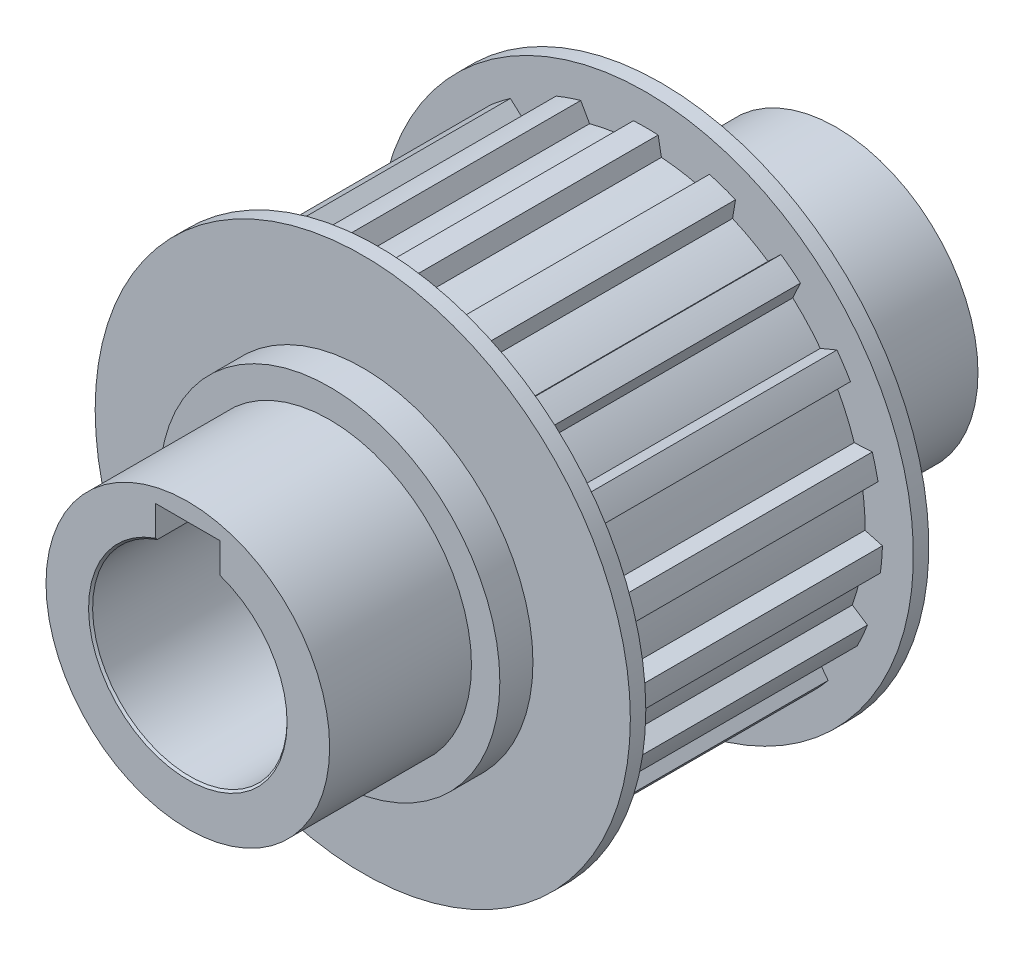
ISO-10303-21;
HEADER;
FILE_DESCRIPTION(('STEP AP214'),'2;1');
FILE_NAME('part.step','',(''),(''),'','','');
FILE_SCHEMA(('AUTOMOTIVE_DESIGN { 1 0 10303 214 1 1 1 1 }'));
ENDSEC;
DATA;
#1=APPLICATION_CONTEXT('core data for automotive mechanical design processes');
#2=APPLICATION_PROTOCOL_DEFINITION('international standard','automotive_design',2000,#1);
#3=PRODUCT_CONTEXT('',#1,'mechanical');
#4=PRODUCT('Part','Part','',(#3));
#5=PRODUCT_RELATED_PRODUCT_CATEGORY('part','',(#4));
#6=PRODUCT_DEFINITION_FORMATION('','',#4);
#7=PRODUCT_DEFINITION_CONTEXT('part definition',#1,'design');
#8=PRODUCT_DEFINITION('design','',#6,#7);
#9=PRODUCT_DEFINITION_SHAPE('','',#8);
#10=(LENGTH_UNIT() NAMED_UNIT(*) SI_UNIT(.MILLI.,.METRE.));
#11=(NAMED_UNIT(*) PLANE_ANGLE_UNIT() SI_UNIT($,.RADIAN.));
#12=(NAMED_UNIT(*) SI_UNIT($,.STERADIAN.) SOLID_ANGLE_UNIT());
#13=UNCERTAINTY_MEASURE_WITH_UNIT(LENGTH_MEASURE(1.E-05),#10,'distance_accuracy_value','');
#14=(GEOMETRIC_REPRESENTATION_CONTEXT(3) GLOBAL_UNCERTAINTY_ASSIGNED_CONTEXT((#13)) GLOBAL_UNIT_ASSIGNED_CONTEXT((#10,
#11,#12)) REPRESENTATION_CONTEXT('',''));
#15=CARTESIAN_POINT('',(0.,0.,0.));
#16=DIRECTION('',(0.,0.,1.));
#17=DIRECTION('',(1.,0.,0.));
#18=AXIS2_PLACEMENT_3D('',#15,#16,#17);
#19=CARTESIAN_POINT('',(0.,0.,0.));
#20=DIRECTION('',(0.,0.,1.));
#21=DIRECTION('',(1.,0.,0.));
#22=AXIS2_PLACEMENT_3D('',#19,#20,#21);
#23=CYLINDRICAL_SURFACE('',#22,29.21);
#24=CARTESIAN_POINT('',(0.,0.,-16.51));
#25=DIRECTION('',(0.,0.,1.));
#26=DIRECTION('',(1.,0.,0.));
#27=AXIS2_PLACEMENT_3D('',#24,#25,#26);
#28=CIRCLE('',#27,29.21);
#29=CARTESIAN_POINT('',(-1.524,29.1702163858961,-16.51));
#30=VERTEX_POINT('',#29);
#31=CARTESIAN_POINT('',(1.524,29.1702163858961,-16.51));
#32=VERTEX_POINT('',#31);
#33=EDGE_CURVE('E532',#30,#32,#28,.F.);
#34=ORIENTED_EDGE('',*,*,#33,.F.);
#35=DIRECTION('',(0.,0.,1.));
#36=VECTOR('',#35,1.);
#37=CARTESIAN_POINT('',(-1.524,29.1702163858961,0.));
#38=LINE('',#37,#36);
#39=CARTESIAN_POINT('',(-1.524,29.1702163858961,16.51));
#40=VERTEX_POINT('',#39);
#41=EDGE_CURVE('E531',#40,#30,#38,.F.);
#42=ORIENTED_EDGE('',*,*,#41,.F.);
#43=CARTESIAN_POINT('',(0.,0.,16.51));
#44=DIRECTION('',(0.,0.,1.));
#45=DIRECTION('',(1.,0.,0.));
#46=AXIS2_PLACEMENT_3D('',#43,#44,#45);
#47=CIRCLE('',#46,29.21);
#48=CARTESIAN_POINT('',(1.524,29.1702163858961,16.51));
#49=VERTEX_POINT('',#48);
#50=EDGE_CURVE('E19',#49,#40,#47,.T.);
#51=ORIENTED_EDGE('',*,*,#50,.F.);
#52=DIRECTION('',(0.,0.,1.));
#53=VECTOR('',#52,1.);
#54=CARTESIAN_POINT('',(1.524,29.1702163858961,0.));
#55=LINE('',#54,#53);
#56=EDGE_CURVE('E513',#32,#49,#55,.T.);
#57=ORIENTED_EDGE('',*,*,#56,.F.);
#58=EDGE_LOOP('',(#34,#42,#51,#57));
#59=FACE_BOUND('',#58,.T.);
#60=ADVANCED_FACE('F15',(#59),#23,.T.);
#61=CARTESIAN_POINT('',(1.524,29.1702163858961,0.));
#62=DIRECTION('',(0.983423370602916,0.181324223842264,0.));
#63=DIRECTION('',(-0.181324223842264,0.983423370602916,0.));
#64=AXIS2_PLACEMENT_3D('',#61,#62,#63);
#65=PLANE('',#64);
#66=DIRECTION('',(0.181324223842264,-0.983423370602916,0.));
#67=VECTOR('',#66,1.);
#68=CARTESIAN_POINT('',(1.524,29.1702163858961,-16.51));
#69=LINE('',#68,#67);
#70=CARTESIAN_POINT('',(1.92741928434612,26.9822464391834,-16.51));
#71=VERTEX_POINT('',#70);
#72=EDGE_CURVE('E929',#32,#71,#69,.T.);
#73=ORIENTED_EDGE('',*,*,#72,.F.);
#74=ORIENTED_EDGE('',*,*,#56,.T.);
#75=DIRECTION('',(-0.181324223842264,0.983423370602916,0.));
#76=VECTOR('',#75,1.);
#77=CARTESIAN_POINT('',(1.92741928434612,26.9822464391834,16.51));
#78=LINE('',#77,#76);
#79=CARTESIAN_POINT('',(1.92741928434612,26.9822464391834,16.51));
#80=VERTEX_POINT('',#79);
#81=EDGE_CURVE('E527',#80,#49,#78,.T.);
#82=ORIENTED_EDGE('',*,*,#81,.F.);
#83=DIRECTION('',(0.,0.,1.));
#84=VECTOR('',#83,1.);
#85=CARTESIAN_POINT('',(1.92741928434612,26.9822464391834,0.));
#86=LINE('',#85,#84);
#87=EDGE_CURVE('E690',#71,#80,#86,.T.);
#88=ORIENTED_EDGE('',*,*,#87,.F.);
#89=EDGE_LOOP('',(#73,#74,#82,#88));
#90=FACE_BOUND('',#89,.T.);
#91=ADVANCED_FACE('F1941',(#90),#65,.T.);
#92=CARTESIAN_POINT('',(0.,0.,0.));
#93=DIRECTION('',(0.,0.,1.));
#94=DIRECTION('',(1.,0.,0.));
#95=AXIS2_PLACEMENT_3D('',#92,#93,#94);
#96=CYLINDRICAL_SURFACE('',#95,27.0509993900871);
#97=CARTESIAN_POINT('',(0.,0.,-16.51));
#98=DIRECTION('',(0.,0.,1.));
#99=DIRECTION('',(1.,0.,0.));
#100=AXIS2_PLACEMENT_3D('',#97,#98,#99);
#101=CIRCLE('',#100,27.0509993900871);
#102=CARTESIAN_POINT('',(6.93813470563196,26.1461059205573,-16.51));
#103=VERTEX_POINT('',#102);
#104=EDGE_CURVE('E927',#71,#103,#101,.F.);
#105=ORIENTED_EDGE('',*,*,#104,.F.);
#106=ORIENTED_EDGE('',*,*,#87,.T.);
#107=CARTESIAN_POINT('',(0.,0.,16.51));
#108=DIRECTION('',(0.,0.,1.));
#109=DIRECTION('',(1.,0.,0.));
#110=AXIS2_PLACEMENT_3D('',#107,#108,#109);
#111=CIRCLE('',#110,27.0509993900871);
#112=CARTESIAN_POINT('',(6.93813470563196,26.1461059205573,16.51));
#113=VERTEX_POINT('',#112);
#114=EDGE_CURVE('E932',#113,#80,#111,.T.);
#115=ORIENTED_EDGE('',*,*,#114,.F.);
#116=DIRECTION('',(0.,0.,1.));
#117=VECTOR('',#116,1.);
#118=CARTESIAN_POINT('',(6.93813470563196,26.1461059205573,0.));
#119=LINE('',#118,#117);
#120=EDGE_CURVE('E688',#103,#113,#119,.T.);
#121=ORIENTED_EDGE('',*,*,#120,.F.);
#122=EDGE_LOOP('',(#105,#106,#115,#121));
#123=FACE_BOUND('',#122,.T.);
#124=ADVANCED_FACE('F1933',(#123),#96,.T.);
#125=CARTESIAN_POINT('',(6.93813470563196,26.1461059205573,0.));
#126=DIRECTION('',(-0.90877071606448,0.417295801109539,0.));
#127=DIRECTION('',(-0.417295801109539,-0.90877071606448,0.));
#128=AXIS2_PLACEMENT_3D('',#125,#126,#127);
#129=PLANE('',#128);
#130=DIRECTION('',(0.417295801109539,0.90877071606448,0.));
#131=VECTOR('',#130,1.);
#132=CARTESIAN_POINT('',(6.93813470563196,26.1461059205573,-16.51));
#133=LINE('',#132,#131);
#134=CARTESIAN_POINT('',(7.85141826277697,28.1350196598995,-16.51));
#135=VERTEX_POINT('',#134);
#136=EDGE_CURVE('E925',#103,#135,#133,.T.);
#137=ORIENTED_EDGE('',*,*,#136,.F.);
#138=ORIENTED_EDGE('',*,*,#120,.T.);
#139=DIRECTION('',(-0.417295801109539,-0.90877071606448,0.));
#140=VECTOR('',#139,1.);
#141=CARTESIAN_POINT('',(7.85141826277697,28.1350196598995,16.51));
#142=LINE('',#141,#140);
#143=CARTESIAN_POINT('',(7.85141826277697,28.1350196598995,16.51));
#144=VERTEX_POINT('',#143);
#145=EDGE_CURVE('E934',#144,#113,#142,.T.);
#146=ORIENTED_EDGE('',*,*,#145,.F.);
#147=DIRECTION('',(0.,0.,1.));
#148=VECTOR('',#147,1.);
#149=CARTESIAN_POINT('',(7.85141826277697,28.1350196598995,0.));
#150=LINE('',#149,#148);
#151=EDGE_CURVE('E686',#135,#144,#150,.T.);
#152=ORIENTED_EDGE('',*,*,#151,.F.);
#153=EDGE_LOOP('',(#137,#138,#146,#152));
#154=FACE_BOUND('',#153,.T.);
#155=ADVANCED_FACE('F1925',(#154),#129,.T.);
#156=CARTESIAN_POINT('',(0.,0.,0.));
#157=DIRECTION('',(0.,0.,1.));
#158=DIRECTION('',(1.,0.,0.));
#159=AXIS2_PLACEMENT_3D('',#156,#157,#158);
#160=CYLINDRICAL_SURFACE('',#159,29.21);
#161=CARTESIAN_POINT('',(0.,0.,-16.51));
#162=DIRECTION('',(0.,0.,1.));
#163=DIRECTION('',(1.,0.,0.));
#164=AXIS2_PLACEMENT_3D('',#161,#162,#163);
#165=CIRCLE('',#164,29.21);
#166=CARTESIAN_POINT('',(11.0725078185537,27.0300512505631,-16.51));
#167=VERTEX_POINT('',#166);
#168=EDGE_CURVE('E923',#135,#167,#165,.F.);
#169=ORIENTED_EDGE('',*,*,#168,.F.);
#170=ORIENTED_EDGE('',*,*,#151,.T.);
#171=CARTESIAN_POINT('',(0.,0.,16.51));
#172=DIRECTION('',(0.,0.,1.));
#173=DIRECTION('',(1.,0.,0.));
#174=AXIS2_PLACEMENT_3D('',#171,#172,#173);
#175=CIRCLE('',#174,29.21);
#176=CARTESIAN_POINT('',(11.0725078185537,27.0300512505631,16.51));
#177=VERTEX_POINT('',#176);
#178=EDGE_CURVE('E935',#177,#144,#175,.T.);
#179=ORIENTED_EDGE('',*,*,#178,.F.);
#180=DIRECTION('',(0.,0.,1.));
#181=VECTOR('',#180,1.);
#182=CARTESIAN_POINT('',(11.0725078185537,27.0300512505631,0.));
#183=LINE('',#182,#181);
#184=EDGE_CURVE('E684',#167,#177,#183,.T.);
#185=ORIENTED_EDGE('',*,*,#184,.F.);
#186=EDGE_LOOP('',(#169,#170,#179,#185));
#187=FACE_BOUND('',#186,.T.);
#188=ADVANCED_FACE('F1917',(#187),#160,.T.);
#189=CARTESIAN_POINT('',(11.0725078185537,27.0300512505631,0.));
#190=DIRECTION('',(0.986361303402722,-0.164594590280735,0.));
#191=DIRECTION('',(0.164594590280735,0.986361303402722,0.));
#192=AXIS2_PLACEMENT_3D('',#189,#190,#191);
#193=PLANE('',#192);
#194=DIRECTION('',(-0.164594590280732,-0.986361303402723,0.));
#195=VECTOR('',#194,1.);
#196=CARTESIAN_POINT('',(11.0725078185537,27.0300512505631,-16.51));
#197=LINE('',#196,#195);
#198=CARTESIAN_POINT('',(10.7073348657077,24.8416897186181,-16.51));
#199=VERTEX_POINT('',#198);
#200=EDGE_CURVE('E921',#167,#199,#197,.T.);
#201=ORIENTED_EDGE('',*,*,#200,.F.);
#202=ORIENTED_EDGE('',*,*,#184,.T.);
#203=DIRECTION('',(0.164594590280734,0.986361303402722,0.));
#204=VECTOR('',#203,1.);
#205=CARTESIAN_POINT('',(10.7073348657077,24.8416897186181,16.51));
#206=LINE('',#205,#204);
#207=CARTESIAN_POINT('',(10.7073348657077,24.8416897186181,16.51));
#208=VERTEX_POINT('',#207);
#209=EDGE_CURVE('E938',#208,#177,#206,.T.);
#210=ORIENTED_EDGE('',*,*,#209,.F.);
#211=DIRECTION('',(0.,0.,1.));
#212=VECTOR('',#211,1.);
#213=CARTESIAN_POINT('',(10.7073348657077,24.8416897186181,0.));
#214=LINE('',#213,#212);
#215=EDGE_CURVE('E682',#199,#208,#214,.T.);
#216=ORIENTED_EDGE('',*,*,#215,.F.);
#217=EDGE_LOOP('',(#201,#202,#210,#216));
#218=FACE_BOUND('',#217,.T.);
#219=ADVANCED_FACE('F1909',(#218),#193,.T.);
#220=CARTESIAN_POINT('',(0.,0.,0.));
#221=DIRECTION('',(0.,0.,1.));
#222=DIRECTION('',(1.,0.,0.));
#223=AXIS2_PLACEMENT_3D('',#220,#221,#222);
#224=CYLINDRICAL_SURFACE('',#223,27.0509993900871);
#225=CARTESIAN_POINT('',(0.,0.,-16.51));
#226=DIRECTION('',(0.,0.,1.));
#227=DIRECTION('',(1.,0.,0.));
#228=AXIS2_PLACEMENT_3D('',#225,#226,#227);
#229=CIRCLE('',#228,27.0509993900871);
#230=CARTESIAN_POINT('',(15.0844039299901,22.4547840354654,-16.51));
#231=VERTEX_POINT('',#230);
#232=EDGE_CURVE('E919',#199,#231,#229,.F.);
#233=ORIENTED_EDGE('',*,*,#232,.F.);
#234=ORIENTED_EDGE('',*,*,#215,.T.);
#235=CARTESIAN_POINT('',(0.,0.,16.51));
#236=DIRECTION('',(0.,0.,1.));
#237=DIRECTION('',(1.,0.,0.));
#238=AXIS2_PLACEMENT_3D('',#235,#236,#237);
#239=CIRCLE('',#238,27.0509993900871);
#240=CARTESIAN_POINT('',(15.0844039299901,22.4547840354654,16.51));
#241=VERTEX_POINT('',#240);
#242=EDGE_CURVE('E939',#241,#208,#239,.T.);
#243=ORIENTED_EDGE('',*,*,#242,.F.);
#244=DIRECTION('',(0.,0.,1.));
#245=VECTOR('',#244,1.);
#246=CARTESIAN_POINT('',(15.0844039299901,22.4547840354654,0.));
#247=LINE('',#246,#245);
#248=EDGE_CURVE('E680',#231,#241,#247,.T.);
#249=ORIENTED_EDGE('',*,*,#248,.F.);
#250=EDGE_LOOP('',(#233,#234,#243,#249));
#251=FACE_BOUND('',#250,.T.);
#252=ADVANCED_FACE('F1901',(#251),#224,.T.);
#253=CARTESIAN_POINT('',(15.0844039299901,22.4547840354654,0.));
#254=DIRECTION('',(-0.689624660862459,0.724166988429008,0.));
#255=DIRECTION('',(-0.724166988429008,-0.689624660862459,0.));
#256=AXIS2_PLACEMENT_3D('',#253,#254,#255);
#257=PLANE('',#256);
#258=DIRECTION('',(0.724166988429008,0.689624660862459,0.));
#259=VECTOR('',#258,1.);
#260=CARTESIAN_POINT('',(15.0844039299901,22.4547840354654,-16.51));
#261=LINE('',#260,#259);
#262=CARTESIAN_POINT('',(16.6829866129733,23.9771152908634,-16.51));
#263=VERTEX_POINT('',#262);
#264=EDGE_CURVE('E917',#231,#263,#261,.T.);
#265=ORIENTED_EDGE('',*,*,#264,.F.);
#266=ORIENTED_EDGE('',*,*,#248,.T.);
#267=DIRECTION('',(-0.724166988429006,-0.68962466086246,0.));
#268=VECTOR('',#267,1.);
#269=CARTESIAN_POINT('',(16.6829866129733,23.9771152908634,16.51));
#270=LINE('',#269,#268);
#271=CARTESIAN_POINT('',(16.6829866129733,23.9771152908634,16.51));
#272=VERTEX_POINT('',#271);
#273=EDGE_CURVE('E942',#272,#241,#270,.T.);
#274=ORIENTED_EDGE('',*,*,#273,.F.);
#275=DIRECTION('',(0.,0.,1.));
#276=VECTOR('',#275,1.);
#277=CARTESIAN_POINT('',(16.6829866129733,23.9771152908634,0.));
#278=LINE('',#277,#276);
#279=EDGE_CURVE('E678',#263,#272,#278,.T.);
#280=ORIENTED_EDGE('',*,*,#279,.F.);
#281=EDGE_LOOP('',(#265,#266,#274,#280));
#282=FACE_BOUND('',#281,.T.);
#283=ADVANCED_FACE('F1893',(#282),#257,.T.);
#284=CARTESIAN_POINT('',(0.,0.,0.));
#285=DIRECTION('',(0.,0.,1.));
#286=DIRECTION('',(1.,0.,0.));
#287=AXIS2_PLACEMENT_3D('',#284,#285,#286);
#288=CYLINDRICAL_SURFACE('',#287,29.21);
#289=CARTESIAN_POINT('',(0.,0.,-16.51));
#290=DIRECTION('',(0.,0.,1.));
#291=DIRECTION('',(1.,0.,0.));
#292=AXIS2_PLACEMENT_3D('',#289,#290,#291);
#293=CIRCLE('',#292,29.21);
#294=CARTESIAN_POINT('',(19.07738962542,22.1196135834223,-16.51));
#295=VERTEX_POINT('',#294);
#296=EDGE_CURVE('E915',#263,#295,#293,.F.);
#297=ORIENTED_EDGE('',*,*,#296,.F.);
#298=ORIENTED_EDGE('',*,*,#279,.T.);
#299=CARTESIAN_POINT('',(0.,0.,16.51));
#300=DIRECTION('',(0.,0.,1.));
#301=DIRECTION('',(1.,0.,0.));
#302=AXIS2_PLACEMENT_3D('',#299,#300,#301);
#303=CIRCLE('',#302,29.21);
#304=CARTESIAN_POINT('',(19.07738962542,22.1196135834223,16.51));
#305=VERTEX_POINT('',#304);
#306=EDGE_CURVE('E943',#305,#272,#303,.T.);
#307=ORIENTED_EDGE('',*,*,#306,.F.);
#308=DIRECTION('',(0.,0.,1.));
#309=VECTOR('',#308,1.);
#310=CARTESIAN_POINT('',(19.07738962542,22.1196135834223,0.));
#311=LINE('',#310,#309);
#312=EDGE_CURVE('E676',#295,#305,#311,.T.);
#313=ORIENTED_EDGE('',*,*,#312,.F.);
#314=EDGE_LOOP('',(#297,#298,#307,#313));
#315=FACE_BOUND('',#314,.T.);
#316=ADVANCED_FACE('F1885',(#315),#288,.T.);
#317=CARTESIAN_POINT('',(19.07738962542,22.1196135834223,0.));
#318=DIRECTION('',(0.908770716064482,-0.417295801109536,0.));
#319=DIRECTION('',(0.417295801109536,0.908770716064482,0.));
#320=AXIS2_PLACEMENT_3D('',#317,#318,#319);
#321=PLANE('',#320);
#322=DIRECTION('',(-0.417295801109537,-0.908770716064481,0.));
#323=VECTOR('',#322,1.);
#324=CARTESIAN_POINT('',(19.07738962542,22.1196135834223,-16.51));
#325=LINE('',#324,#323);
#326=CARTESIAN_POINT('',(18.1364655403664,20.0705053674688,-16.51));
#327=VERTEX_POINT('',#326);
#328=EDGE_CURVE('E913',#295,#327,#325,.T.);
#329=ORIENTED_EDGE('',*,*,#328,.F.);
#330=ORIENTED_EDGE('',*,*,#312,.T.);
#331=DIRECTION('',(0.417295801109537,0.908770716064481,0.));
#332=VECTOR('',#331,1.);
#333=CARTESIAN_POINT('',(18.1364655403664,20.0705053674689,16.51));
#334=LINE('',#333,#332);
#335=CARTESIAN_POINT('',(18.1364655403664,20.0705053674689,16.51));
#336=VERTEX_POINT('',#335);
#337=EDGE_CURVE('E946',#336,#305,#334,.T.);
#338=ORIENTED_EDGE('',*,*,#337,.F.);
#339=DIRECTION('',(0.,0.,1.));
#340=VECTOR('',#339,1.);
#341=CARTESIAN_POINT('',(18.1364655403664,20.0705053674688,0.));
#342=LINE('',#341,#340);
#343=EDGE_CURVE('E674',#327,#336,#342,.T.);
#344=ORIENTED_EDGE('',*,*,#343,.F.);
#345=EDGE_LOOP('',(#329,#330,#338,#344));
#346=FACE_BOUND('',#345,.T.);
#347=ADVANCED_FACE('F1877',(#346),#321,.T.);
#348=CARTESIAN_POINT('',(0.,0.,0.));
#349=DIRECTION('',(0.,0.,1.));
#350=DIRECTION('',(1.,0.,0.));
#351=AXIS2_PLACEMENT_3D('',#348,#349,#350);
#352=CYLINDRICAL_SURFACE('',#351,27.0509993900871);
#353=CARTESIAN_POINT('',(0.,0.,-16.51));
#354=DIRECTION('',(0.,0.,1.));
#355=DIRECTION('',(1.,0.,0.));
#356=AXIS2_PLACEMENT_3D('',#353,#354,#355);
#357=CIRCLE('',#356,27.0509993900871);
#358=CARTESIAN_POINT('',(21.5344337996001,16.3714608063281,-16.51));
#359=VERTEX_POINT('',#358);
#360=EDGE_CURVE('E911',#327,#359,#357,.F.);
#361=ORIENTED_EDGE('',*,*,#360,.F.);
#362=ORIENTED_EDGE('',*,*,#343,.T.);
#363=CARTESIAN_POINT('',(0.,0.,16.51));
#364=DIRECTION('',(0.,0.,1.));
#365=DIRECTION('',(1.,0.,0.));
#366=AXIS2_PLACEMENT_3D('',#363,#364,#365);
#367=CIRCLE('',#366,27.0509993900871);
#368=CARTESIAN_POINT('',(21.5344337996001,16.3714608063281,16.51));
#369=VERTEX_POINT('',#368);
#370=EDGE_CURVE('E947',#369,#336,#367,.T.);
#371=ORIENTED_EDGE('',*,*,#370,.F.);
#372=DIRECTION('',(0.,0.,1.));
#373=VECTOR('',#372,1.);
#374=CARTESIAN_POINT('',(21.5344337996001,16.3714608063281,0.));
#375=LINE('',#374,#373);
#376=EDGE_CURVE('E672',#359,#369,#375,.T.);
#377=ORIENTED_EDGE('',*,*,#376,.F.);
#378=EDGE_LOOP('',(#361,#362,#371,#377));
#379=FACE_BOUND('',#378,.T.);
#380=ADVANCED_FACE('F1869',(#379),#352,.T.);
#381=CARTESIAN_POINT('',(21.5344337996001,16.3714608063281,0.));
#382=DIRECTION('',(-0.3860830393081,0.922464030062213,0.));
#383=DIRECTION('',(-0.922464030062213,-0.3860830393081,0.));
#384=AXIS2_PLACEMENT_3D('',#381,#382,#383);
#385=PLANE('',#384);
#386=DIRECTION('',(0.922464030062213,0.386083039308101,0.));
#387=VECTOR('',#386,1.);
#388=CARTESIAN_POINT('',(21.5344337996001,16.3714608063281,-16.51));
#389=LINE('',#388,#387);
#390=CARTESIAN_POINT('',(23.5867783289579,17.2304378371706,-16.51));
#391=VERTEX_POINT('',#390);
#392=EDGE_CURVE('E909',#359,#391,#389,.T.);
#393=ORIENTED_EDGE('',*,*,#392,.F.);
#394=ORIENTED_EDGE('',*,*,#376,.T.);
#395=DIRECTION('',(-0.922464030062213,-0.3860830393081,0.));
#396=VECTOR('',#395,1.);
#397=CARTESIAN_POINT('',(23.586778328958,17.2304378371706,16.51));
#398=LINE('',#397,#396);
#399=CARTESIAN_POINT('',(23.5867783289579,17.2304378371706,16.51));
#400=VERTEX_POINT('',#399);
#401=EDGE_CURVE('E950',#400,#369,#398,.T.);
#402=ORIENTED_EDGE('',*,*,#401,.F.);
#403=DIRECTION('',(0.,0.,1.));
#404=VECTOR('',#403,1.);
#405=CARTESIAN_POINT('',(23.5867783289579,17.2304378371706,0.));
#406=LINE('',#405,#404);
#407=EDGE_CURVE('E670',#391,#400,#406,.T.);
#408=ORIENTED_EDGE('',*,*,#407,.F.);
#409=EDGE_LOOP('',(#393,#394,#402,#408));
#410=FACE_BOUND('',#409,.T.);
#411=ADVANCED_FACE('F1861',(#410),#385,.T.);
#412=CARTESIAN_POINT('',(0.,0.,0.));
#413=DIRECTION('',(0.,0.,1.));
#414=DIRECTION('',(1.,0.,0.));
#415=AXIS2_PLACEMENT_3D('',#412,#413,#414);
#416=CYLINDRICAL_SURFACE('',#415,29.21);
#417=CARTESIAN_POINT('',(0.,0.,-16.51));
#418=DIRECTION('',(0.,0.,1.));
#419=DIRECTION('',(1.,0.,0.));
#420=AXIS2_PLACEMENT_3D('',#417,#418,#419);
#421=CIRCLE('',#420,29.21);
#422=CARTESIAN_POINT('',(25.2542665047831,14.6780830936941,-16.51));
#423=VERTEX_POINT('',#422);
#424=EDGE_CURVE('E907',#391,#423,#421,.F.);
#425=ORIENTED_EDGE('',*,*,#424,.F.);
#426=ORIENTED_EDGE('',*,*,#407,.T.);
#427=CARTESIAN_POINT('',(0.,0.,16.51));
#428=DIRECTION('',(0.,0.,1.));
#429=DIRECTION('',(1.,0.,0.));
#430=AXIS2_PLACEMENT_3D('',#427,#428,#429);
#431=CIRCLE('',#430,29.21);
#432=CARTESIAN_POINT('',(25.2542665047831,14.6780830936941,16.51));
#433=VERTEX_POINT('',#432);
#434=EDGE_CURVE('E951',#433,#400,#431,.T.);
#435=ORIENTED_EDGE('',*,*,#434,.F.);
#436=DIRECTION('',(0.,0.,1.));
#437=VECTOR('',#436,1.);
#438=CARTESIAN_POINT('',(25.2542665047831,14.6780830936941,0.));
#439=LINE('',#438,#437);
#440=EDGE_CURVE('E668',#423,#433,#439,.T.);
#441=ORIENTED_EDGE('',*,*,#440,.F.);
#442=EDGE_LOOP('',(#425,#426,#435,#441));
#443=FACE_BOUND('',#442,.T.);
#444=ADVANCED_FACE('F1853',(#443),#416,.T.);
#445=CARTESIAN_POINT('',(25.2542665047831,14.6780830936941,0.));
#446=DIRECTION('',(0.689624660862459,-0.724166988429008,0.));
#447=DIRECTION('',(0.724166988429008,0.689624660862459,0.));
#448=AXIS2_PLACEMENT_3D('',#445,#446,#447);
#449=PLANE('',#448);
#450=DIRECTION('',(-0.724166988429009,-0.689624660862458,0.));
#451=VECTOR('',#450,1.);
#452=CARTESIAN_POINT('',(25.2542665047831,14.6780830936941,-16.51));
#453=LINE('',#452,#451);
#454=CARTESIAN_POINT('',(23.6431241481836,13.1437912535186,-16.51));
#455=VERTEX_POINT('',#454);
#456=EDGE_CURVE('E905',#423,#455,#453,.T.);
#457=ORIENTED_EDGE('',*,*,#456,.F.);
#458=ORIENTED_EDGE('',*,*,#440,.T.);
#459=DIRECTION('',(0.724166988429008,0.689624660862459,0.));
#460=VECTOR('',#459,1.);
#461=CARTESIAN_POINT('',(23.6431241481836,13.1437912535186,16.51));
#462=LINE('',#461,#460);
#463=CARTESIAN_POINT('',(23.6431241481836,13.1437912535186,16.51));
#464=VERTEX_POINT('',#463);
#465=EDGE_CURVE('E954',#464,#433,#462,.T.);
#466=ORIENTED_EDGE('',*,*,#465,.F.);
#467=DIRECTION('',(0.,0.,1.));
#468=VECTOR('',#467,1.);
#469=CARTESIAN_POINT('',(23.6431241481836,13.1437912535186,0.));
#470=LINE('',#469,#468);
#471=EDGE_CURVE('E666',#455,#464,#470,.T.);
#472=ORIENTED_EDGE('',*,*,#471,.F.);
#473=EDGE_LOOP('',(#457,#458,#466,#472));
#474=FACE_BOUND('',#473,.T.);
#475=ADVANCED_FACE('F1845',(#474),#449,.T.);
#476=CARTESIAN_POINT('',(0.,0.,0.));
#477=DIRECTION('',(0.,0.,1.));
#478=DIRECTION('',(1.,0.,0.));
#479=AXIS2_PLACEMENT_3D('',#476,#477,#478);
#480=CYLINDRICAL_SURFACE('',#479,27.0509993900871);
#481=CARTESIAN_POINT('',(0.,0.,-16.51));
#482=DIRECTION('',(0.,0.,1.));
#483=DIRECTION('',(1.,0.,0.));
#484=AXIS2_PLACEMENT_3D('',#481,#482,#483);
#485=CIRCLE('',#484,27.0509993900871);
#486=CARTESIAN_POINT('',(25.7165817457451,8.39130450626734,-16.51));
#487=VERTEX_POINT('',#486);
#488=EDGE_CURVE('E903',#455,#487,#485,.F.);
#489=ORIENTED_EDGE('',*,*,#488,.F.);
#490=ORIENTED_EDGE('',*,*,#471,.T.);
#491=CARTESIAN_POINT('',(0.,0.,16.51));
#492=DIRECTION('',(0.,0.,1.));
#493=DIRECTION('',(1.,0.,0.));
#494=AXIS2_PLACEMENT_3D('',#491,#492,#493);
#495=CIRCLE('',#494,27.0509993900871);
#496=CARTESIAN_POINT('',(25.7165817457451,8.39130450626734,16.51));
#497=VERTEX_POINT('',#496);
#498=EDGE_CURVE('E955',#497,#464,#495,.T.);
#499=ORIENTED_EDGE('',*,*,#498,.F.);
#500=DIRECTION('',(0.,0.,1.));
#501=VECTOR('',#500,1.);
#502=CARTESIAN_POINT('',(25.7165817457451,8.39130450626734,0.));
#503=LINE('',#502,#501);
#504=EDGE_CURVE('E664',#487,#497,#503,.T.);
#505=ORIENTED_EDGE('',*,*,#504,.F.);
#506=EDGE_LOOP('',(#489,#490,#499,#505));
#507=FACE_BOUND('',#506,.T.);
#508=ADVANCED_FACE('F1837',(#507),#480,.T.);
#509=CARTESIAN_POINT('',(25.7165817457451,8.39130450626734,0.));
#510=DIRECTION('',(-0.052173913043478,0.998638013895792,0.));
#511=DIRECTION('',(-0.998638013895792,-0.052173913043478,0.));
#512=AXIS2_PLACEMENT_3D('',#509,#510,#511);
#513=PLANE('',#512);
#514=DIRECTION('',(0.998638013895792,0.0521739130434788,0.));
#515=VECTOR('',#514,1.);
#516=CARTESIAN_POINT('',(25.7165817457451,8.39130450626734,-16.51));
#517=LINE('',#516,#515);
#518=CARTESIAN_POINT('',(27.9435845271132,8.50765442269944,-16.51));
#519=VERTEX_POINT('',#518);
#520=EDGE_CURVE('E901',#487,#519,#517,.T.);
#521=ORIENTED_EDGE('',*,*,#520,.F.);
#522=ORIENTED_EDGE('',*,*,#504,.T.);
#523=DIRECTION('',(-0.998638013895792,-0.0521739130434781,0.));
#524=VECTOR('',#523,1.);
#525=CARTESIAN_POINT('',(27.9435845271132,8.50765442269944,16.51));
#526=LINE('',#525,#524);
#527=CARTESIAN_POINT('',(27.9435845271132,8.50765442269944,16.51));
#528=VERTEX_POINT('',#527);
#529=EDGE_CURVE('E958',#528,#497,#526,.T.);
#530=ORIENTED_EDGE('',*,*,#529,.F.);
#531=DIRECTION('',(0.,0.,1.));
#532=VECTOR('',#531,1.);
#533=CARTESIAN_POINT('',(27.9435845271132,8.50765442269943,0.));
#534=LINE('',#533,#532);
#535=EDGE_CURVE('E662',#519,#528,#534,.T.);
#536=ORIENTED_EDGE('',*,*,#535,.F.);
#537=EDGE_LOOP('',(#521,#522,#530,#536));
#538=FACE_BOUND('',#537,.T.);
#539=ADVANCED_FACE('F1829',(#538),#513,.T.);
#540=CARTESIAN_POINT('',(0.,0.,0.));
#541=DIRECTION('',(0.,0.,1.));
#542=DIRECTION('',(1.,0.,0.));
#543=AXIS2_PLACEMENT_3D('',#540,#541,#542);
#544=CYLINDRICAL_SURFACE('',#543,29.21);
#545=CARTESIAN_POINT('',(0.,0.,-16.51));
#546=DIRECTION('',(0.,0.,1.));
#547=DIRECTION('',(1.,0.,0.));
#548=AXIS2_PLACEMENT_3D('',#545,#546,#547);
#549=CIRCLE('',#548,29.21);
#550=CARTESIAN_POINT('',(28.651735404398,5.68349877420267,-16.51));
#551=VERTEX_POINT('',#550);
#552=EDGE_CURVE('E899',#519,#551,#549,.F.);
#553=ORIENTED_EDGE('',*,*,#552,.F.);
#554=ORIENTED_EDGE('',*,*,#535,.T.);
#555=CARTESIAN_POINT('',(0.,0.,16.51));
#556=DIRECTION('',(0.,0.,1.));
#557=DIRECTION('',(1.,0.,0.));
#558=AXIS2_PLACEMENT_3D('',#555,#556,#557);
#559=CIRCLE('',#558,29.21);
#560=CARTESIAN_POINT('',(28.651735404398,5.68349877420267,16.51));
#561=VERTEX_POINT('',#560);
#562=EDGE_CURVE('E959',#561,#528,#559,.T.);
#563=ORIENTED_EDGE('',*,*,#562,.F.);
#564=DIRECTION('',(0.,0.,1.));
#565=VECTOR('',#564,1.);
#566=CARTESIAN_POINT('',(28.6517354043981,5.68349877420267,0.));
#567=LINE('',#566,#565);
#568=EDGE_CURVE('E660',#551,#561,#567,.T.);
#569=ORIENTED_EDGE('',*,*,#568,.F.);
#570=EDGE_LOOP('',(#553,#554,#563,#569));
#571=FACE_BOUND('',#570,.T.);
#572=ADVANCED_FACE('F1821',(#571),#544,.T.);
#573=CARTESIAN_POINT('',(28.6517354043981,5.68349877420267,0.));
#574=DIRECTION('',(0.417191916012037,-0.908818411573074,0.));
#575=DIRECTION('',(0.908818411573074,0.417191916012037,0.));
#576=AXIS2_PLACEMENT_3D('',#573,#574,#575);
#577=PLANE('',#576);
#578=DIRECTION('',(-0.908818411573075,-0.417191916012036,0.));
#579=VECTOR('',#578,1.);
#580=CARTESIAN_POINT('',(28.6517354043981,5.68349877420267,-16.51));
#581=LINE('',#580,#579);
#582=CARTESIAN_POINT('',(26.6297503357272,4.7553091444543,-16.51));
#583=VERTEX_POINT('',#582);
#584=EDGE_CURVE('E897',#551,#583,#581,.T.);
#585=ORIENTED_EDGE('',*,*,#584,.F.);
#586=ORIENTED_EDGE('',*,*,#568,.T.);
#587=DIRECTION('',(0.908818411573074,0.417191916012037,0.));
#588=VECTOR('',#587,1.);
#589=CARTESIAN_POINT('',(26.6297503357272,4.7553091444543,16.51));
#590=LINE('',#589,#588);
#591=CARTESIAN_POINT('',(26.6297503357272,4.7553091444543,16.51));
#592=VERTEX_POINT('',#591);
#593=EDGE_CURVE('E962',#592,#561,#590,.T.);
#594=ORIENTED_EDGE('',*,*,#593,.F.);
#595=DIRECTION('',(0.,0.,1.));
#596=VECTOR('',#595,1.);
#597=CARTESIAN_POINT('',(26.6297503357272,4.7553091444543,0.));
#598=LINE('',#597,#596);
#599=EDGE_CURVE('E658',#583,#592,#598,.T.);
#600=ORIENTED_EDGE('',*,*,#599,.F.);
#601=EDGE_LOOP('',(#585,#586,#594,#600));
#602=FACE_BOUND('',#601,.T.);
#603=ADVANCED_FACE('F1813',(#602),#577,.T.);
#604=CARTESIAN_POINT('',(0.,0.,0.));
#605=DIRECTION('',(0.,0.,1.));
#606=DIRECTION('',(1.,0.,0.));
#607=AXIS2_PLACEMENT_3D('',#604,#605,#606);
#608=CYLINDRICAL_SURFACE('',#607,27.0509993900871);
#609=CARTESIAN_POINT('',(0.,0.,-16.51));
#610=DIRECTION('',(0.,0.,1.));
#611=DIRECTION('',(1.,0.,0.));
#612=AXIS2_PLACEMENT_3D('',#609,#610,#611);
#613=CIRCLE('',#612,27.0509993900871);
#614=CARTESIAN_POINT('',(27.0492602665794,-0.306736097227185,-16.51));
#615=VERTEX_POINT('',#614);
#616=EDGE_CURVE('E895',#583,#615,#613,.F.);
#617=ORIENTED_EDGE('',*,*,#616,.F.);
#618=ORIENTED_EDGE('',*,*,#599,.T.);
#619=CARTESIAN_POINT('',(0.,0.,16.51));
#620=DIRECTION('',(0.,0.,1.));
#621=DIRECTION('',(1.,0.,0.));
#622=AXIS2_PLACEMENT_3D('',#619,#620,#621);
#623=CIRCLE('',#622,27.0509993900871);
#624=CARTESIAN_POINT('',(27.0492602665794,-0.306736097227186,16.51));
#625=VERTEX_POINT('',#624);
#626=EDGE_CURVE('E963',#625,#592,#623,.T.);
#627=ORIENTED_EDGE('',*,*,#626,.F.);
#628=DIRECTION('',(0.,0.,1.));
#629=VECTOR('',#628,1.);
#630=CARTESIAN_POINT('',(27.0492602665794,-0.306736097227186,0.));
#631=LINE('',#630,#629);
#632=EDGE_CURVE('E656',#615,#625,#631,.T.);
#633=ORIENTED_EDGE('',*,*,#632,.F.);
#634=EDGE_LOOP('',(#617,#618,#627,#633));
#635=FACE_BOUND('',#634,.T.);
#636=ADVANCED_FACE('F1805',(#635),#608,.T.);
#637=CARTESIAN_POINT('',(27.0492602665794,-0.306736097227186,0.));
#638=DIRECTION('',(0.261841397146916,0.965110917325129,0.));
#639=DIRECTION('',(-0.965110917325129,0.261841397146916,0.));
#640=AXIS2_PLACEMENT_3D('',#637,#638,#639);
#641=PLANE('',#640);
#642=DIRECTION('',(0.965110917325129,-0.261841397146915,0.));
#643=VECTOR('',#642,1.);
#644=CARTESIAN_POINT('',(27.0492602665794,-0.306736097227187,-16.51));
#645=LINE('',#644,#643);
#646=CARTESIAN_POINT('',(29.1964598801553,-0.889286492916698,-16.51));
#647=VERTEX_POINT('',#646);
#648=EDGE_CURVE('E893',#615,#647,#645,.T.);
#649=ORIENTED_EDGE('',*,*,#648,.F.);
#650=ORIENTED_EDGE('',*,*,#632,.T.);
#651=DIRECTION('',(-0.965110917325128,0.261841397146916,0.));
#652=VECTOR('',#651,1.);
#653=CARTESIAN_POINT('',(29.1964598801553,-0.889286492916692,16.51));
#654=LINE('',#653,#652);
#655=CARTESIAN_POINT('',(29.1964598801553,-0.889286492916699,16.51));
#656=VERTEX_POINT('',#655);
#657=EDGE_CURVE('E966',#656,#625,#654,.T.);
#658=ORIENTED_EDGE('',*,*,#657,.F.);
#659=DIRECTION('',(0.,0.,1.));
#660=VECTOR('',#659,1.);
#661=CARTESIAN_POINT('',(29.1964598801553,-0.889286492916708,0.));
#662=LINE('',#661,#660);
#663=EDGE_CURVE('E654',#647,#656,#662,.T.);
#664=ORIENTED_EDGE('',*,*,#663,.F.);
#665=EDGE_LOOP('',(#649,#650,#658,#664));
#666=FACE_BOUND('',#665,.T.);
#667=ADVANCED_FACE('F1797',(#666),#641,.T.);
#668=CARTESIAN_POINT('',(0.,0.,0.));
#669=DIRECTION('',(0.,0.,1.));
#670=DIRECTION('',(1.,0.,0.));
#671=AXIS2_PLACEMENT_3D('',#668,#669,#670);
#672=CYLINDRICAL_SURFACE('',#671,29.21);
#673=CARTESIAN_POINT('',(0.,0.,-16.51));
#674=DIRECTION('',(0.,0.,1.));
#675=DIRECTION('',(1.,0.,0.));
#676=AXIS2_PLACEMENT_3D('',#673,#674,#675);
#677=CIRCLE('',#676,29.21);
#678=CARTESIAN_POINT('',(28.9447343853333,-3.92765214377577,-16.51));
#679=VERTEX_POINT('',#678);
#680=EDGE_CURVE('E891',#647,#679,#677,.F.);
#681=ORIENTED_EDGE('',*,*,#680,.F.);
#682=ORIENTED_EDGE('',*,*,#663,.T.);
#683=CARTESIAN_POINT('',(0.,0.,16.51));
#684=DIRECTION('',(0.,0.,1.));
#685=DIRECTION('',(1.,0.,0.));
#686=AXIS2_PLACEMENT_3D('',#683,#684,#685);
#687=CIRCLE('',#686,29.21);
#688=CARTESIAN_POINT('',(28.9447343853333,-3.92765214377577,16.51));
#689=VERTEX_POINT('',#688);
#690=EDGE_CURVE('E967',#689,#656,#687,.T.);
#691=ORIENTED_EDGE('',*,*,#690,.F.);
#692=DIRECTION('',(0.,0.,1.));
#693=VECTOR('',#692,1.);
#694=CARTESIAN_POINT('',(28.9447343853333,-3.92765214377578,0.));
#695=LINE('',#694,#693);
#696=EDGE_CURVE('E652',#679,#689,#695,.T.);
#697=ORIENTED_EDGE('',*,*,#696,.F.);
#698=EDGE_LOOP('',(#681,#682,#691,#697));
#699=FACE_BOUND('',#698,.T.);
#700=ADVANCED_FACE('F1789',(#699),#672,.T.);
#701=CARTESIAN_POINT('',(28.9447343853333,-3.92765214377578,0.));
#702=DIRECTION('',(0.071251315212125,-0.997458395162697,0.));
#703=DIRECTION('',(0.997458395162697,0.071251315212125,0.));
#704=AXIS2_PLACEMENT_3D('',#701,#702,#703);
#705=PLANE('',#704);
#706=DIRECTION('',(-0.997458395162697,-0.0712513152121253,0.));
#707=VECTOR('',#706,1.);
#708=CARTESIAN_POINT('',(28.9447343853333,-3.92765214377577,-16.51));
#709=LINE('',#708,#707);
#710=CARTESIAN_POINT('',(26.7407671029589,-4.08508785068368,-16.51));
#711=VERTEX_POINT('',#710);
#712=EDGE_CURVE('E889',#679,#711,#709,.T.);
#713=ORIENTED_EDGE('',*,*,#712,.F.);
#714=ORIENTED_EDGE('',*,*,#696,.T.);
#715=DIRECTION('',(0.997458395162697,0.0712513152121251,0.));
#716=VECTOR('',#715,1.);
#717=CARTESIAN_POINT('',(26.7407671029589,-4.08508785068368,16.51));
#718=LINE('',#717,#716);
#719=CARTESIAN_POINT('',(26.7407671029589,-4.08508785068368,16.51));
#720=VERTEX_POINT('',#719);
#721=EDGE_CURVE('E970',#720,#689,#718,.T.);
#722=ORIENTED_EDGE('',*,*,#721,.F.);
#723=DIRECTION('',(0.,0.,1.));
#724=VECTOR('',#723,1.);
#725=CARTESIAN_POINT('',(26.7407671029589,-4.08508785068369,0.));
#726=LINE('',#725,#724);
#727=EDGE_CURVE('E650',#711,#720,#726,.T.);
#728=ORIENTED_EDGE('',*,*,#727,.F.);
#729=EDGE_LOOP('',(#713,#714,#722,#728));
#730=FACE_BOUND('',#729,.T.);
#731=ADVANCED_FACE('F1781',(#730),#705,.T.);
#732=CARTESIAN_POINT('',(0.,0.,0.));
#733=DIRECTION('',(0.,0.,1.));
#734=DIRECTION('',(1.,0.,0.));
#735=AXIS2_PLACEMENT_3D('',#732,#733,#734);
#736=CYLINDRICAL_SURFACE('',#735,27.0509993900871);
#737=CARTESIAN_POINT('',(0.,0.,-16.51));
#738=DIRECTION('',(0.,0.,1.));
#739=DIRECTION('',(1.,0.,0.));
#740=AXIS2_PLACEMENT_3D('',#737,#738,#739);
#741=CIRCLE('',#740,27.0509993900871);
#742=CARTESIAN_POINT('',(25.4838570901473,-9.0735657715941,-16.51));
#743=VERTEX_POINT('',#742);
#744=EDGE_CURVE('E887',#711,#743,#741,.F.);
#745=ORIENTED_EDGE('',*,*,#744,.F.);
#746=ORIENTED_EDGE('',*,*,#727,.T.);
#747=CARTESIAN_POINT('',(0.,0.,16.51));
#748=DIRECTION('',(0.,0.,1.));
#749=DIRECTION('',(1.,0.,0.));
#750=AXIS2_PLACEMENT_3D('',#747,#748,#749);
#751=CIRCLE('',#750,27.0509993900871);
#752=CARTESIAN_POINT('',(25.4838570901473,-9.0735657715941,16.51));
#753=VERTEX_POINT('',#752);
#754=EDGE_CURVE('E971',#753,#720,#751,.T.);
#755=ORIENTED_EDGE('',*,*,#754,.F.);
#756=DIRECTION('',(0.,0.,1.));
#757=VECTOR('',#756,1.);
#758=CARTESIAN_POINT('',(25.4838570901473,-9.0735657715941,0.));
#759=LINE('',#758,#757);
#760=EDGE_CURVE('E648',#743,#753,#759,.T.);
#761=ORIENTED_EDGE('',*,*,#760,.F.);
#762=EDGE_LOOP('',(#745,#746,#755,#761));
#763=FACE_BOUND('',#762,.T.);
#764=ADVANCED_FACE('F1773',(#763),#736,.T.);
#765=CARTESIAN_POINT('',(25.4838570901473,-9.0735657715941,0.));
#766=DIRECTION('',(0.547252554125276,0.836967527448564,0.));
#767=DIRECTION('',(-0.836967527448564,0.547252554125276,0.));
#768=AXIS2_PLACEMENT_3D('',#765,#766,#767);
#769=PLANE('',#768);
#770=DIRECTION('',(0.836967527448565,-0.547252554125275,0.));
#771=VECTOR('',#770,1.);
#772=CARTESIAN_POINT('',(25.4838570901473,-9.0735657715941,-16.51));
#773=LINE('',#772,#771);
#774=CARTESIAN_POINT('',(27.3388530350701,-10.2864578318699,-16.51));
#775=VERTEX_POINT('',#774);
#776=EDGE_CURVE('E885',#743,#775,#773,.T.);
#777=ORIENTED_EDGE('',*,*,#776,.F.);
#778=ORIENTED_EDGE('',*,*,#760,.T.);
#779=DIRECTION('',(-0.836967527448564,0.547252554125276,0.));
#780=VECTOR('',#779,1.);
#781=CARTESIAN_POINT('',(27.3388530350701,-10.2864578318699,16.51));
#782=LINE('',#781,#780);
#783=CARTESIAN_POINT('',(27.3388530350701,-10.2864578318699,16.51));
#784=VERTEX_POINT('',#783);
#785=EDGE_CURVE('E974',#784,#753,#782,.T.);
#786=ORIENTED_EDGE('',*,*,#785,.F.);
#787=DIRECTION('',(0.,0.,1.));
#788=VECTOR('',#787,1.);
#789=CARTESIAN_POINT('',(27.3388530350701,-10.2864578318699,0.));
#790=LINE('',#789,#788);
#791=EDGE_CURVE('E646',#775,#784,#790,.T.);
#792=ORIENTED_EDGE('',*,*,#791,.F.);
#793=EDGE_LOOP('',(#777,#778,#786,#792));
#794=FACE_BOUND('',#793,.T.);
#795=ADVANCED_FACE('F1765',(#794),#769,.T.);
#796=CARTESIAN_POINT('',(0.,0.,0.));
#797=DIRECTION('',(0.,0.,1.));
#798=DIRECTION('',(1.,0.,0.));
#799=AXIS2_PLACEMENT_3D('',#796,#797,#798);
#800=CYLINDRICAL_SURFACE('',#799,29.21);
#801=CARTESIAN_POINT('',(0.,0.,-16.51));
#802=DIRECTION('',(0.,0.,1.));
#803=DIRECTION('',(1.,0.,0.));
#804=AXIS2_PLACEMENT_3D('',#801,#802,#803);
#805=CIRCLE('',#804,29.21);
#806=CARTESIAN_POINT('',(26.084094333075,-13.1470195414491,-16.51));
#807=VERTEX_POINT('',#806);
#808=EDGE_CURVE('E883',#775,#807,#805,.F.);
#809=ORIENTED_EDGE('',*,*,#808,.F.);
#810=ORIENTED_EDGE('',*,*,#791,.T.);
#811=CARTESIAN_POINT('',(0.,0.,16.51));
#812=DIRECTION('',(0.,0.,1.));
#813=DIRECTION('',(1.,0.,0.));
#814=AXIS2_PLACEMENT_3D('',#811,#812,#813);
#815=CIRCLE('',#814,29.21);
#816=CARTESIAN_POINT('',(26.084094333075,-13.1470195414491,16.51));
#817=VERTEX_POINT('',#816);
#818=EDGE_CURVE('E975',#817,#784,#815,.T.);
#819=ORIENTED_EDGE('',*,*,#818,.F.);
#820=DIRECTION('',(0.,0.,1.));
#821=VECTOR('',#820,1.);
#822=CARTESIAN_POINT('',(26.084094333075,-13.1470195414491,0.));
#823=LINE('',#822,#821);
#824=EDGE_CURVE('E644',#807,#817,#823,.T.);
#825=ORIENTED_EDGE('',*,*,#824,.F.);
#826=EDGE_LOOP('',(#809,#810,#819,#825));
#827=FACE_BOUND('',#826,.T.);
#828=ADVANCED_FACE('F1757',(#827),#800,.T.);
#829=CARTESIAN_POINT('',(26.084094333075,-13.1470195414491,0.));
#830=DIRECTION('',(-0.261841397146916,-0.965110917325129,0.));
#831=DIRECTION('',(0.965110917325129,-0.261841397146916,0.));
#832=AXIS2_PLACEMENT_3D('',#829,#830,#831);
#833=PLANE('',#832);
#834=DIRECTION('',(-0.965110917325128,0.261841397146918,0.));
#835=VECTOR('',#834,1.);
#836=CARTESIAN_POINT('',(26.084094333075,-13.1470195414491,-16.51));
#837=LINE('',#836,#835);
#838=CARTESIAN_POINT('',(23.9536332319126,-12.5690104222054,-16.51));
#839=VERTEX_POINT('',#838);
#840=EDGE_CURVE('E881',#807,#839,#837,.T.);
#841=ORIENTED_EDGE('',*,*,#840,.F.);
#842=ORIENTED_EDGE('',*,*,#824,.T.);
#843=DIRECTION('',(0.965110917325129,-0.261841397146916,0.));
#844=VECTOR('',#843,1.);
#845=CARTESIAN_POINT('',(23.9536332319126,-12.5690104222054,16.51));
#846=LINE('',#845,#844);
#847=CARTESIAN_POINT('',(23.9536332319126,-12.5690104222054,16.51));
#848=VERTEX_POINT('',#847);
#849=EDGE_CURVE('E978',#848,#817,#846,.T.);
#850=ORIENTED_EDGE('',*,*,#849,.F.);
#851=DIRECTION('',(0.,0.,1.));
#852=VECTOR('',#851,1.);
#853=CARTESIAN_POINT('',(23.9536332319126,-12.5690104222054,0.));
#854=LINE('',#853,#852);
#855=EDGE_CURVE('E642',#839,#848,#854,.T.);
#856=ORIENTED_EDGE('',*,*,#855,.F.);
#857=EDGE_LOOP('',(#841,#842,#850,#856));
#858=FACE_BOUND('',#857,.T.);
#859=ADVANCED_FACE('F1749',(#858),#833,.T.);
#860=CARTESIAN_POINT('',(0.,0.,0.));
#861=DIRECTION('',(0.,0.,1.));
#862=DIRECTION('',(1.,0.,0.));
#863=AXIS2_PLACEMENT_3D('',#860,#861,#862);
#864=CYLINDRICAL_SURFACE('',#863,27.0509993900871);
#865=CARTESIAN_POINT('',(0.,0.,-16.51));
#866=DIRECTION('',(0.,0.,1.));
#867=DIRECTION('',(1.,0.,0.));
#868=AXIS2_PLACEMENT_3D('',#865,#866,#867);
#869=CIRCLE('',#868,27.0509993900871);
#870=CARTESIAN_POINT('',(21.1568894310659,-16.8565298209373,-16.51));
#871=VERTEX_POINT('',#870);
#872=EDGE_CURVE('E879',#839,#871,#869,.F.);
#873=ORIENTED_EDGE('',*,*,#872,.F.);
#874=ORIENTED_EDGE('',*,*,#855,.T.);
#875=CARTESIAN_POINT('',(0.,0.,16.51));
#876=DIRECTION('',(0.,0.,1.));
#877=DIRECTION('',(1.,0.,0.));
#878=AXIS2_PLACEMENT_3D('',#875,#876,#877);
#879=CIRCLE('',#878,27.0509993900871);
#880=CARTESIAN_POINT('',(21.1568894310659,-16.8565298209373,16.51));
#881=VERTEX_POINT('',#880);
#882=EDGE_CURVE('E979',#881,#848,#879,.T.);
#883=ORIENTED_EDGE('',*,*,#882,.F.);
#884=DIRECTION('',(0.,0.,1.));
#885=VECTOR('',#884,1.);
#886=CARTESIAN_POINT('',(21.1568894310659,-16.8565298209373,0.));
#887=LINE('',#886,#885);
#888=EDGE_CURVE('E640',#871,#881,#887,.T.);
#889=ORIENTED_EDGE('',*,*,#888,.F.);
#890=EDGE_LOOP('',(#873,#874,#883,#889));
#891=FACE_BOUND('',#890,.T.);
#892=ADVANCED_FACE('F1741',(#891),#864,.T.);
#893=CARTESIAN_POINT('',(21.1568894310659,-16.8565298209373,0.));
#894=DIRECTION('',(0.799459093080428,0.600720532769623,0.));
#895=DIRECTION('',(-0.600720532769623,0.799459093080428,0.));
#896=AXIS2_PLACEMENT_3D('',#893,#894,#895);
#897=PLANE('',#896);
#898=DIRECTION('',(0.600720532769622,-0.799459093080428,0.));
#899=VECTOR('',#898,1.);
#900=CARTESIAN_POINT('',(21.1568894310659,-16.8565298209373,-16.51));
#901=LINE('',#900,#899);
#902=CARTESIAN_POINT('',(22.4934027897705,-18.6352067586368,-16.51));
#903=VERTEX_POINT('',#902);
#904=EDGE_CURVE('E877',#871,#903,#901,.T.);
#905=ORIENTED_EDGE('',*,*,#904,.F.);
#906=ORIENTED_EDGE('',*,*,#888,.T.);
#907=DIRECTION('',(-0.600720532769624,0.799459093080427,0.));
#908=VECTOR('',#907,1.);
#909=CARTESIAN_POINT('',(22.4934027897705,-18.6352067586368,16.51));
#910=LINE('',#909,#908);
#911=CARTESIAN_POINT('',(22.4934027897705,-18.6352067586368,16.51));
#912=VERTEX_POINT('',#911);
#913=EDGE_CURVE('E982',#912,#881,#910,.T.);
#914=ORIENTED_EDGE('',*,*,#913,.F.);
#915=DIRECTION('',(0.,0.,1.));
#916=VECTOR('',#915,1.);
#917=CARTESIAN_POINT('',(22.4934027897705,-18.6352067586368,0.));
#918=LINE('',#917,#916);
#919=EDGE_CURVE('E638',#903,#912,#918,.T.);
#920=ORIENTED_EDGE('',*,*,#919,.F.);
#921=EDGE_LOOP('',(#905,#906,#914,#920));
#922=FACE_BOUND('',#921,.T.);
#923=ADVANCED_FACE('F1733',(#922),#897,.T.);
#924=CARTESIAN_POINT('',(0.,0.,0.));
#925=DIRECTION('',(0.,0.,1.));
#926=DIRECTION('',(1.,0.,0.));
#927=AXIS2_PLACEMENT_3D('',#924,#925,#926);
#928=CYLINDRICAL_SURFACE('',#927,29.21);
#929=CARTESIAN_POINT('',(0.,0.,-16.51));
#930=DIRECTION('',(0.,0.,1.));
#931=DIRECTION('',(1.,0.,0.));
#932=AXIS2_PLACEMENT_3D('',#929,#930,#931);
#933=CIRCLE('',#932,29.21);
#934=CARTESIAN_POINT('',(20.4290485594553,-20.8776932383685,-16.51));
#935=VERTEX_POINT('',#934);
#936=EDGE_CURVE('E875',#903,#935,#933,.F.);
#937=ORIENTED_EDGE('',*,*,#936,.F.);
#938=ORIENTED_EDGE('',*,*,#919,.T.);
#939=CARTESIAN_POINT('',(0.,0.,16.51));
#940=DIRECTION('',(0.,0.,1.));
#941=DIRECTION('',(1.,0.,0.));
#942=AXIS2_PLACEMENT_3D('',#939,#940,#941);
#943=CIRCLE('',#942,29.21);
#944=CARTESIAN_POINT('',(20.4290485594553,-20.8776932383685,16.51));
#945=VERTEX_POINT('',#944);
#946=EDGE_CURVE('E983',#945,#912,#943,.T.);
#947=ORIENTED_EDGE('',*,*,#946,.F.);
#948=DIRECTION('',(0.,0.,1.));
#949=VECTOR('',#948,1.);
#950=CARTESIAN_POINT('',(20.4290485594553,-20.8776932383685,0.));
#951=LINE('',#950,#949);
#952=EDGE_CURVE('E636',#935,#945,#951,.T.);
#953=ORIENTED_EDGE('',*,*,#952,.F.);
#954=EDGE_LOOP('',(#937,#938,#947,#953));
#955=FACE_BOUND('',#954,.T.);
#956=ADVANCED_FACE('F1725',(#955),#928,.T.);
#957=CARTESIAN_POINT('',(20.4290485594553,-20.8776932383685,0.));
#958=DIRECTION('',(-0.532649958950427,-0.846335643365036,0.));
#959=DIRECTION('',(0.846335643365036,-0.532649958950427,0.));
#960=AXIS2_PLACEMENT_3D('',#957,#958,#959);
#961=PLANE('',#960);
#962=DIRECTION('',(-0.846335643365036,0.532649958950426,0.));
#963=VECTOR('',#962,1.);
#964=CARTESIAN_POINT('',(20.4290485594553,-20.8776932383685,-16.51));
#965=LINE('',#964,#963);
#966=CARTESIAN_POINT('',(18.5460783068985,-19.6926267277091,-16.51));
#967=VERTEX_POINT('',#966);
#968=EDGE_CURVE('E873',#935,#967,#965,.T.);
#969=ORIENTED_EDGE('',*,*,#968,.F.);
#970=ORIENTED_EDGE('',*,*,#952,.T.);
#971=DIRECTION('',(0.846335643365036,-0.532649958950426,0.));
#972=VECTOR('',#971,1.);
#973=CARTESIAN_POINT('',(18.5460783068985,-19.6926267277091,16.51));
#974=LINE('',#973,#972);
#975=CARTESIAN_POINT('',(18.5460783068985,-19.6926267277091,16.51));
#976=VERTEX_POINT('',#975);
#977=EDGE_CURVE('E986',#976,#945,#974,.T.);
#978=ORIENTED_EDGE('',*,*,#977,.F.);
#979=DIRECTION('',(0.,0.,1.));
#980=VECTOR('',#979,1.);
#981=CARTESIAN_POINT('',(18.5460783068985,-19.6926267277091,0.));
#982=LINE('',#981,#980);
#983=EDGE_CURVE('E634',#967,#976,#982,.T.);
#984=ORIENTED_EDGE('',*,*,#983,.F.);
#985=EDGE_LOOP('',(#969,#970,#978,#984));
#986=FACE_BOUND('',#985,.T.);
#987=ADVANCED_FACE('F1717',(#986),#961,.T.);
#988=CARTESIAN_POINT('',(0.,0.,0.));
#989=DIRECTION('',(0.,0.,1.));
#990=DIRECTION('',(1.,0.,0.));
#991=AXIS2_PLACEMENT_3D('',#988,#989,#990);
#992=CYLINDRICAL_SURFACE('',#991,27.0509993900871);
#993=CARTESIAN_POINT('',(0.,0.,-16.51));
#994=DIRECTION('',(0.,0.,1.));
#995=DIRECTION('',(1.,0.,0.));
#996=AXIS2_PLACEMENT_3D('',#993,#994,#995);
#997=CIRCLE('',#996,27.0509993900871);
#998=CARTESIAN_POINT('',(14.5372445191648,-22.8128273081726,-16.51));
#999=VERTEX_POINT('',#998);
#1000=EDGE_CURVE('E871',#967,#999,#997,.F.);
#1001=ORIENTED_EDGE('',*,*,#1000,.F.);
#1002=ORIENTED_EDGE('',*,*,#983,.T.);
#1003=CARTESIAN_POINT('',(0.,0.,16.51));
#1004=DIRECTION('',(0.,0.,1.));
#1005=DIRECTION('',(1.,0.,0.));
#1006=AXIS2_PLACEMENT_3D('',#1003,#1004,#1005);
#1007=CIRCLE('',#1006,27.0509993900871);
#1008=CARTESIAN_POINT('',(14.5372445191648,-22.8128273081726,16.51));
#1009=VERTEX_POINT('',#1008);
#1010=EDGE_CURVE('E987',#1009,#976,#1007,.T.);
#1011=ORIENTED_EDGE('',*,*,#1010,.F.);
#1012=DIRECTION('',(0.,0.,1.));
#1013=VECTOR('',#1012,1.);
#1014=CARTESIAN_POINT('',(14.5372445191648,-22.8128273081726,0.));
#1015=LINE('',#1014,#1013);
#1016=EDGE_CURVE('E632',#999,#1009,#1015,.T.);
#1017=ORIENTED_EDGE('',*,*,#1016,.F.);
#1018=EDGE_LOOP('',(#1001,#1002,#1011,#1017));
#1019=FACE_BOUND('',#1018,.T.);
#1020=ADVANCED_FACE('F1709',(#1019),#992,.T.);
#1021=CARTESIAN_POINT('',(14.5372445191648,-22.8128273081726,0.));
#1022=DIRECTION('',(0.951195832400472,0.308587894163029,0.));
#1023=DIRECTION('',(-0.308587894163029,0.951195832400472,0.));
#1024=AXIS2_PLACEMENT_3D('',#1021,#1022,#1023);
#1025=PLANE('',#1024);
#1026=DIRECTION('',(0.308587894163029,-0.951195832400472,0.));
#1027=VECTOR('',#1026,1.);
#1028=CARTESIAN_POINT('',(14.5372445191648,-22.8128273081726,-16.51));
#1029=LINE('',#1028,#1027);
#1030=CARTESIAN_POINT('',(15.2238064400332,-24.9290958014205,-16.51));
#1031=VERTEX_POINT('',#1030);
#1032=EDGE_CURVE('E869',#999,#1031,#1029,.T.);
#1033=ORIENTED_EDGE('',*,*,#1032,.F.);
#1034=ORIENTED_EDGE('',*,*,#1016,.T.);
#1035=DIRECTION('',(-0.30858789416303,0.951195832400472,0.));
#1036=VECTOR('',#1035,1.);
#1037=CARTESIAN_POINT('',(15.2238064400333,-24.9290958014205,16.51));
#1038=LINE('',#1037,#1036);
#1039=CARTESIAN_POINT('',(15.2238064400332,-24.9290958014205,16.51));
#1040=VERTEX_POINT('',#1039);
#1041=EDGE_CURVE('E990',#1040,#1009,#1038,.T.);
#1042=ORIENTED_EDGE('',*,*,#1041,.F.);
#1043=DIRECTION('',(0.,0.,1.));
#1044=VECTOR('',#1043,1.);
#1045=CARTESIAN_POINT('',(15.2238064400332,-24.9290958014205,0.));
#1046=LINE('',#1045,#1044);
#1047=EDGE_CURVE('E630',#1031,#1040,#1046,.T.);
#1048=ORIENTED_EDGE('',*,*,#1047,.F.);
#1049=EDGE_LOOP('',(#1033,#1034,#1042,#1048));
#1050=FACE_BOUND('',#1049,.T.);
#1051=ADVANCED_FACE('F1701',(#1050),#1025,.T.);
#1052=CARTESIAN_POINT('',(0.,0.,0.));
#1053=DIRECTION('',(0.,0.,1.));
#1054=DIRECTION('',(1.,0.,0.));
#1055=AXIS2_PLACEMENT_3D('',#1052,#1053,#1054);
#1056=CYLINDRICAL_SURFACE('',#1055,29.21);
#1057=CARTESIAN_POINT('',(0.,0.,-16.51));
#1058=DIRECTION('',(0.,0.,1.));
#1059=DIRECTION('',(1.,0.,0.));
#1060=AXIS2_PLACEMENT_3D('',#1057,#1058,#1059);
#1061=CIRCLE('',#1060,29.21);
#1062=CARTESIAN_POINT('',(12.5431704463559,-26.3797834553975,-16.51));
#1063=VERTEX_POINT('',#1062);
#1064=EDGE_CURVE('E867',#1031,#1063,#1061,.F.);
#1065=ORIENTED_EDGE('',*,*,#1064,.F.);
#1066=ORIENTED_EDGE('',*,*,#1047,.T.);
#1067=CARTESIAN_POINT('',(0.,0.,16.51));
#1068=DIRECTION('',(0.,0.,1.));
#1069=DIRECTION('',(1.,0.,0.));
#1070=AXIS2_PLACEMENT_3D('',#1067,#1068,#1069);
#1071=CIRCLE('',#1070,29.21);
#1072=CARTESIAN_POINT('',(12.5431704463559,-26.3797834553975,16.51));
#1073=VERTEX_POINT('',#1072);
#1074=EDGE_CURVE('E991',#1073,#1040,#1071,.T.);
#1075=ORIENTED_EDGE('',*,*,#1074,.F.);
#1076=DIRECTION('',(0.,0.,1.));
#1077=VECTOR('',#1076,1.);
#1078=CARTESIAN_POINT('',(12.5431704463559,-26.3797834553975,0.));
#1079=LINE('',#1078,#1077);
#1080=EDGE_CURVE('E628',#1063,#1073,#1079,.T.);
#1081=ORIENTED_EDGE('',*,*,#1080,.F.);
#1082=EDGE_LOOP('',(#1065,#1066,#1075,#1081));
#1083=FACE_BOUND('',#1082,.T.);
#1084=ADVANCED_FACE('F1693',(#1083),#1056,.T.);
#1085=CARTESIAN_POINT('',(12.5431704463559,-26.3797834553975,0.));
#1086=DIRECTION('',(-0.77859424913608,-0.62752768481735,0.));
#1087=DIRECTION('',(0.62752768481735,-0.77859424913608,0.));
#1088=AXIS2_PLACEMENT_3D('',#1085,#1086,#1087);
#1089=PLANE('',#1088);
#1090=DIRECTION('',(-0.627527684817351,0.77859424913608,0.));
#1091=VECTOR('',#1090,1.);
#1092=CARTESIAN_POINT('',(12.5431704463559,-26.3797834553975,-16.51));
#1093=LINE('',#1092,#1091);
#1094=CARTESIAN_POINT('',(11.1470151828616,-24.6475276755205,-16.51));
#1095=VERTEX_POINT('',#1094);
#1096=EDGE_CURVE('E865',#1063,#1095,#1093,.T.);
#1097=ORIENTED_EDGE('',*,*,#1096,.F.);
#1098=ORIENTED_EDGE('',*,*,#1080,.T.);
#1099=DIRECTION('',(0.62752768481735,-0.77859424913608,0.));
#1100=VECTOR('',#1099,1.);
#1101=CARTESIAN_POINT('',(11.1470151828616,-24.6475276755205,16.51));
#1102=LINE('',#1101,#1100);
#1103=CARTESIAN_POINT('',(11.1470151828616,-24.6475276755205,16.51));
#1104=VERTEX_POINT('',#1103);
#1105=EDGE_CURVE('E994',#1104,#1073,#1102,.T.);
#1106=ORIENTED_EDGE('',*,*,#1105,.F.);
#1107=DIRECTION('',(0.,0.,1.));
#1108=VECTOR('',#1107,1.);
#1109=CARTESIAN_POINT('',(11.1470151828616,-24.6475276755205,0.));
#1110=LINE('',#1109,#1108);
#1111=EDGE_CURVE('E626',#1095,#1104,#1110,.T.);
#1112=ORIENTED_EDGE('',*,*,#1111,.F.);
#1113=EDGE_LOOP('',(#1097,#1098,#1106,#1112));
#1114=FACE_BOUND('',#1113,.T.);
#1115=ADVANCED_FACE('F1685',(#1114),#1089,.T.);
#1116=CARTESIAN_POINT('',(0.,0.,0.));
#1117=DIRECTION('',(0.,0.,1.));
#1118=DIRECTION('',(1.,0.,0.));
#1119=AXIS2_PLACEMENT_3D('',#1116,#1117,#1118);
#1120=CYLINDRICAL_SURFACE('',#1119,27.0509993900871);
#1121=CARTESIAN_POINT('',(0.,0.,-16.51));
#1122=DIRECTION('',(0.,0.,1.));
#1123=DIRECTION('',(1.,0.,0.));
#1124=AXIS2_PLACEMENT_3D('',#1121,#1122,#1123);
#1125=CIRCLE('',#1124,27.0509993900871);
#1126=CARTESIAN_POINT('',(6.34226359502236,-26.2970009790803,-16.51));
#1127=VERTEX_POINT('',#1126);
#1128=EDGE_CURVE('E863',#1095,#1127,#1125,.F.);
#1129=ORIENTED_EDGE('',*,*,#1128,.F.);
#1130=ORIENTED_EDGE('',*,*,#1111,.T.);
#1131=CARTESIAN_POINT('',(0.,0.,16.51));
#1132=DIRECTION('',(0.,0.,1.));
#1133=DIRECTION('',(1.,0.,0.));
#1134=AXIS2_PLACEMENT_3D('',#1131,#1132,#1133);
#1135=CIRCLE('',#1134,27.0509993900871);
#1136=CARTESIAN_POINT('',(6.34226359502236,-26.2970009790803,16.51));
#1137=VERTEX_POINT('',#1136);
#1138=EDGE_CURVE('E995',#1137,#1104,#1135,.T.);
#1139=ORIENTED_EDGE('',*,*,#1138,.F.);
#1140=DIRECTION('',(0.,0.,1.));
#1141=VECTOR('',#1140,1.);
#1142=CARTESIAN_POINT('',(6.34226359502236,-26.2970009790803,0.));
#1143=LINE('',#1142,#1141);
#1144=EDGE_CURVE('E624',#1127,#1137,#1143,.T.);
#1145=ORIENTED_EDGE('',*,*,#1144,.F.);
#1146=EDGE_LOOP('',(#1129,#1130,#1139,#1145));
#1147=FACE_BOUND('',#1146,.T.);
#1148=ADVANCED_FACE('F1677',(#1147),#1120,.T.);
#1149=CARTESIAN_POINT('',(6.34226359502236,-26.2970009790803,0.));
#1150=DIRECTION('',(0.99985574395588,-0.016985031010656,0.));
#1151=DIRECTION('',(0.016985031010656,0.99985574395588,0.));
#1152=AXIS2_PLACEMENT_3D('',#1149,#1150,#1151);
#1153=PLANE('',#1152);
#1154=DIRECTION('',(-0.0169850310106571,-0.99985574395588,0.));
#1155=VECTOR('',#1154,1.);
#1156=CARTESIAN_POINT('',(6.34226359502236,-26.2970009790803,-16.51));
#1157=LINE('',#1156,#1155);
#1158=CARTESIAN_POINT('',(6.30447444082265,-28.5215304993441,-16.51));
#1159=VERTEX_POINT('',#1158);
#1160=EDGE_CURVE('E861',#1127,#1159,#1157,.T.);
#1161=ORIENTED_EDGE('',*,*,#1160,.F.);
#1162=ORIENTED_EDGE('',*,*,#1144,.T.);
#1163=DIRECTION('',(0.0169850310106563,0.99985574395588,0.));
#1164=VECTOR('',#1163,1.);
#1165=CARTESIAN_POINT('',(6.30447444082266,-28.5215304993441,16.51));
#1166=LINE('',#1165,#1164);
#1167=CARTESIAN_POINT('',(6.30447444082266,-28.5215304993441,16.51));
#1168=VERTEX_POINT('',#1167);
#1169=EDGE_CURVE('E998',#1168,#1137,#1166,.T.);
#1170=ORIENTED_EDGE('',*,*,#1169,.F.);
#1171=DIRECTION('',(0.,0.,1.));
#1172=VECTOR('',#1171,1.);
#1173=CARTESIAN_POINT('',(6.30447444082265,-28.5215304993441,0.));
#1174=LINE('',#1173,#1172);
#1175=EDGE_CURVE('E622',#1159,#1168,#1174,.T.);
#1176=ORIENTED_EDGE('',*,*,#1175,.F.);
#1177=EDGE_LOOP('',(#1161,#1162,#1170,#1176));
#1178=FACE_BOUND('',#1177,.T.);
#1179=ADVANCED_FACE('F1669',(#1178),#1153,.T.);
#1180=CARTESIAN_POINT('',(0.,0.,0.));
#1181=DIRECTION('',(0.,0.,1.));
#1182=DIRECTION('',(1.,0.,0.));
#1183=AXIS2_PLACEMENT_3D('',#1180,#1181,#1182);
#1184=CYLINDRICAL_SURFACE('',#1183,29.21);
#1185=CARTESIAN_POINT('',(0.,0.,-16.51));
#1186=DIRECTION('',(0.,0.,1.));
#1187=DIRECTION('',(1.,0.,0.));
#1188=AXIS2_PLACEMENT_3D('',#1185,#1186,#1187);
#1189=CIRCLE('',#1188,29.21);
#1190=CARTESIAN_POINT('',(3.29804518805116,-29.0232148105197,-16.51));
#1191=VERTEX_POINT('',#1190);
#1192=EDGE_CURVE('E859',#1159,#1191,#1189,.F.);
#1193=ORIENTED_EDGE('',*,*,#1192,.F.);
#1194=ORIENTED_EDGE('',*,*,#1175,.T.);
#1195=CARTESIAN_POINT('',(0.,0.,16.51));
#1196=DIRECTION('',(0.,0.,1.));
#1197=DIRECTION('',(1.,0.,0.));
#1198=AXIS2_PLACEMENT_3D('',#1195,#1196,#1197);
#1199=CIRCLE('',#1198,29.21);
#1200=CARTESIAN_POINT('',(3.29804518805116,-29.0232148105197,16.51));
#1201=VERTEX_POINT('',#1200);
#1202=EDGE_CURVE('E999',#1201,#1168,#1199,.T.);
#1203=ORIENTED_EDGE('',*,*,#1202,.F.);
#1204=DIRECTION('',(0.,0.,1.));
#1205=VECTOR('',#1204,1.);
#1206=CARTESIAN_POINT('',(3.29804518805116,-29.0232148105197,0.));
#1207=LINE('',#1206,#1205);
#1208=EDGE_CURVE('E620',#1191,#1201,#1207,.T.);
#1209=ORIENTED_EDGE('',*,*,#1208,.F.);
#1210=EDGE_LOOP('',(#1193,#1194,#1203,#1209));
#1211=FACE_BOUND('',#1210,.T.);
#1212=ADVANCED_FACE('F1661',(#1211),#1184,.T.);
#1213=CARTESIAN_POINT('',(3.29804518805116,-29.0232148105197,0.));
#1214=DIRECTION('',(-0.940165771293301,-0.340717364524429,0.));
#1215=DIRECTION('',(0.340717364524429,-0.940165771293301,0.));
#1216=AXIS2_PLACEMENT_3D('',#1213,#1214,#1215);
#1217=PLANE('',#1216);
#1218=DIRECTION('',(-0.340717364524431,0.9401657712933,0.));
#1219=VECTOR('',#1218,1.);
#1220=CARTESIAN_POINT('',(3.29804518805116,-29.0232148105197,-16.51));
#1221=LINE('',#1220,#1219);
#1222=CARTESIAN_POINT('',(2.53999999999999,-26.9314865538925,-16.51));
#1223=VERTEX_POINT('',#1222);
#1224=EDGE_CURVE('E857',#1191,#1223,#1221,.T.);
#1225=ORIENTED_EDGE('',*,*,#1224,.F.);
#1226=ORIENTED_EDGE('',*,*,#1208,.T.);
#1227=DIRECTION('',(0.340717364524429,-0.940165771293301,0.));
#1228=VECTOR('',#1227,1.);
#1229=CARTESIAN_POINT('',(2.54,-26.9314865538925,16.51));
#1230=LINE('',#1229,#1228);
#1231=CARTESIAN_POINT('',(2.53999999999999,-26.9314865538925,16.51));
#1232=VERTEX_POINT('',#1231);
#1233=EDGE_CURVE('E1002',#1232,#1201,#1230,.T.);
#1234=ORIENTED_EDGE('',*,*,#1233,.F.);
#1235=DIRECTION('',(0.,0.,1.));
#1236=VECTOR('',#1235,1.);
#1237=CARTESIAN_POINT('',(2.53999999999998,-26.9314865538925,0.));
#1238=LINE('',#1237,#1236);
#1239=EDGE_CURVE('E618',#1223,#1232,#1238,.T.);
#1240=ORIENTED_EDGE('',*,*,#1239,.F.);
#1241=EDGE_LOOP('',(#1225,#1226,#1234,#1240));
#1242=FACE_BOUND('',#1241,.T.);
#1243=ADVANCED_FACE('F1653',(#1242),#1217,.T.);
#1244=CARTESIAN_POINT('',(0.,0.,0.));
#1245=DIRECTION('',(0.,0.,1.));
#1246=DIRECTION('',(1.,0.,0.));
#1247=AXIS2_PLACEMENT_3D('',#1244,#1245,#1246);
#1248=CYLINDRICAL_SURFACE('',#1247,27.0509993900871);
#1249=CARTESIAN_POINT('',(0.,0.,-16.51));
#1250=DIRECTION('',(0.,0.,1.));
#1251=DIRECTION('',(1.,0.,0.));
#1252=AXIS2_PLACEMENT_3D('',#1249,#1250,#1251);
#1253=CIRCLE('',#1252,27.0509993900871);
#1254=CARTESIAN_POINT('',(-2.54000000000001,-26.9314865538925,-16.51));
#1255=VERTEX_POINT('',#1254);
#1256=EDGE_CURVE('E855',#1223,#1255,#1253,.F.);
#1257=ORIENTED_EDGE('',*,*,#1256,.F.);
#1258=ORIENTED_EDGE('',*,*,#1239,.T.);
#1259=CARTESIAN_POINT('',(0.,0.,16.51));
#1260=DIRECTION('',(0.,0.,1.));
#1261=DIRECTION('',(1.,0.,0.));
#1262=AXIS2_PLACEMENT_3D('',#1259,#1260,#1261);
#1263=CIRCLE('',#1262,27.0509993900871);
#1264=CARTESIAN_POINT('',(-2.54000000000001,-26.9314865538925,16.51));
#1265=VERTEX_POINT('',#1264);
#1266=EDGE_CURVE('E1003',#1265,#1232,#1263,.T.);
#1267=ORIENTED_EDGE('',*,*,#1266,.F.);
#1268=DIRECTION('',(0.,0.,1.));
#1269=VECTOR('',#1268,1.);
#1270=CARTESIAN_POINT('',(-2.54000000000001,-26.9314865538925,0.));
#1271=LINE('',#1270,#1269);
#1272=EDGE_CURVE('E616',#1255,#1265,#1271,.T.);
#1273=ORIENTED_EDGE('',*,*,#1272,.F.);
#1274=EDGE_LOOP('',(#1257,#1258,#1267,#1273));
#1275=FACE_BOUND('',#1274,.T.);
#1276=ADVANCED_FACE('F1645',(#1275),#1248,.T.);
#1277=CARTESIAN_POINT('',(-2.54000000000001,-26.9314865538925,0.));
#1278=DIRECTION('',(0.940165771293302,-0.340717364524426,0.));
#1279=DIRECTION('',(0.340717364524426,0.940165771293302,0.));
#1280=AXIS2_PLACEMENT_3D('',#1277,#1278,#1279);
#1281=PLANE('',#1280);
#1282=DIRECTION('',(-0.340717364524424,-0.940165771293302,0.));
#1283=VECTOR('',#1282,1.);
#1284=CARTESIAN_POINT('',(-2.54000000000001,-26.9314865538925,-16.51));
#1285=LINE('',#1284,#1283);
#1286=CARTESIAN_POINT('',(-3.29804518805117,-29.0232148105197,-16.51));
#1287=VERTEX_POINT('',#1286);
#1288=EDGE_CURVE('E853',#1255,#1287,#1285,.T.);
#1289=ORIENTED_EDGE('',*,*,#1288,.F.);
#1290=ORIENTED_EDGE('',*,*,#1272,.T.);
#1291=DIRECTION('',(0.340717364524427,0.940165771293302,0.));
#1292=VECTOR('',#1291,1.);
#1293=CARTESIAN_POINT('',(-3.29804518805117,-29.0232148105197,16.51));
#1294=LINE('',#1293,#1292);
#1295=CARTESIAN_POINT('',(-3.29804518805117,-29.0232148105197,16.51));
#1296=VERTEX_POINT('',#1295);
#1297=EDGE_CURVE('E1006',#1296,#1265,#1294,.T.);
#1298=ORIENTED_EDGE('',*,*,#1297,.F.);
#1299=DIRECTION('',(0.,0.,1.));
#1300=VECTOR('',#1299,1.);
#1301=CARTESIAN_POINT('',(-3.29804518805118,-29.0232148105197,0.));
#1302=LINE('',#1301,#1300);
#1303=EDGE_CURVE('E614',#1287,#1296,#1302,.T.);
#1304=ORIENTED_EDGE('',*,*,#1303,.F.);
#1305=EDGE_LOOP('',(#1289,#1290,#1298,#1304));
#1306=FACE_BOUND('',#1305,.T.);
#1307=ADVANCED_FACE('F1637',(#1306),#1281,.T.);
#1308=CARTESIAN_POINT('',(0.,0.,0.));
#1309=DIRECTION('',(0.,0.,1.));
#1310=DIRECTION('',(1.,0.,0.));
#1311=AXIS2_PLACEMENT_3D('',#1308,#1309,#1310);
#1312=CYLINDRICAL_SURFACE('',#1311,29.21);
#1313=CARTESIAN_POINT('',(0.,0.,-16.51));
#1314=DIRECTION('',(0.,0.,1.));
#1315=DIRECTION('',(1.,0.,0.));
#1316=AXIS2_PLACEMENT_3D('',#1313,#1314,#1315);
#1317=CIRCLE('',#1316,29.21);
#1318=CARTESIAN_POINT('',(-6.30447444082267,-28.5215304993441,-16.51));
#1319=VERTEX_POINT('',#1318);
#1320=EDGE_CURVE('E851',#1287,#1319,#1317,.F.);
#1321=ORIENTED_EDGE('',*,*,#1320,.F.);
#1322=ORIENTED_EDGE('',*,*,#1303,.T.);
#1323=CARTESIAN_POINT('',(0.,0.,16.51));
#1324=DIRECTION('',(0.,0.,1.));
#1325=DIRECTION('',(1.,0.,0.));
#1326=AXIS2_PLACEMENT_3D('',#1323,#1324,#1325);
#1327=CIRCLE('',#1326,29.21);
#1328=CARTESIAN_POINT('',(-6.30447444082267,-28.5215304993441,16.51));
#1329=VERTEX_POINT('',#1328);
#1330=EDGE_CURVE('E1007',#1329,#1296,#1327,.T.);
#1331=ORIENTED_EDGE('',*,*,#1330,.F.);
#1332=DIRECTION('',(0.,0.,1.));
#1333=VECTOR('',#1332,1.);
#1334=CARTESIAN_POINT('',(-6.30447444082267,-28.5215304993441,0.));
#1335=LINE('',#1334,#1333);
#1336=EDGE_CURVE('E612',#1319,#1329,#1335,.T.);
#1337=ORIENTED_EDGE('',*,*,#1336,.F.);
#1338=EDGE_LOOP('',(#1321,#1322,#1331,#1337));
#1339=FACE_BOUND('',#1338,.T.);
#1340=ADVANCED_FACE('F1629',(#1339),#1312,.T.);
#1341=CARTESIAN_POINT('',(-6.30447444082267,-28.5215304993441,0.));
#1342=DIRECTION('',(-0.99985574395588,-0.016985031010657,0.));
#1343=DIRECTION('',(0.016985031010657,-0.99985574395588,0.));
#1344=AXIS2_PLACEMENT_3D('',#1341,#1342,#1343);
#1345=PLANE('',#1344);
#1346=DIRECTION('',(-0.0169850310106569,0.99985574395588,0.));
#1347=VECTOR('',#1346,1.);
#1348=CARTESIAN_POINT('',(-6.30447444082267,-28.5215304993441,-16.51));
#1349=LINE('',#1348,#1347);
#1350=CARTESIAN_POINT('',(-6.34226359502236,-26.2970009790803,-16.51));
#1351=VERTEX_POINT('',#1350);
#1352=EDGE_CURVE('E849',#1319,#1351,#1349,.T.);
#1353=ORIENTED_EDGE('',*,*,#1352,.F.);
#1354=ORIENTED_EDGE('',*,*,#1336,.T.);
#1355=DIRECTION('',(0.0169850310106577,-0.99985574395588,0.));
#1356=VECTOR('',#1355,1.);
#1357=CARTESIAN_POINT('',(-6.34226359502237,-26.2970009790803,16.51));
#1358=LINE('',#1357,#1356);
#1359=CARTESIAN_POINT('',(-6.34226359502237,-26.2970009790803,16.51));
#1360=VERTEX_POINT('',#1359);
#1361=EDGE_CURVE('E1010',#1360,#1329,#1358,.T.);
#1362=ORIENTED_EDGE('',*,*,#1361,.F.);
#1363=DIRECTION('',(0.,0.,1.));
#1364=VECTOR('',#1363,1.);
#1365=CARTESIAN_POINT('',(-6.34226359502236,-26.2970009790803,0.));
#1366=LINE('',#1365,#1364);
#1367=EDGE_CURVE('E610',#1351,#1360,#1366,.T.);
#1368=ORIENTED_EDGE('',*,*,#1367,.F.);
#1369=EDGE_LOOP('',(#1353,#1354,#1362,#1368));
#1370=FACE_BOUND('',#1369,.T.);
#1371=ADVANCED_FACE('F1621',(#1370),#1345,.T.);
#1372=CARTESIAN_POINT('',(0.,0.,0.));
#1373=DIRECTION('',(0.,0.,1.));
#1374=DIRECTION('',(1.,0.,0.));
#1375=AXIS2_PLACEMENT_3D('',#1372,#1373,#1374);
#1376=CYLINDRICAL_SURFACE('',#1375,27.0509993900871);
#1377=CARTESIAN_POINT('',(0.,0.,-16.51));
#1378=DIRECTION('',(0.,0.,1.));
#1379=DIRECTION('',(1.,0.,0.));
#1380=AXIS2_PLACEMENT_3D('',#1377,#1378,#1379);
#1381=CIRCLE('',#1380,27.0509993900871);
#1382=CARTESIAN_POINT('',(-11.1827363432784,-24.6313413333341,-16.51));
#1383=VERTEX_POINT('',#1382);
#1384=EDGE_CURVE('E847',#1351,#1383,#1381,.F.);
#1385=ORIENTED_EDGE('',*,*,#1384,.F.);
#1386=ORIENTED_EDGE('',*,*,#1367,.T.);
#1387=CARTESIAN_POINT('',(0.,0.,16.51));
#1388=DIRECTION('',(0.,0.,1.));
#1389=DIRECTION('',(1.,0.,0.));
#1390=AXIS2_PLACEMENT_3D('',#1387,#1388,#1389);
#1391=CIRCLE('',#1390,27.0509993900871);
#1392=CARTESIAN_POINT('',(-11.1827363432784,-24.6313413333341,16.51));
#1393=VERTEX_POINT('',#1392);
#1394=EDGE_CURVE('E1011',#1393,#1360,#1391,.T.);
#1395=ORIENTED_EDGE('',*,*,#1394,.F.);
#1396=DIRECTION('',(0.,0.,1.));
#1397=VECTOR('',#1396,1.);
#1398=CARTESIAN_POINT('',(-11.1827363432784,-24.6313413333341,0.));
#1399=LINE('',#1398,#1397);
#1400=EDGE_CURVE('E608',#1383,#1393,#1399,.T.);
#1401=ORIENTED_EDGE('',*,*,#1400,.F.);
#1402=EDGE_LOOP('',(#1385,#1386,#1395,#1401));
#1403=FACE_BOUND('',#1402,.T.);
#1404=ADVANCED_FACE('F1613',(#1403),#1376,.T.);
#1405=CARTESIAN_POINT('',(-11.1827363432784,-24.6313413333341,0.));
#1406=DIRECTION('',(0.799413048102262,-0.600781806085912,0.));
#1407=DIRECTION('',(0.600781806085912,0.799413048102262,0.));
#1408=AXIS2_PLACEMENT_3D('',#1405,#1406,#1407);
#1409=PLANE('',#1408);
#1410=DIRECTION('',(-0.60078180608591,-0.799413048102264,0.));
#1411=VECTOR('',#1410,1.);
#1412=CARTESIAN_POINT('',(-11.1827363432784,-24.6313413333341,-16.51));
#1413=LINE('',#1412,#1411);
#1414=CARTESIAN_POINT('',(-12.5089489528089,-26.3960280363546,-16.51));
#1415=VERTEX_POINT('',#1414);
#1416=EDGE_CURVE('E845',#1383,#1415,#1413,.T.);
#1417=ORIENTED_EDGE('',*,*,#1416,.F.);
#1418=ORIENTED_EDGE('',*,*,#1400,.T.);
#1419=DIRECTION('',(0.600781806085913,0.799413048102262,0.));
#1420=VECTOR('',#1419,1.);
#1421=CARTESIAN_POINT('',(-12.5089489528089,-26.3960280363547,16.51));
#1422=LINE('',#1421,#1420);
#1423=CARTESIAN_POINT('',(-12.5089489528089,-26.3960280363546,16.51));
#1424=VERTEX_POINT('',#1423);
#1425=EDGE_CURVE('E1014',#1424,#1393,#1422,.T.);
#1426=ORIENTED_EDGE('',*,*,#1425,.F.);
#1427=DIRECTION('',(0.,0.,1.));
#1428=VECTOR('',#1427,1.);
#1429=CARTESIAN_POINT('',(-12.5089489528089,-26.3960280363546,0.));
#1430=LINE('',#1429,#1428);
#1431=EDGE_CURVE('E606',#1415,#1424,#1430,.T.);
#1432=ORIENTED_EDGE('',*,*,#1431,.F.);
#1433=EDGE_LOOP('',(#1417,#1418,#1426,#1432));
#1434=FACE_BOUND('',#1433,.T.);
#1435=ADVANCED_FACE('F1605',(#1434),#1409,.T.);
#1436=CARTESIAN_POINT('',(0.,0.,0.));
#1437=DIRECTION('',(0.,0.,1.));
#1438=DIRECTION('',(1.,0.,0.));
#1439=AXIS2_PLACEMENT_3D('',#1436,#1437,#1438);
#1440=CYLINDRICAL_SURFACE('',#1439,29.21);
#1441=CARTESIAN_POINT('',(0.,0.,-16.51));
#1442=DIRECTION('',(0.,0.,1.));
#1443=DIRECTION('',(1.,0.,0.));
#1444=AXIS2_PLACEMENT_3D('',#1441,#1442,#1443);
#1445=CIRCLE('',#1444,29.21);
#1446=CARTESIAN_POINT('',(-15.2238064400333,-24.9290958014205,-16.51));
#1447=VERTEX_POINT('',#1446);
#1448=EDGE_CURVE('E843',#1415,#1447,#1445,.F.);
#1449=ORIENTED_EDGE('',*,*,#1448,.F.);
#1450=ORIENTED_EDGE('',*,*,#1431,.T.);
#1451=CARTESIAN_POINT('',(0.,0.,16.51));
#1452=DIRECTION('',(0.,0.,1.));
#1453=DIRECTION('',(1.,0.,0.));
#1454=AXIS2_PLACEMENT_3D('',#1451,#1452,#1453);
#1455=CIRCLE('',#1454,29.21);
#1456=CARTESIAN_POINT('',(-15.2238064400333,-24.9290958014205,16.51));
#1457=VERTEX_POINT('',#1456);
#1458=EDGE_CURVE('E1015',#1457,#1424,#1455,.T.);
#1459=ORIENTED_EDGE('',*,*,#1458,.F.);
#1460=DIRECTION('',(0.,0.,1.));
#1461=VECTOR('',#1460,1.);
#1462=CARTESIAN_POINT('',(-15.2238064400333,-24.9290958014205,0.));
#1463=LINE('',#1462,#1461);
#1464=EDGE_CURVE('E604',#1447,#1457,#1463,.T.);
#1465=ORIENTED_EDGE('',*,*,#1464,.F.);
#1466=EDGE_LOOP('',(#1449,#1450,#1459,#1465));
#1467=FACE_BOUND('',#1466,.T.);
#1468=ADVANCED_FACE('F1597',(#1467),#1440,.T.);
#1469=CARTESIAN_POINT('',(-15.2238064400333,-24.9290958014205,0.));
#1470=DIRECTION('',(-0.951195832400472,0.308587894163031,0.));
#1471=DIRECTION('',(-0.308587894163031,-0.951195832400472,0.));
#1472=AXIS2_PLACEMENT_3D('',#1469,#1470,#1471);
#1473=PLANE('',#1472);
#1474=DIRECTION('',(0.30858789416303,0.951195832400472,0.));
#1475=VECTOR('',#1474,1.);
#1476=CARTESIAN_POINT('',(-15.2238064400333,-24.9290958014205,-16.51));
#1477=LINE('',#1476,#1475);
#1478=CARTESIAN_POINT('',(-14.5372445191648,-22.8128273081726,-16.51));
#1479=VERTEX_POINT('',#1478);
#1480=EDGE_CURVE('E841',#1447,#1479,#1477,.T.);
#1481=ORIENTED_EDGE('',*,*,#1480,.F.);
#1482=ORIENTED_EDGE('',*,*,#1464,.T.);
#1483=DIRECTION('',(-0.308587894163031,-0.951195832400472,0.));
#1484=VECTOR('',#1483,1.);
#1485=CARTESIAN_POINT('',(-14.5372445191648,-22.8128273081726,16.51));
#1486=LINE('',#1485,#1484);
#1487=CARTESIAN_POINT('',(-14.5372445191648,-22.8128273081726,16.51));
#1488=VERTEX_POINT('',#1487);
#1489=EDGE_CURVE('E1018',#1488,#1457,#1486,.T.);
#1490=ORIENTED_EDGE('',*,*,#1489,.F.);
#1491=DIRECTION('',(0.,0.,1.));
#1492=VECTOR('',#1491,1.);
#1493=CARTESIAN_POINT('',(-14.5372445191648,-22.8128273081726,0.));
#1494=LINE('',#1493,#1492);
#1495=EDGE_CURVE('E602',#1479,#1488,#1494,.T.);
#1496=ORIENTED_EDGE('',*,*,#1495,.F.);
#1497=EDGE_LOOP('',(#1481,#1482,#1490,#1496));
#1498=FACE_BOUND('',#1497,.T.);
#1499=ADVANCED_FACE('F1589',(#1498),#1473,.T.);
#1500=CARTESIAN_POINT('',(0.,0.,0.));
#1501=DIRECTION('',(0.,0.,1.));
#1502=DIRECTION('',(1.,0.,0.));
#1503=AXIS2_PLACEMENT_3D('',#1500,#1501,#1502);
#1504=CYLINDRICAL_SURFACE('',#1503,27.0509993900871);
#1505=CARTESIAN_POINT('',(0.,0.,-16.51));
#1506=DIRECTION('',(0.,0.,1.));
#1507=DIRECTION('',(1.,0.,0.));
#1508=AXIS2_PLACEMENT_3D('',#1505,#1506,#1507);
#1509=CIRCLE('',#1508,27.0509993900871);
#1510=CARTESIAN_POINT('',(-18.5460783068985,-19.6926267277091,-16.51));
#1511=VERTEX_POINT('',#1510);
#1512=EDGE_CURVE('E839',#1479,#1511,#1509,.F.);
#1513=ORIENTED_EDGE('',*,*,#1512,.F.);
#1514=ORIENTED_EDGE('',*,*,#1495,.T.);
#1515=CARTESIAN_POINT('',(0.,0.,16.51));
#1516=DIRECTION('',(0.,0.,1.));
#1517=DIRECTION('',(1.,0.,0.));
#1518=AXIS2_PLACEMENT_3D('',#1515,#1516,#1517);
#1519=CIRCLE('',#1518,27.0509993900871);
#1520=CARTESIAN_POINT('',(-18.5460783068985,-19.6926267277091,16.51));
#1521=VERTEX_POINT('',#1520);
#1522=EDGE_CURVE('E1019',#1521,#1488,#1519,.T.);
#1523=ORIENTED_EDGE('',*,*,#1522,.F.);
#1524=DIRECTION('',(0.,0.,1.));
#1525=VECTOR('',#1524,1.);
#1526=CARTESIAN_POINT('',(-18.5460783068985,-19.6926267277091,0.));
#1527=LINE('',#1526,#1525);
#1528=EDGE_CURVE('E600',#1511,#1521,#1527,.T.);
#1529=ORIENTED_EDGE('',*,*,#1528,.F.);
#1530=EDGE_LOOP('',(#1513,#1514,#1523,#1529));
#1531=FACE_BOUND('',#1530,.T.);
#1532=ADVANCED_FACE('F1581',(#1531),#1504,.T.);
#1533=CARTESIAN_POINT('',(-18.5460783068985,-19.6926267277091,0.));
#1534=DIRECTION('',(0.532649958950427,-0.846335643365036,0.));
#1535=DIRECTION('',(0.846335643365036,0.532649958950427,0.));
#1536=AXIS2_PLACEMENT_3D('',#1533,#1534,#1535);
#1537=PLANE('',#1536);
#1538=DIRECTION('',(-0.846335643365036,-0.532649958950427,0.));
#1539=VECTOR('',#1538,1.);
#1540=CARTESIAN_POINT('',(-18.5460783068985,-19.6926267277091,-16.51));
#1541=LINE('',#1540,#1539);
#1542=CARTESIAN_POINT('',(-20.4290485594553,-20.8776932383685,-16.51));
#1543=VERTEX_POINT('',#1542);
#1544=EDGE_CURVE('E837',#1511,#1543,#1541,.T.);
#1545=ORIENTED_EDGE('',*,*,#1544,.F.);
#1546=ORIENTED_EDGE('',*,*,#1528,.T.);
#1547=DIRECTION('',(0.846335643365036,0.532649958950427,0.));
#1548=VECTOR('',#1547,1.);
#1549=CARTESIAN_POINT('',(-20.4290485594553,-20.8776932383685,16.51));
#1550=LINE('',#1549,#1548);
#1551=CARTESIAN_POINT('',(-20.4290485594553,-20.8776932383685,16.51));
#1552=VERTEX_POINT('',#1551);
#1553=EDGE_CURVE('E1022',#1552,#1521,#1550,.T.);
#1554=ORIENTED_EDGE('',*,*,#1553,.F.);
#1555=DIRECTION('',(0.,0.,1.));
#1556=VECTOR('',#1555,1.);
#1557=CARTESIAN_POINT('',(-20.4290485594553,-20.8776932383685,0.));
#1558=LINE('',#1557,#1556);
#1559=EDGE_CURVE('E598',#1543,#1552,#1558,.T.);
#1560=ORIENTED_EDGE('',*,*,#1559,.F.);
#1561=EDGE_LOOP('',(#1545,#1546,#1554,#1560));
#1562=FACE_BOUND('',#1561,.T.);
#1563=ADVANCED_FACE('F1573',(#1562),#1537,.T.);
#1564=CARTESIAN_POINT('',(0.,0.,0.));
#1565=DIRECTION('',(0.,0.,1.));
#1566=DIRECTION('',(1.,0.,0.));
#1567=AXIS2_PLACEMENT_3D('',#1564,#1565,#1566);
#1568=CYLINDRICAL_SURFACE('',#1567,29.21);
#1569=CARTESIAN_POINT('',(0.,0.,-16.51));
#1570=DIRECTION('',(0.,0.,1.));
#1571=DIRECTION('',(1.,0.,0.));
#1572=AXIS2_PLACEMENT_3D('',#1569,#1570,#1571);
#1573=CIRCLE('',#1572,29.21);
#1574=CARTESIAN_POINT('',(-22.4938981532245,-18.6346088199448,-16.51));
#1575=VERTEX_POINT('',#1574);
#1576=EDGE_CURVE('E835',#1543,#1575,#1573,.F.);
#1577=ORIENTED_EDGE('',*,*,#1576,.F.);
#1578=ORIENTED_EDGE('',*,*,#1559,.T.);
#1579=CARTESIAN_POINT('',(0.,0.,16.51));
#1580=DIRECTION('',(0.,0.,1.));
#1581=DIRECTION('',(1.,0.,0.));
#1582=AXIS2_PLACEMENT_3D('',#1579,#1580,#1581);
#1583=CIRCLE('',#1582,29.21);
#1584=CARTESIAN_POINT('',(-22.4938981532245,-18.6346088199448,16.51));
#1585=VERTEX_POINT('',#1584);
#1586=EDGE_CURVE('E1023',#1585,#1552,#1583,.T.);
#1587=ORIENTED_EDGE('',*,*,#1586,.F.);
#1588=DIRECTION('',(0.,0.,1.));
#1589=VECTOR('',#1588,1.);
#1590=CARTESIAN_POINT('',(-22.4938981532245,-18.6346088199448,0.));
#1591=LINE('',#1590,#1589);
#1592=EDGE_CURVE('E596',#1575,#1585,#1591,.T.);
#1593=ORIENTED_EDGE('',*,*,#1592,.F.);
#1594=EDGE_LOOP('',(#1577,#1578,#1587,#1593));
#1595=FACE_BOUND('',#1594,.T.);
#1596=ADVANCED_FACE('F1565',(#1595),#1568,.T.);
#1597=CARTESIAN_POINT('',(-22.4938981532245,-18.6346088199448,0.));
#1598=DIRECTION('',(-0.799413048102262,0.600781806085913,0.));
#1599=DIRECTION('',(-0.600781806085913,-0.799413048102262,0.));
#1600=AXIS2_PLACEMENT_3D('',#1597,#1598,#1599);
#1601=PLANE('',#1600);
#1602=DIRECTION('',(0.600781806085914,0.799413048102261,0.));
#1603=VECTOR('',#1602,1.);
#1604=CARTESIAN_POINT('',(-22.4938981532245,-18.6346088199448,-16.51));
#1605=LINE('',#1604,#1603);
#1606=CARTESIAN_POINT('',(-21.1572658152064,-16.8560574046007,-16.51));
#1607=VERTEX_POINT('',#1606);
#1608=EDGE_CURVE('E833',#1575,#1607,#1605,.T.);
#1609=ORIENTED_EDGE('',*,*,#1608,.F.);
#1610=ORIENTED_EDGE('',*,*,#1592,.T.);
#1611=DIRECTION('',(-0.600781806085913,-0.799413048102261,0.));
#1612=VECTOR('',#1611,1.);
#1613=CARTESIAN_POINT('',(-21.1572658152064,-16.8560574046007,16.51));
#1614=LINE('',#1613,#1612);
#1615=CARTESIAN_POINT('',(-21.1572658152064,-16.8560574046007,16.51));
#1616=VERTEX_POINT('',#1615);
#1617=EDGE_CURVE('E1026',#1616,#1585,#1614,.T.);
#1618=ORIENTED_EDGE('',*,*,#1617,.F.);
#1619=DIRECTION('',(0.,0.,1.));
#1620=VECTOR('',#1619,1.);
#1621=CARTESIAN_POINT('',(-21.1572658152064,-16.8560574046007,0.));
#1622=LINE('',#1621,#1620);
#1623=EDGE_CURVE('E594',#1607,#1616,#1622,.T.);
#1624=ORIENTED_EDGE('',*,*,#1623,.F.);
#1625=EDGE_LOOP('',(#1609,#1610,#1618,#1624));
#1626=FACE_BOUND('',#1625,.T.);
#1627=ADVANCED_FACE('F1557',(#1626),#1601,.T.);
#1628=CARTESIAN_POINT('',(0.,0.,0.));
#1629=DIRECTION('',(0.,0.,1.));
#1630=DIRECTION('',(1.,0.,0.));
#1631=AXIS2_PLACEMENT_3D('',#1628,#1629,#1630);
#1632=CYLINDRICAL_SURFACE('',#1631,27.0509993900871);
#1633=CARTESIAN_POINT('',(0.,0.,-16.51));
#1634=DIRECTION('',(0.,0.,1.));
#1635=DIRECTION('',(1.,0.,0.));
#1636=AXIS2_PLACEMENT_3D('',#1633,#1634,#1635);
#1637=CIRCLE('',#1636,27.0509993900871);
#1638=CARTESIAN_POINT('',(-23.9353860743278,-12.6037241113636,-16.51));
#1639=VERTEX_POINT('',#1638);
#1640=EDGE_CURVE('E831',#1607,#1639,#1637,.F.);
#1641=ORIENTED_EDGE('',*,*,#1640,.F.);
#1642=ORIENTED_EDGE('',*,*,#1623,.T.);
#1643=CARTESIAN_POINT('',(0.,0.,16.51));
#1644=DIRECTION('',(0.,0.,1.));
#1645=DIRECTION('',(1.,0.,0.));
#1646=AXIS2_PLACEMENT_3D('',#1643,#1644,#1645);
#1647=CIRCLE('',#1646,27.0509993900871);
#1648=CARTESIAN_POINT('',(-23.9353860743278,-12.6037241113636,16.51));
#1649=VERTEX_POINT('',#1648);
#1650=EDGE_CURVE('E1027',#1649,#1616,#1647,.T.);
#1651=ORIENTED_EDGE('',*,*,#1650,.F.);
#1652=DIRECTION('',(0.,0.,1.));
#1653=VECTOR('',#1652,1.);
#1654=CARTESIAN_POINT('',(-23.9353860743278,-12.6037241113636,0.));
#1655=LINE('',#1654,#1653);
#1656=EDGE_CURVE('E592',#1639,#1649,#1655,.T.);
#1657=ORIENTED_EDGE('',*,*,#1656,.F.);
#1658=EDGE_LOOP('',(#1641,#1642,#1651,#1657));
#1659=FACE_BOUND('',#1658,.T.);
#1660=ADVANCED_FACE('F1549',(#1659),#1632,.T.);
#1661=CARTESIAN_POINT('',(-23.9353860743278,-12.6037241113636,0.));
#1662=DIRECTION('',(0.228984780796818,-0.97343000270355,0.));
#1663=DIRECTION('',(0.97343000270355,0.228984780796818,0.));
#1664=AXIS2_PLACEMENT_3D('',#1661,#1662,#1663);
#1665=PLANE('',#1664);
#1666=DIRECTION('',(-0.97343000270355,-0.228984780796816,0.));
#1667=VECTOR('',#1666,1.);
#1668=CARTESIAN_POINT('',(-23.9353860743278,-12.6037241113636,-16.51));
#1669=LINE('',#1668,#1667);
#1670=CARTESIAN_POINT('',(-26.1011222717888,-13.1131810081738,-16.51));
#1671=VERTEX_POINT('',#1670);
#1672=EDGE_CURVE('E829',#1639,#1671,#1669,.T.);
#1673=ORIENTED_EDGE('',*,*,#1672,.F.);
#1674=ORIENTED_EDGE('',*,*,#1656,.T.);
#1675=DIRECTION('',(0.97343000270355,0.228984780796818,0.));
#1676=VECTOR('',#1675,1.);
#1677=CARTESIAN_POINT('',(-26.1011222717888,-13.1131810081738,16.51));
#1678=LINE('',#1677,#1676);
#1679=CARTESIAN_POINT('',(-26.1011222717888,-13.1131810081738,16.51));
#1680=VERTEX_POINT('',#1679);
#1681=EDGE_CURVE('E1030',#1680,#1649,#1678,.T.);
#1682=ORIENTED_EDGE('',*,*,#1681,.F.);
#1683=DIRECTION('',(0.,0.,1.));
#1684=VECTOR('',#1683,1.);
#1685=CARTESIAN_POINT('',(-26.1011222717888,-13.1131810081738,0.));
#1686=LINE('',#1685,#1684);
#1687=EDGE_CURVE('E590',#1671,#1680,#1686,.T.);
#1688=ORIENTED_EDGE('',*,*,#1687,.F.);
#1689=EDGE_LOOP('',(#1673,#1674,#1682,#1688));
#1690=FACE_BOUND('',#1689,.T.);
#1691=ADVANCED_FACE('F1541',(#1690),#1665,.T.);
#1692=CARTESIAN_POINT('',(0.,0.,0.));
#1693=DIRECTION('',(0.,0.,1.));
#1694=DIRECTION('',(1.,0.,0.));
#1695=AXIS2_PLACEMENT_3D('',#1692,#1693,#1694);
#1696=CYLINDRICAL_SURFACE('',#1695,29.21);
#1697=CARTESIAN_POINT('',(0.,0.,-16.51));
#1698=DIRECTION('',(0.,0.,1.));
#1699=DIRECTION('',(1.,0.,0.));
#1700=AXIS2_PLACEMENT_3D('',#1697,#1698,#1699);
#1701=CIRCLE('',#1700,29.21);
#1702=CARTESIAN_POINT('',(-27.325489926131,-10.3219039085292,-16.51));
#1703=VERTEX_POINT('',#1702);
#1704=EDGE_CURVE('E827',#1671,#1703,#1701,.F.);
#1705=ORIENTED_EDGE('',*,*,#1704,.F.);
#1706=ORIENTED_EDGE('',*,*,#1687,.T.);
#1707=CARTESIAN_POINT('',(0.,0.,16.51));
#1708=DIRECTION('',(0.,0.,1.));
#1709=DIRECTION('',(1.,0.,0.));
#1710=AXIS2_PLACEMENT_3D('',#1707,#1708,#1709);
#1711=CIRCLE('',#1710,29.21);
#1712=CARTESIAN_POINT('',(-27.325489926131,-10.3219039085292,16.51));
#1713=VERTEX_POINT('',#1712);
#1714=EDGE_CURVE('E1031',#1713,#1680,#1711,.T.);
#1715=ORIENTED_EDGE('',*,*,#1714,.F.);
#1716=DIRECTION('',(0.,0.,1.));
#1717=VECTOR('',#1716,1.);
#1718=CARTESIAN_POINT('',(-27.325489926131,-10.3219039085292,0.));
#1719=LINE('',#1718,#1717);
#1720=EDGE_CURVE('E588',#1703,#1713,#1719,.T.);
#1721=ORIENTED_EDGE('',*,*,#1720,.F.);
#1722=EDGE_LOOP('',(#1705,#1706,#1715,#1721));
#1723=FACE_BOUND('',#1722,.T.);
#1724=ADVANCED_FACE('F1533',(#1723),#1696,.T.);
#1725=CARTESIAN_POINT('',(-27.325489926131,-10.3219039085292,0.));
#1726=DIRECTION('',(-0.561088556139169,0.827755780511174,0.));
#1727=DIRECTION('',(-0.827755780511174,-0.561088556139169,0.));
#1728=AXIS2_PLACEMENT_3D('',#1725,#1726,#1727);
#1729=PLANE('',#1728);
#1730=DIRECTION('',(0.827755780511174,0.561088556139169,0.));
#1731=VECTOR('',#1730,1.);
#1732=CARTESIAN_POINT('',(-27.325489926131,-10.3219039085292,-16.51));
#1733=LINE('',#1732,#1731);
#1734=CARTESIAN_POINT('',(-25.4838570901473,-9.07356577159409,-16.51));
#1735=VERTEX_POINT('',#1734);
#1736=EDGE_CURVE('E825',#1703,#1735,#1733,.T.);
#1737=ORIENTED_EDGE('',*,*,#1736,.F.);
#1738=ORIENTED_EDGE('',*,*,#1720,.T.);
#1739=DIRECTION('',(-0.827755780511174,-0.561088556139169,0.));
#1740=VECTOR('',#1739,1.);
#1741=CARTESIAN_POINT('',(-25.4838570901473,-9.07356577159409,16.51));
#1742=LINE('',#1741,#1740);
#1743=CARTESIAN_POINT('',(-25.4838570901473,-9.07356577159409,16.51));
#1744=VERTEX_POINT('',#1743);
#1745=EDGE_CURVE('E1034',#1744,#1713,#1742,.T.);
#1746=ORIENTED_EDGE('',*,*,#1745,.F.);
#1747=DIRECTION('',(0.,0.,1.));
#1748=VECTOR('',#1747,1.);
#1749=CARTESIAN_POINT('',(-25.4838570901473,-9.07356577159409,0.));
#1750=LINE('',#1749,#1748);
#1751=EDGE_CURVE('E586',#1735,#1744,#1750,.T.);
#1752=ORIENTED_EDGE('',*,*,#1751,.F.);
#1753=EDGE_LOOP('',(#1737,#1738,#1746,#1752));
#1754=FACE_BOUND('',#1753,.T.);
#1755=ADVANCED_FACE('F1525',(#1754),#1729,.T.);
#1756=CARTESIAN_POINT('',(0.,0.,0.));
#1757=DIRECTION('',(0.,0.,1.));
#1758=DIRECTION('',(1.,0.,0.));
#1759=AXIS2_PLACEMENT_3D('',#1756,#1757,#1758);
#1760=CYLINDRICAL_SURFACE('',#1759,27.0509993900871);
#1761=CARTESIAN_POINT('',(0.,0.,-16.51));
#1762=DIRECTION('',(0.,0.,1.));
#1763=DIRECTION('',(1.,0.,0.));
#1764=AXIS2_PLACEMENT_3D('',#1761,#1762,#1763);
#1765=CIRCLE('',#1764,27.0509993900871);
#1766=CARTESIAN_POINT('',(-26.7308307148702,-4.14960929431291,-16.51));
#1767=VERTEX_POINT('',#1766);
#1768=EDGE_CURVE('E823',#1735,#1767,#1765,.F.);
#1769=ORIENTED_EDGE('',*,*,#1768,.F.);
#1770=ORIENTED_EDGE('',*,*,#1751,.T.);
#1771=CARTESIAN_POINT('',(0.,0.,16.51));
#1772=DIRECTION('',(0.,0.,1.));
#1773=DIRECTION('',(1.,0.,0.));
#1774=AXIS2_PLACEMENT_3D('',#1771,#1772,#1773);
#1775=CIRCLE('',#1774,27.0509993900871);
#1776=CARTESIAN_POINT('',(-26.7308307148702,-4.14960929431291,16.51));
#1777=VERTEX_POINT('',#1776);
#1778=EDGE_CURVE('E1035',#1777,#1744,#1775,.T.);
#1779=ORIENTED_EDGE('',*,*,#1778,.F.);
#1780=DIRECTION('',(0.,0.,1.));
#1781=VECTOR('',#1780,1.);
#1782=CARTESIAN_POINT('',(-26.7308307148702,-4.14960929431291,0.));
#1783=LINE('',#1782,#1781);
#1784=EDGE_CURVE('E584',#1767,#1777,#1783,.T.);
#1785=ORIENTED_EDGE('',*,*,#1784,.F.);
#1786=EDGE_LOOP('',(#1769,#1770,#1779,#1785));
#1787=FACE_BOUND('',#1786,.T.);
#1788=ADVANCED_FACE('F1517',(#1787),#1760,.T.);
#1789=CARTESIAN_POINT('',(-26.7308307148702,-4.14960929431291,0.));
#1790=DIRECTION('',(-0.099418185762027,-0.995045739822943,0.));
#1791=DIRECTION('',(0.995045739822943,-0.099418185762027,0.));
#1792=AXIS2_PLACEMENT_3D('',#1789,#1790,#1791);
#1793=PLANE('',#1792);
#1794=DIRECTION('',(-0.995045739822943,0.0994181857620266,0.));
#1795=VECTOR('',#1794,1.);
#1796=CARTESIAN_POINT('',(-26.7308307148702,-4.14960929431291,-16.51));
#1797=LINE('',#1796,#1795);
#1798=CARTESIAN_POINT('',(-28.9446299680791,-3.92842156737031,-16.51));
#1799=VERTEX_POINT('',#1798);
#1800=EDGE_CURVE('E821',#1767,#1799,#1797,.T.);
#1801=ORIENTED_EDGE('',*,*,#1800,.F.);
#1802=ORIENTED_EDGE('',*,*,#1784,.T.);
#1803=DIRECTION('',(0.995045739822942,-0.0994181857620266,0.));
#1804=VECTOR('',#1803,1.);
#1805=CARTESIAN_POINT('',(-28.944629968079,-3.92842156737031,16.51));
#1806=LINE('',#1805,#1804);
#1807=CARTESIAN_POINT('',(-28.944629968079,-3.92842156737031,16.51));
#1808=VERTEX_POINT('',#1807);
#1809=EDGE_CURVE('E1038',#1808,#1777,#1806,.T.);
#1810=ORIENTED_EDGE('',*,*,#1809,.F.);
#1811=DIRECTION('',(0.,0.,1.));
#1812=VECTOR('',#1811,1.);
#1813=CARTESIAN_POINT('',(-28.9446299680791,-3.9284215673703,0.));
#1814=LINE('',#1813,#1812);
#1815=EDGE_CURVE('E582',#1799,#1808,#1814,.T.);
#1816=ORIENTED_EDGE('',*,*,#1815,.F.);
#1817=EDGE_LOOP('',(#1801,#1802,#1810,#1816));
#1818=FACE_BOUND('',#1817,.T.);
#1819=ADVANCED_FACE('F1509',(#1818),#1793,.T.);
#1820=CARTESIAN_POINT('',(0.,0.,0.));
#1821=DIRECTION('',(0.,0.,1.));
#1822=DIRECTION('',(1.,0.,0.));
#1823=AXIS2_PLACEMENT_3D('',#1820,#1821,#1822);
#1824=CYLINDRICAL_SURFACE('',#1823,29.21);
#1825=CARTESIAN_POINT('',(0.,0.,-16.51));
#1826=DIRECTION('',(0.,0.,1.));
#1827=DIRECTION('',(1.,0.,0.));
#1828=AXIS2_PLACEMENT_3D('',#1825,#1826,#1827);
#1829=CIRCLE('',#1828,29.21);
#1830=CARTESIAN_POINT('',(-29.1964362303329,-0.89006260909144,-16.51));
#1831=VERTEX_POINT('',#1830);
#1832=EDGE_CURVE('E819',#1799,#1831,#1829,.F.);
#1833=ORIENTED_EDGE('',*,*,#1832,.F.);
#1834=ORIENTED_EDGE('',*,*,#1815,.T.);
#1835=CARTESIAN_POINT('',(0.,0.,16.51));
#1836=DIRECTION('',(0.,0.,1.));
#1837=DIRECTION('',(1.,0.,0.));
#1838=AXIS2_PLACEMENT_3D('',#1835,#1836,#1837);
#1839=CIRCLE('',#1838,29.21);
#1840=CARTESIAN_POINT('',(-29.1964362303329,-0.890062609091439,16.51));
#1841=VERTEX_POINT('',#1840);
#1842=EDGE_CURVE('E1039',#1841,#1808,#1839,.T.);
#1843=ORIENTED_EDGE('',*,*,#1842,.F.);
#1844=DIRECTION('',(0.,0.,1.));
#1845=VECTOR('',#1844,1.);
#1846=CARTESIAN_POINT('',(-29.1964362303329,-0.890062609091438,0.));
#1847=LINE('',#1846,#1845);
#1848=EDGE_CURVE('E580',#1831,#1841,#1847,.T.);
#1849=ORIENTED_EDGE('',*,*,#1848,.F.);
#1850=EDGE_LOOP('',(#1833,#1834,#1843,#1849));
#1851=FACE_BOUND('',#1850,.T.);
#1852=ADVANCED_FACE('F1501',(#1851),#1824,.T.);
#1853=CARTESIAN_POINT('',(-29.1964362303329,-0.890062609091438,0.));
#1854=DIRECTION('',(-0.261915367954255,0.965090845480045,0.));
#1855=DIRECTION('',(-0.965090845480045,-0.261915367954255,0.));
#1856=AXIS2_PLACEMENT_3D('',#1853,#1854,#1855);
#1857=PLANE('',#1856);
#1858=DIRECTION('',(0.965090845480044,0.261915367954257,0.));
#1859=VECTOR('',#1858,1.);
#1860=CARTESIAN_POINT('',(-29.1964362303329,-0.890062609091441,-16.51));
#1861=LINE('',#1860,#1859);
#1862=CARTESIAN_POINT('',(-27.0492534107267,-0.307340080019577,-16.51));
#1863=VERTEX_POINT('',#1862);
#1864=EDGE_CURVE('E817',#1831,#1863,#1861,.T.);
#1865=ORIENTED_EDGE('',*,*,#1864,.F.);
#1866=ORIENTED_EDGE('',*,*,#1848,.T.);
#1867=DIRECTION('',(-0.965090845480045,-0.261915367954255,0.));
#1868=VECTOR('',#1867,1.);
#1869=CARTESIAN_POINT('',(-27.0492534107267,-0.30734008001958,16.51));
#1870=LINE('',#1869,#1868);
#1871=CARTESIAN_POINT('',(-27.0492534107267,-0.307340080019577,16.51));
#1872=VERTEX_POINT('',#1871);
#1873=EDGE_CURVE('E1042',#1872,#1841,#1870,.T.);
#1874=ORIENTED_EDGE('',*,*,#1873,.F.);
#1875=DIRECTION('',(0.,0.,1.));
#1876=VECTOR('',#1875,1.);
#1877=CARTESIAN_POINT('',(-27.0492534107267,-0.307340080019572,0.));
#1878=LINE('',#1877,#1876);
#1879=EDGE_CURVE('E578',#1863,#1872,#1878,.T.);
#1880=ORIENTED_EDGE('',*,*,#1879,.F.);
#1881=EDGE_LOOP('',(#1865,#1866,#1874,#1880));
#1882=FACE_BOUND('',#1881,.T.);
#1883=ADVANCED_FACE('F1493',(#1882),#1857,.T.);
#1884=CARTESIAN_POINT('',(0.,0.,0.));
#1885=DIRECTION('',(0.,0.,1.));
#1886=DIRECTION('',(1.,0.,0.));
#1887=AXIS2_PLACEMENT_3D('',#1884,#1885,#1886);
#1888=CYLINDRICAL_SURFACE('',#1887,27.0509993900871);
#1889=CARTESIAN_POINT('',(0.,0.,-16.51));
#1890=DIRECTION('',(0.,0.,1.));
#1891=DIRECTION('',(1.,0.,0.));
#1892=AXIS2_PLACEMENT_3D('',#1889,#1890,#1891);
#1893=CIRCLE('',#1892,27.0509993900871);
#1894=CARTESIAN_POINT('',(-26.6295919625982,4.75619594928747,-16.51));
#1895=VERTEX_POINT('',#1894);
#1896=EDGE_CURVE('E815',#1863,#1895,#1893,.F.);
#1897=ORIENTED_EDGE('',*,*,#1896,.F.);
#1898=ORIENTED_EDGE('',*,*,#1879,.T.);
#1899=CARTESIAN_POINT('',(0.,0.,16.51));
#1900=DIRECTION('',(0.,0.,1.));
#1901=DIRECTION('',(1.,0.,0.));
#1902=AXIS2_PLACEMENT_3D('',#1899,#1900,#1901);
#1903=CIRCLE('',#1902,27.0509993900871);
#1904=CARTESIAN_POINT('',(-26.6295919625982,4.75619594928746,16.51));
#1905=VERTEX_POINT('',#1904);
#1906=EDGE_CURVE('E1043',#1905,#1872,#1903,.T.);
#1907=ORIENTED_EDGE('',*,*,#1906,.F.);
#1908=DIRECTION('',(0.,0.,1.));
#1909=VECTOR('',#1908,1.);
#1910=CARTESIAN_POINT('',(-26.6295919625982,4.75619594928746,0.));
#1911=LINE('',#1910,#1909);
#1912=EDGE_CURVE('E576',#1895,#1905,#1911,.T.);
#1913=ORIENTED_EDGE('',*,*,#1912,.F.);
#1914=EDGE_LOOP('',(#1897,#1898,#1907,#1913));
#1915=FACE_BOUND('',#1914,.T.);
#1916=ADVANCED_FACE('F1485',(#1915),#1888,.T.);
#1917=CARTESIAN_POINT('',(-26.6295919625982,4.75619594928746,0.));
#1918=DIRECTION('',(-0.417295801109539,-0.90877071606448,0.));
#1919=DIRECTION('',(0.90877071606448,-0.417295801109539,0.));
#1920=AXIS2_PLACEMENT_3D('',#1917,#1918,#1919);
#1921=PLANE('',#1920);
#1922=DIRECTION('',(-0.908770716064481,0.417295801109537,0.));
#1923=VECTOR('',#1922,1.);
#1924=CARTESIAN_POINT('',(-26.6295919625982,4.75619594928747,-16.51));
#1925=LINE('',#1924,#1923);
#1926=CARTESIAN_POINT('',(-28.6515100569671,5.68463468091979,-16.51));
#1927=VERTEX_POINT('',#1926);
#1928=EDGE_CURVE('E813',#1895,#1927,#1925,.T.);
#1929=ORIENTED_EDGE('',*,*,#1928,.F.);
#1930=ORIENTED_EDGE('',*,*,#1912,.T.);
#1931=DIRECTION('',(0.90877071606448,-0.417295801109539,0.));
#1932=VECTOR('',#1931,1.);
#1933=CARTESIAN_POINT('',(-28.651510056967,5.68463468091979,16.51));
#1934=LINE('',#1933,#1932);
#1935=CARTESIAN_POINT('',(-28.6515100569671,5.6846346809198,16.51));
#1936=VERTEX_POINT('',#1935);
#1937=EDGE_CURVE('E1046',#1936,#1905,#1934,.T.);
#1938=ORIENTED_EDGE('',*,*,#1937,.F.);
#1939=DIRECTION('',(0.,0.,1.));
#1940=VECTOR('',#1939,1.);
#1941=CARTESIAN_POINT('',(-28.6515100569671,5.6846346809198,0.));
#1942=LINE('',#1941,#1940);
#1943=EDGE_CURVE('E574',#1927,#1936,#1942,.T.);
#1944=ORIENTED_EDGE('',*,*,#1943,.F.);
#1945=EDGE_LOOP('',(#1929,#1930,#1938,#1944));
#1946=FACE_BOUND('',#1945,.T.);
#1947=ADVANCED_FACE('F1477',(#1946),#1921,.T.);
#1948=CARTESIAN_POINT('',(0.,0.,0.));
#1949=DIRECTION('',(0.,0.,1.));
#1950=DIRECTION('',(1.,0.,0.));
#1951=AXIS2_PLACEMENT_3D('',#1948,#1949,#1950);
#1952=CYLINDRICAL_SURFACE('',#1951,29.21);
#1953=CARTESIAN_POINT('',(0.,0.,-16.51));
#1954=DIRECTION('',(0.,0.,1.));
#1955=DIRECTION('',(1.,0.,0.));
#1956=AXIS2_PLACEMENT_3D('',#1953,#1954,#1955);
#1957=CIRCLE('',#1956,29.21);
#1958=CARTESIAN_POINT('',(-27.8922695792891,8.67441051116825,-16.51));
#1959=VERTEX_POINT('',#1958);
#1960=EDGE_CURVE('E811',#1927,#1959,#1957,.F.);
#1961=ORIENTED_EDGE('',*,*,#1960,.F.);
#1962=ORIENTED_EDGE('',*,*,#1943,.T.);
#1963=CARTESIAN_POINT('',(0.,0.,16.51));
#1964=DIRECTION('',(0.,0.,1.));
#1965=DIRECTION('',(1.,0.,0.));
#1966=AXIS2_PLACEMENT_3D('',#1963,#1964,#1965);
#1967=CIRCLE('',#1966,29.21);
#1968=CARTESIAN_POINT('',(-27.8922695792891,8.67441051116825,16.51));
#1969=VERTEX_POINT('',#1968);
#1970=EDGE_CURVE('E1047',#1969,#1936,#1967,.T.);
#1971=ORIENTED_EDGE('',*,*,#1970,.F.);
#1972=DIRECTION('',(0.,0.,1.));
#1973=VECTOR('',#1972,1.);
#1974=CARTESIAN_POINT('',(-27.8922695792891,8.67441051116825,0.));
#1975=LINE('',#1974,#1973);
#1976=EDGE_CURVE('E572',#1959,#1969,#1975,.T.);
#1977=ORIENTED_EDGE('',*,*,#1976,.F.);
#1978=EDGE_LOOP('',(#1961,#1962,#1971,#1977));
#1979=FACE_BOUND('',#1978,.T.);
#1980=ADVANCED_FACE('F1469',(#1979),#1952,.T.);
#1981=CARTESIAN_POINT('',(-27.8922695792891,8.67441051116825,0.));
#1982=DIRECTION('',(0.099418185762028,0.995045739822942,0.));
#1983=DIRECTION('',(-0.995045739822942,0.099418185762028,0.));
#1984=AXIS2_PLACEMENT_3D('',#1981,#1982,#1983);
#1985=PLANE('',#1984);
#1986=DIRECTION('',(0.995045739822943,-0.099418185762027,0.));
#1987=VECTOR('',#1986,1.);
#1988=CARTESIAN_POINT('',(-27.8922695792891,8.67441051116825,-16.51));
#1989=LINE('',#1988,#1987);
#1990=CARTESIAN_POINT('',(-25.6957280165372,8.4549470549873,-16.51));
#1991=VERTEX_POINT('',#1990);
#1992=EDGE_CURVE('E809',#1959,#1991,#1989,.T.);
#1993=ORIENTED_EDGE('',*,*,#1992,.F.);
#1994=ORIENTED_EDGE('',*,*,#1976,.T.);
#1995=DIRECTION('',(-0.995045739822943,0.0994181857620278,0.));
#1996=VECTOR('',#1995,1.);
#1997=CARTESIAN_POINT('',(-25.6957280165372,8.4549470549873,16.51));
#1998=LINE('',#1997,#1996);
#1999=CARTESIAN_POINT('',(-25.6957280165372,8.4549470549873,16.51));
#2000=VERTEX_POINT('',#1999);
#2001=EDGE_CURVE('E1050',#2000,#1969,#1998,.T.);
#2002=ORIENTED_EDGE('',*,*,#2001,.F.);
#2003=DIRECTION('',(0.,0.,1.));
#2004=VECTOR('',#2003,1.);
#2005=CARTESIAN_POINT('',(-25.6957280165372,8.4549470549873,0.));
#2006=LINE('',#2005,#2004);
#2007=EDGE_CURVE('E570',#1991,#2000,#2006,.T.);
#2008=ORIENTED_EDGE('',*,*,#2007,.F.);
#2009=EDGE_LOOP('',(#1993,#1994,#2002,#2008));
#2010=FACE_BOUND('',#2009,.T.);
#2011=ADVANCED_FACE('F1461',(#2010),#1985,.T.);
#2012=CARTESIAN_POINT('',(0.,0.,0.));
#2013=DIRECTION('',(0.,0.,1.));
#2014=DIRECTION('',(1.,0.,0.));
#2015=AXIS2_PLACEMENT_3D('',#2012,#2013,#2014);
#2016=CYLINDRICAL_SURFACE('',#2015,27.0509993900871);
#2017=CARTESIAN_POINT('',(0.,0.,-16.51));
#2018=DIRECTION('',(0.,0.,1.));
#2019=DIRECTION('',(1.,0.,0.));
#2020=AXIS2_PLACEMENT_3D('',#2017,#2018,#2019);
#2021=CIRCLE('',#2020,27.0509993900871);
#2022=CARTESIAN_POINT('',(-23.6428306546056,13.1443191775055,-16.51));
#2023=VERTEX_POINT('',#2022);
#2024=EDGE_CURVE('E807',#1991,#2023,#2021,.F.);
#2025=ORIENTED_EDGE('',*,*,#2024,.F.);
#2026=ORIENTED_EDGE('',*,*,#2007,.T.);
#2027=CARTESIAN_POINT('',(0.,0.,16.51));
#2028=DIRECTION('',(0.,0.,1.));
#2029=DIRECTION('',(1.,0.,0.));
#2030=AXIS2_PLACEMENT_3D('',#2027,#2028,#2029);
#2031=CIRCLE('',#2030,27.0509993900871);
#2032=CARTESIAN_POINT('',(-23.6428306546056,13.1443191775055,16.51));
#2033=VERTEX_POINT('',#2032);
#2034=EDGE_CURVE('E1051',#2033,#2000,#2031,.T.);
#2035=ORIENTED_EDGE('',*,*,#2034,.F.);
#2036=DIRECTION('',(0.,0.,1.));
#2037=VECTOR('',#2036,1.);
#2038=CARTESIAN_POINT('',(-23.6428306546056,13.1443191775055,0.));
#2039=LINE('',#2038,#2037);
#2040=EDGE_CURVE('E568',#2023,#2033,#2039,.T.);
#2041=ORIENTED_EDGE('',*,*,#2040,.F.);
#2042=EDGE_LOOP('',(#2025,#2026,#2035,#2041));
#2043=FACE_BOUND('',#2042,.T.);
#2044=ADVANCED_FACE('F1453',(#2043),#2016,.T.);
#2045=CARTESIAN_POINT('',(-23.6428306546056,13.1443191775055,0.));
#2046=DIRECTION('',(-0.689680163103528,-0.724114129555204,0.));
#2047=DIRECTION('',(0.724114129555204,-0.689680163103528,0.));
#2048=AXIS2_PLACEMENT_3D('',#2045,#2046,#2047);
#2049=PLANE('',#2048);
#2050=DIRECTION('',(-0.724114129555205,0.689680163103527,0.));
#2051=VECTOR('',#2050,1.);
#2052=CARTESIAN_POINT('',(-23.6428306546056,13.1443191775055,-16.51));
#2053=LINE('',#2052,#2051);
#2054=CARTESIAN_POINT('',(-25.2538763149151,14.6787544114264,-16.51));
#2055=VERTEX_POINT('',#2054);
#2056=EDGE_CURVE('E805',#2023,#2055,#2053,.T.);
#2057=ORIENTED_EDGE('',*,*,#2056,.F.);
#2058=ORIENTED_EDGE('',*,*,#2040,.T.);
#2059=DIRECTION('',(0.724114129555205,-0.689680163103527,0.));
#2060=VECTOR('',#2059,1.);
#2061=CARTESIAN_POINT('',(-25.2538763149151,14.6787544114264,16.51));
#2062=LINE('',#2061,#2060);
#2063=CARTESIAN_POINT('',(-25.2538763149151,14.6787544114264,16.51));
#2064=VERTEX_POINT('',#2063);
#2065=EDGE_CURVE('E1054',#2064,#2033,#2062,.T.);
#2066=ORIENTED_EDGE('',*,*,#2065,.F.);
#2067=DIRECTION('',(0.,0.,1.));
#2068=VECTOR('',#2067,1.);
#2069=CARTESIAN_POINT('',(-25.2538763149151,14.6787544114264,0.));
#2070=LINE('',#2069,#2068);
#2071=EDGE_CURVE('E566',#2055,#2064,#2070,.T.);
#2072=ORIENTED_EDGE('',*,*,#2071,.F.);
#2073=EDGE_LOOP('',(#2057,#2058,#2066,#2072));
#2074=FACE_BOUND('',#2073,.T.);
#2075=ADVANCED_FACE('F1445',(#2074),#2049,.T.);
#2076=CARTESIAN_POINT('',(0.,0.,0.));
#2077=DIRECTION('',(0.,0.,1.));
#2078=DIRECTION('',(1.,0.,0.));
#2079=AXIS2_PLACEMENT_3D('',#2076,#2077,#2078);
#2080=CYLINDRICAL_SURFACE('',#2079,29.21);
#2081=CARTESIAN_POINT('',(0.,0.,-16.51));
#2082=DIRECTION('',(0.,0.,1.));
#2083=DIRECTION('',(1.,0.,0.));
#2084=AXIS2_PLACEMENT_3D('',#2081,#2082,#2083);
#2085=CIRCLE('',#2084,29.21);
#2086=CARTESIAN_POINT('',(-23.5867783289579,17.2304378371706,-16.51));
#2087=VERTEX_POINT('',#2086);
#2088=EDGE_CURVE('E803',#2055,#2087,#2085,.F.);
#2089=ORIENTED_EDGE('',*,*,#2088,.F.);
#2090=ORIENTED_EDGE('',*,*,#2071,.T.);
#2091=CARTESIAN_POINT('',(0.,0.,16.51));
#2092=DIRECTION('',(0.,0.,1.));
#2093=DIRECTION('',(1.,0.,0.));
#2094=AXIS2_PLACEMENT_3D('',#2091,#2092,#2093);
#2095=CIRCLE('',#2094,29.21);
#2096=CARTESIAN_POINT('',(-23.5867783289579,17.2304378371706,16.51));
#2097=VERTEX_POINT('',#2096);
#2098=EDGE_CURVE('E1055',#2097,#2064,#2095,.T.);
#2099=ORIENTED_EDGE('',*,*,#2098,.F.);
#2100=DIRECTION('',(0.,0.,1.));
#2101=VECTOR('',#2100,1.);
#2102=CARTESIAN_POINT('',(-23.5867783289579,17.2304378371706,0.));
#2103=LINE('',#2102,#2101);
#2104=EDGE_CURVE('E564',#2087,#2097,#2103,.T.);
#2105=ORIENTED_EDGE('',*,*,#2104,.F.);
#2106=EDGE_LOOP('',(#2089,#2090,#2099,#2105));
#2107=FACE_BOUND('',#2106,.T.);
#2108=ADVANCED_FACE('F1437',(#2107),#2080,.T.);
#2109=CARTESIAN_POINT('',(-23.5867783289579,17.2304378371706,0.));
#2110=DIRECTION('',(0.386083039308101,0.922464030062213,0.));
#2111=DIRECTION('',(-0.922464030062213,0.386083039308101,0.));
#2112=AXIS2_PLACEMENT_3D('',#2109,#2110,#2111);
#2113=PLANE('',#2112);
#2114=DIRECTION('',(0.922464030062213,-0.3860830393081,0.));
#2115=VECTOR('',#2114,1.);
#2116=CARTESIAN_POINT('',(-23.5867783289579,17.2304378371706,-16.51));
#2117=LINE('',#2116,#2115);
#2118=CARTESIAN_POINT('',(-21.5344337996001,16.3714608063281,-16.51));
#2119=VERTEX_POINT('',#2118);
#2120=EDGE_CURVE('E801',#2087,#2119,#2117,.T.);
#2121=ORIENTED_EDGE('',*,*,#2120,.F.);
#2122=ORIENTED_EDGE('',*,*,#2104,.T.);
#2123=DIRECTION('',(-0.922464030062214,0.386083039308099,0.));
#2124=VECTOR('',#2123,1.);
#2125=CARTESIAN_POINT('',(-21.5344337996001,16.3714608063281,16.51));
#2126=LINE('',#2125,#2124);
#2127=CARTESIAN_POINT('',(-21.5344337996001,16.3714608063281,16.51));
#2128=VERTEX_POINT('',#2127);
#2129=EDGE_CURVE('E1058',#2128,#2097,#2126,.T.);
#2130=ORIENTED_EDGE('',*,*,#2129,.F.);
#2131=DIRECTION('',(0.,0.,1.));
#2132=VECTOR('',#2131,1.);
#2133=CARTESIAN_POINT('',(-21.5344337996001,16.3714608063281,0.));
#2134=LINE('',#2133,#2132);
#2135=EDGE_CURVE('E562',#2119,#2128,#2134,.T.);
#2136=ORIENTED_EDGE('',*,*,#2135,.F.);
#2137=EDGE_LOOP('',(#2121,#2122,#2130,#2136));
#2138=FACE_BOUND('',#2137,.T.);
#2139=ADVANCED_FACE('F1429',(#2138),#2113,.T.);
#2140=CARTESIAN_POINT('',(0.,0.,0.));
#2141=DIRECTION('',(0.,0.,1.));
#2142=DIRECTION('',(1.,0.,0.));
#2143=AXIS2_PLACEMENT_3D('',#2140,#2141,#2142);
#2144=CYLINDRICAL_SURFACE('',#2143,27.0509993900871);
#2145=CARTESIAN_POINT('',(0.,0.,-16.51));
#2146=DIRECTION('',(0.,0.,1.));
#2147=DIRECTION('',(1.,0.,0.));
#2148=AXIS2_PLACEMENT_3D('',#2145,#2146,#2147);
#2149=CIRCLE('',#2148,27.0509993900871);
#2150=CARTESIAN_POINT('',(-18.0938434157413,20.1089382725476,-16.51));
#2151=VERTEX_POINT('',#2150);
#2152=EDGE_CURVE('E799',#2119,#2151,#2149,.F.);
#2153=ORIENTED_EDGE('',*,*,#2152,.F.);
#2154=ORIENTED_EDGE('',*,*,#2135,.T.);
#2155=CARTESIAN_POINT('',(0.,0.,16.51));
#2156=DIRECTION('',(0.,0.,1.));
#2157=DIRECTION('',(1.,0.,0.));
#2158=AXIS2_PLACEMENT_3D('',#2155,#2156,#2157);
#2159=CIRCLE('',#2158,27.0509993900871);
#2160=CARTESIAN_POINT('',(-18.0938434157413,20.1089382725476,16.51));
#2161=VERTEX_POINT('',#2160);
#2162=EDGE_CURVE('E1059',#2161,#2128,#2159,.T.);
#2163=ORIENTED_EDGE('',*,*,#2162,.F.);
#2164=DIRECTION('',(0.,0.,1.));
#2165=VECTOR('',#2164,1.);
#2166=CARTESIAN_POINT('',(-18.0938434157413,20.1089382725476,0.));
#2167=LINE('',#2166,#2165);
#2168=EDGE_CURVE('E560',#2151,#2161,#2167,.T.);
#2169=ORIENTED_EDGE('',*,*,#2168,.F.);
#2170=EDGE_LOOP('',(#2153,#2154,#2163,#2169));
#2171=FACE_BOUND('',#2170,.T.);
#2172=ADVANCED_FACE('F1421',(#2171),#2144,.T.);
#2173=CARTESIAN_POINT('',(-18.0938434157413,20.1089382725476,0.));
#2174=DIRECTION('',(-0.887430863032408,-0.460940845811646,0.));
#2175=DIRECTION('',(0.460940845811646,-0.887430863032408,0.));
#2176=AXIS2_PLACEMENT_3D('',#2173,#2174,#2175);
#2177=PLANE('',#2176);
#2178=DIRECTION('',(-0.460940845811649,0.887430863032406,0.));
#2179=VECTOR('',#2178,1.);
#2180=CARTESIAN_POINT('',(-18.0938434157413,20.1089382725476,-16.51));
#2181=LINE('',#2180,#2179);
#2182=CARTESIAN_POINT('',(-19.1193678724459,22.08333924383,-16.51));
#2183=VERTEX_POINT('',#2182);
#2184=EDGE_CURVE('E797',#2151,#2183,#2181,.T.);
#2185=ORIENTED_EDGE('',*,*,#2184,.F.);
#2186=ORIENTED_EDGE('',*,*,#2168,.T.);
#2187=DIRECTION('',(0.460940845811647,-0.887430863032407,0.));
#2188=VECTOR('',#2187,1.);
#2189=CARTESIAN_POINT('',(-19.1193678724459,22.08333924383,16.51));
#2190=LINE('',#2189,#2188);
#2191=CARTESIAN_POINT('',(-19.1193678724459,22.08333924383,16.51));
#2192=VERTEX_POINT('',#2191);
#2193=EDGE_CURVE('E1062',#2192,#2161,#2190,.T.);
#2194=ORIENTED_EDGE('',*,*,#2193,.F.);
#2195=DIRECTION('',(0.,0.,1.));
#2196=VECTOR('',#2195,1.);
#2197=CARTESIAN_POINT('',(-19.1193678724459,22.08333924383,0.));
#2198=LINE('',#2197,#2196);
#2199=EDGE_CURVE('E558',#2183,#2192,#2198,.T.);
#2200=ORIENTED_EDGE('',*,*,#2199,.F.);
#2201=EDGE_LOOP('',(#2185,#2186,#2194,#2200));
#2202=FACE_BOUND('',#2201,.T.);
#2203=ADVANCED_FACE('F1413',(#2202),#2177,.T.);
#2204=CARTESIAN_POINT('',(0.,0.,0.));
#2205=DIRECTION('',(0.,0.,1.));
#2206=DIRECTION('',(1.,0.,0.));
#2207=AXIS2_PLACEMENT_3D('',#2204,#2205,#2206);
#2208=CYLINDRICAL_SURFACE('',#2207,29.21);
#2209=CARTESIAN_POINT('',(0.,0.,-16.51));
#2210=DIRECTION('',(0.,0.,1.));
#2211=DIRECTION('',(1.,0.,0.));
#2212=AXIS2_PLACEMENT_3D('',#2209,#2210,#2211);
#2213=CIRCLE('',#2212,29.21);
#2214=CARTESIAN_POINT('',(-16.7140675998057,23.9554595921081,-16.51));
#2215=VERTEX_POINT('',#2214);
#2216=EDGE_CURVE('E795',#2183,#2215,#2213,.F.);
#2217=ORIENTED_EDGE('',*,*,#2216,.F.);
#2218=ORIENTED_EDGE('',*,*,#2199,.T.);
#2219=CARTESIAN_POINT('',(0.,0.,16.51));
#2220=DIRECTION('',(0.,0.,1.));
#2221=DIRECTION('',(1.,0.,0.));
#2222=AXIS2_PLACEMENT_3D('',#2219,#2220,#2221);
#2223=CIRCLE('',#2222,29.21);
#2224=CARTESIAN_POINT('',(-16.7140675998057,23.9554595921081,16.51));
#2225=VERTEX_POINT('',#2224);
#2226=EDGE_CURVE('E1063',#2225,#2192,#2223,.T.);
#2227=ORIENTED_EDGE('',*,*,#2226,.F.);
#2228=DIRECTION('',(0.,0.,1.));
#2229=VECTOR('',#2228,1.);
#2230=CARTESIAN_POINT('',(-16.7140675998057,23.9554595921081,0.));
#2231=LINE('',#2230,#2229);
#2232=EDGE_CURVE('E556',#2215,#2225,#2231,.T.);
#2233=ORIENTED_EDGE('',*,*,#2232,.F.);
#2234=EDGE_LOOP('',(#2217,#2218,#2227,#2233));
#2235=FACE_BOUND('',#2234,.T.);
#2236=ADVANCED_FACE('F1406',(#2235),#2208,.T.);
#2237=CARTESIAN_POINT('',(-16.7140675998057,23.9554595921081,0.));
#2238=DIRECTION('',(0.664687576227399,0.747121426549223,0.));
#2239=DIRECTION('',(-0.747121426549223,0.664687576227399,0.));
#2240=AXIS2_PLACEMENT_3D('',#2237,#2238,#2239);
#2241=PLANE('',#2240);
#2242=DIRECTION('',(0.747121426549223,-0.664687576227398,0.));
#2243=VECTOR('',#2242,1.);
#2244=CARTESIAN_POINT('',(-16.7140675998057,23.9554595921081,-16.51));
#2245=LINE('',#2244,#2243);
#2246=CARTESIAN_POINT('',(-15.0518341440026,22.4766291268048,-16.51));
#2247=VERTEX_POINT('',#2246);
#2248=EDGE_CURVE('E793',#2215,#2247,#2245,.T.);
#2249=ORIENTED_EDGE('',*,*,#2248,.F.);
#2250=ORIENTED_EDGE('',*,*,#2232,.T.);
#2251=DIRECTION('',(-0.747121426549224,0.664687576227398,0.));
#2252=VECTOR('',#2251,1.);
#2253=CARTESIAN_POINT('',(-15.0518341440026,22.4766291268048,16.51));
#2254=LINE('',#2253,#2252);
#2255=CARTESIAN_POINT('',(-15.0518341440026,22.4766291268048,16.51));
#2256=VERTEX_POINT('',#2255);
#2257=EDGE_CURVE('E1066',#2256,#2225,#2254,.T.);
#2258=ORIENTED_EDGE('',*,*,#2257,.F.);
#2259=DIRECTION('',(0.,0.,1.));
#2260=VECTOR('',#2259,1.);
#2261=CARTESIAN_POINT('',(-15.0518341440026,22.4766291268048,0.));
#2262=LINE('',#2261,#2260);
#2263=EDGE_CURVE('E554',#2247,#2256,#2262,.T.);
#2264=ORIENTED_EDGE('',*,*,#2263,.F.);
#2265=EDGE_LOOP('',(#2249,#2250,#2258,#2264));
#2266=FACE_BOUND('',#2265,.T.);
#2267=ADVANCED_FACE('F1099',(#2266),#2241,.T.);
#2268=CARTESIAN_POINT('',(0.,0.,0.));
#2269=DIRECTION('',(0.,0.,1.));
#2270=DIRECTION('',(1.,0.,0.));
#2271=AXIS2_PLACEMENT_3D('',#2268,#2269,#2270);
#2272=CYLINDRICAL_SURFACE('',#2271,27.0509993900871);
#2273=CARTESIAN_POINT('',(0.,0.,-16.51));
#2274=DIRECTION('',(0.,0.,1.));
#2275=DIRECTION('',(1.,0.,0.));
#2276=AXIS2_PLACEMENT_3D('',#2273,#2274,#2275);
#2277=CIRCLE('',#2276,27.0509993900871);
#2278=CARTESIAN_POINT('',(-10.7073348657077,24.8416897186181,-16.51));
#2279=VERTEX_POINT('',#2278);
#2280=EDGE_CURVE('E791',#2247,#2279,#2277,.F.);
#2281=ORIENTED_EDGE('',*,*,#2280,.F.);
#2282=ORIENTED_EDGE('',*,*,#2263,.T.);
#2283=CARTESIAN_POINT('',(0.,0.,16.51));
#2284=DIRECTION('',(0.,0.,1.));
#2285=DIRECTION('',(1.,0.,0.));
#2286=AXIS2_PLACEMENT_3D('',#2283,#2284,#2285);
#2287=CIRCLE('',#2286,27.0509993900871);
#2288=CARTESIAN_POINT('',(-10.7073348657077,24.8416897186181,16.51));
#2289=VERTEX_POINT('',#2288);
#2290=EDGE_CURVE('E1067',#2289,#2256,#2287,.T.);
#2291=ORIENTED_EDGE('',*,*,#2290,.F.);
#2292=DIRECTION('',(0.,0.,1.));
#2293=VECTOR('',#2292,1.);
#2294=CARTESIAN_POINT('',(-10.7073348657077,24.8416897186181,0.));
#2295=LINE('',#2294,#2293);
#2296=EDGE_CURVE('E552',#2279,#2289,#2295,.T.);
#2297=ORIENTED_EDGE('',*,*,#2296,.F.);
#2298=EDGE_LOOP('',(#2281,#2282,#2291,#2297));
#2299=FACE_BOUND('',#2298,.T.);
#2300=ADVANCED_FACE('F1095',(#2299),#2272,.T.);
#2301=CARTESIAN_POINT('',(-10.7073348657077,24.8416897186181,0.));
#2302=DIRECTION('',(-0.986361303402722,-0.164594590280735,0.));
#2303=DIRECTION('',(0.164594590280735,-0.986361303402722,0.));
#2304=AXIS2_PLACEMENT_3D('',#2301,#2302,#2303);
#2305=PLANE('',#2304);
#2306=DIRECTION('',(-0.164594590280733,0.986361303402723,0.));
#2307=VECTOR('',#2306,1.);
#2308=CARTESIAN_POINT('',(-10.7073348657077,24.8416897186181,-16.51));
#2309=LINE('',#2308,#2307);
#2310=CARTESIAN_POINT('',(-11.0725078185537,27.0300512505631,-16.51));
#2311=VERTEX_POINT('',#2310);
#2312=EDGE_CURVE('E789',#2279,#2311,#2309,.T.);
#2313=ORIENTED_EDGE('',*,*,#2312,.F.);
#2314=ORIENTED_EDGE('',*,*,#2296,.T.);
#2315=DIRECTION('',(0.164594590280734,-0.986361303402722,0.));
#2316=VECTOR('',#2315,1.);
#2317=CARTESIAN_POINT('',(-11.0725078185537,27.0300512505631,16.51));
#2318=LINE('',#2317,#2316);
#2319=CARTESIAN_POINT('',(-11.0725078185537,27.0300512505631,16.51));
#2320=VERTEX_POINT('',#2319);
#2321=EDGE_CURVE('E1070',#2320,#2289,#2318,.T.);
#2322=ORIENTED_EDGE('',*,*,#2321,.F.);
#2323=DIRECTION('',(0.,0.,1.));
#2324=VECTOR('',#2323,1.);
#2325=CARTESIAN_POINT('',(-11.0725078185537,27.0300512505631,0.));
#2326=LINE('',#2325,#2324);
#2327=EDGE_CURVE('E550',#2311,#2320,#2326,.T.);
#2328=ORIENTED_EDGE('',*,*,#2327,.F.);
#2329=EDGE_LOOP('',(#2313,#2314,#2322,#2328));
#2330=FACE_BOUND('',#2329,.T.);
#2331=ADVANCED_FACE('F1088',(#2330),#2305,.T.);
#2332=CARTESIAN_POINT('',(0.,0.,0.));
#2333=DIRECTION('',(0.,0.,1.));
#2334=DIRECTION('',(1.,0.,0.));
#2335=AXIS2_PLACEMENT_3D('',#2332,#2333,#2334);
#2336=CYLINDRICAL_SURFACE('',#2335,29.21);
#2337=CARTESIAN_POINT('',(0.,0.,-16.51));
#2338=DIRECTION('',(0.,0.,1.));
#2339=DIRECTION('',(1.,0.,0.));
#2340=AXIS2_PLACEMENT_3D('',#2337,#2338,#2339);
#2341=CIRCLE('',#2340,29.21);
#2342=CARTESIAN_POINT('',(-8.03012830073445,28.0845355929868,-16.51));
#2343=VERTEX_POINT('',#2342);
#2344=EDGE_CURVE('E787',#2311,#2343,#2341,.F.);
#2345=ORIENTED_EDGE('',*,*,#2344,.F.);
#2346=ORIENTED_EDGE('',*,*,#2327,.T.);
#2347=CARTESIAN_POINT('',(0.,0.,16.51));
#2348=DIRECTION('',(0.,0.,1.));
#2349=DIRECTION('',(1.,0.,0.));
#2350=AXIS2_PLACEMENT_3D('',#2347,#2348,#2349);
#2351=CIRCLE('',#2350,29.21);
#2352=CARTESIAN_POINT('',(-8.03012830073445,28.0845355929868,16.51));
#2353=VERTEX_POINT('',#2352);
#2354=EDGE_CURVE('E1071',#2353,#2320,#2351,.T.);
#2355=ORIENTED_EDGE('',*,*,#2354,.F.);
#2356=DIRECTION('',(0.,0.,1.));
#2357=VECTOR('',#2356,1.);
#2358=CARTESIAN_POINT('',(-8.03012830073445,28.0845355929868,0.));
#2359=LINE('',#2358,#2357);
#2360=EDGE_CURVE('E548',#2343,#2353,#2359,.T.);
#2361=ORIENTED_EDGE('',*,*,#2360,.F.);
#2362=EDGE_LOOP('',(#2345,#2346,#2355,#2361));
#2363=FACE_BOUND('',#2362,.T.);
#2364=ADVANCED_FACE('F1083',(#2363),#2336,.T.);
#2365=CARTESIAN_POINT('',(-8.03012830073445,28.0845355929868,0.));
#2366=DIRECTION('',(0.871262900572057,0.490816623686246,0.));
#2367=DIRECTION('',(-0.490816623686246,0.871262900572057,0.));
#2368=AXIS2_PLACEMENT_3D('',#2365,#2366,#2367);
#2369=PLANE('',#2368);
#2370=DIRECTION('',(0.490816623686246,-0.871262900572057,0.));
#2371=VECTOR('',#2370,1.);
#2372=CARTESIAN_POINT('',(-8.03012830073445,28.0845355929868,-16.51));
#2373=LINE('',#2372,#2371);
#2374=CARTESIAN_POINT('',(-6.93813470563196,26.1461059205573,-16.51));
#2375=VERTEX_POINT('',#2374);
#2376=EDGE_CURVE('E785',#2343,#2375,#2373,.T.);
#2377=ORIENTED_EDGE('',*,*,#2376,.F.);
#2378=ORIENTED_EDGE('',*,*,#2360,.T.);
#2379=DIRECTION('',(-0.490816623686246,0.871262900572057,0.));
#2380=VECTOR('',#2379,1.);
#2381=CARTESIAN_POINT('',(-6.93813470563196,26.1461059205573,16.51));
#2382=LINE('',#2381,#2380);
#2383=CARTESIAN_POINT('',(-6.93813470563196,26.1461059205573,16.51));
#2384=VERTEX_POINT('',#2383);
#2385=EDGE_CURVE('E542',#2384,#2353,#2382,.T.);
#2386=ORIENTED_EDGE('',*,*,#2385,.F.);
#2387=DIRECTION('',(0.,0.,1.));
#2388=VECTOR('',#2387,1.);
#2389=CARTESIAN_POINT('',(-6.93813470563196,26.1461059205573,0.));
#2390=LINE('',#2389,#2388);
#2391=EDGE_CURVE('E536',#2375,#2384,#2390,.T.);
#2392=ORIENTED_EDGE('',*,*,#2391,.F.);
#2393=EDGE_LOOP('',(#2377,#2378,#2386,#2392));
#2394=FACE_BOUND('',#2393,.T.);
#2395=ADVANCED_FACE('F1374',(#2394),#2369,.T.);
#2396=CARTESIAN_POINT('',(0.,0.,0.));
#2397=DIRECTION('',(0.,0.,1.));
#2398=DIRECTION('',(1.,0.,0.));
#2399=AXIS2_PLACEMENT_3D('',#2396,#2397,#2398);
#2400=CYLINDRICAL_SURFACE('',#2399,27.0509993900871);
#2401=CARTESIAN_POINT('',(0.,0.,-16.51));
#2402=DIRECTION('',(0.,0.,1.));
#2403=DIRECTION('',(1.,0.,0.));
#2404=AXIS2_PLACEMENT_3D('',#2401,#2402,#2403);
#2405=CIRCLE('',#2404,27.0509993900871);
#2406=CARTESIAN_POINT('',(-1.92741928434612,26.9822464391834,-16.51));
#2407=VERTEX_POINT('',#2406);
#2408=EDGE_CURVE('E783',#2375,#2407,#2405,.F.);
#2409=ORIENTED_EDGE('',*,*,#2408,.F.);
#2410=ORIENTED_EDGE('',*,*,#2391,.T.);
#2411=CARTESIAN_POINT('',(0.,0.,16.51));
#2412=DIRECTION('',(0.,0.,1.));
#2413=DIRECTION('',(1.,0.,0.));
#2414=AXIS2_PLACEMENT_3D('',#2411,#2412,#2413);
#2415=CIRCLE('',#2414,27.0509993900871);
#2416=CARTESIAN_POINT('',(-1.92741928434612,26.9822464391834,16.51));
#2417=VERTEX_POINT('',#2416);
#2418=EDGE_CURVE('E540',#2417,#2384,#2415,.T.);
#2419=ORIENTED_EDGE('',*,*,#2418,.F.);
#2420=DIRECTION('',(0.,0.,1.));
#2421=VECTOR('',#2420,1.);
#2422=CARTESIAN_POINT('',(-1.92741928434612,26.9822464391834,0.));
#2423=LINE('',#2422,#2421);
#2424=EDGE_CURVE('E529',#2407,#2417,#2423,.T.);
#2425=ORIENTED_EDGE('',*,*,#2424,.F.);
#2426=EDGE_LOOP('',(#2409,#2410,#2419,#2425));
#2427=FACE_BOUND('',#2426,.T.);
#2428=ADVANCED_FACE('F1367',(#2427),#2400,.T.);
#2429=CARTESIAN_POINT('',(-1.92741928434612,26.9822464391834,0.));
#2430=DIRECTION('',(-0.983423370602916,0.181324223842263,0.));
#2431=DIRECTION('',(-0.181324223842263,-0.983423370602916,0.));
#2432=AXIS2_PLACEMENT_3D('',#2429,#2430,#2431);
#2433=PLANE('',#2432);
#2434=DIRECTION('',(0.181324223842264,0.983423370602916,0.));
#2435=VECTOR('',#2434,1.);
#2436=CARTESIAN_POINT('',(-1.92741928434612,26.9822464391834,-16.51));
#2437=LINE('',#2436,#2435);
#2438=EDGE_CURVE('E781',#2407,#30,#2437,.T.);
#2439=ORIENTED_EDGE('',*,*,#2438,.F.);
#2440=ORIENTED_EDGE('',*,*,#2424,.T.);
#2441=DIRECTION('',(-0.181324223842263,-0.983423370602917,0.));
#2442=VECTOR('',#2441,1.);
#2443=CARTESIAN_POINT('',(-1.524,29.1702163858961,16.51));
#2444=LINE('',#2443,#2442);
#2445=EDGE_CURVE('E525',#40,#2417,#2444,.T.);
#2446=ORIENTED_EDGE('',*,*,#2445,.F.);
#2447=ORIENTED_EDGE('',*,*,#41,.T.);
#2448=EDGE_LOOP('',(#2439,#2440,#2446,#2447));
#2449=FACE_BOUND('',#2448,.T.);
#2450=ADVANCED_FACE('F538',(#2449),#2433,.T.);
#2451=CARTESIAN_POINT('',(0.,0.,16.51));
#2452=DIRECTION('',(0.,0.,-1.));
#2453=DIRECTION('',(-1.,0.,0.));
#2454=AXIS2_PLACEMENT_3D('',#2451,#2452,#2453);
#2455=PLANE('',#2454);
#2456=ORIENTED_EDGE('',*,*,#114,.T.);
#2457=ORIENTED_EDGE('',*,*,#81,.T.);
#2458=ORIENTED_EDGE('',*,*,#50,.T.);
#2459=ORIENTED_EDGE('',*,*,#2445,.T.);
#2460=ORIENTED_EDGE('',*,*,#2418,.T.);
#2461=ORIENTED_EDGE('',*,*,#2385,.T.);
#2462=ORIENTED_EDGE('',*,*,#2354,.T.);
#2463=ORIENTED_EDGE('',*,*,#2321,.T.);
#2464=ORIENTED_EDGE('',*,*,#2290,.T.);
#2465=ORIENTED_EDGE('',*,*,#2257,.T.);
#2466=ORIENTED_EDGE('',*,*,#2226,.T.);
#2467=ORIENTED_EDGE('',*,*,#2193,.T.);
#2468=ORIENTED_EDGE('',*,*,#2162,.T.);
#2469=ORIENTED_EDGE('',*,*,#2129,.T.);
#2470=ORIENTED_EDGE('',*,*,#2098,.T.);
#2471=ORIENTED_EDGE('',*,*,#2065,.T.);
#2472=ORIENTED_EDGE('',*,*,#2034,.T.);
#2473=ORIENTED_EDGE('',*,*,#2001,.T.);
#2474=ORIENTED_EDGE('',*,*,#1970,.T.);
#2475=ORIENTED_EDGE('',*,*,#1937,.T.);
#2476=ORIENTED_EDGE('',*,*,#1906,.T.);
#2477=ORIENTED_EDGE('',*,*,#1873,.T.);
#2478=ORIENTED_EDGE('',*,*,#1842,.T.);
#2479=ORIENTED_EDGE('',*,*,#1809,.T.);
#2480=ORIENTED_EDGE('',*,*,#1778,.T.);
#2481=ORIENTED_EDGE('',*,*,#1745,.T.);
#2482=ORIENTED_EDGE('',*,*,#1714,.T.);
#2483=ORIENTED_EDGE('',*,*,#1681,.T.);
#2484=ORIENTED_EDGE('',*,*,#1650,.T.);
#2485=ORIENTED_EDGE('',*,*,#1617,.T.);
#2486=ORIENTED_EDGE('',*,*,#1586,.T.);
#2487=ORIENTED_EDGE('',*,*,#1553,.T.);
#2488=ORIENTED_EDGE('',*,*,#1522,.T.);
#2489=ORIENTED_EDGE('',*,*,#1489,.T.);
#2490=ORIENTED_EDGE('',*,*,#1458,.T.);
#2491=ORIENTED_EDGE('',*,*,#1425,.T.);
#2492=ORIENTED_EDGE('',*,*,#1394,.T.);
#2493=ORIENTED_EDGE('',*,*,#1361,.T.);
#2494=ORIENTED_EDGE('',*,*,#1330,.T.);
#2495=ORIENTED_EDGE('',*,*,#1297,.T.);
#2496=ORIENTED_EDGE('',*,*,#1266,.T.);
#2497=ORIENTED_EDGE('',*,*,#1233,.T.);
#2498=ORIENTED_EDGE('',*,*,#1202,.T.);
#2499=ORIENTED_EDGE('',*,*,#1169,.T.);
#2500=ORIENTED_EDGE('',*,*,#1138,.T.);
#2501=ORIENTED_EDGE('',*,*,#1105,.T.);
#2502=ORIENTED_EDGE('',*,*,#1074,.T.);
#2503=ORIENTED_EDGE('',*,*,#1041,.T.);
#2504=ORIENTED_EDGE('',*,*,#1010,.T.);
#2505=ORIENTED_EDGE('',*,*,#977,.T.);
#2506=ORIENTED_EDGE('',*,*,#946,.T.);
#2507=ORIENTED_EDGE('',*,*,#913,.T.);
#2508=ORIENTED_EDGE('',*,*,#882,.T.);
#2509=ORIENTED_EDGE('',*,*,#849,.T.);
#2510=ORIENTED_EDGE('',*,*,#818,.T.);
#2511=ORIENTED_EDGE('',*,*,#785,.T.);
#2512=ORIENTED_EDGE('',*,*,#754,.T.);
#2513=ORIENTED_EDGE('',*,*,#721,.T.);
#2514=ORIENTED_EDGE('',*,*,#690,.T.);
#2515=ORIENTED_EDGE('',*,*,#657,.T.);
#2516=ORIENTED_EDGE('',*,*,#626,.T.);
#2517=ORIENTED_EDGE('',*,*,#593,.T.);
#2518=ORIENTED_EDGE('',*,*,#562,.T.);
#2519=ORIENTED_EDGE('',*,*,#529,.T.);
#2520=ORIENTED_EDGE('',*,*,#498,.T.);
#2521=ORIENTED_EDGE('',*,*,#465,.T.);
#2522=ORIENTED_EDGE('',*,*,#434,.T.);
#2523=ORIENTED_EDGE('',*,*,#401,.T.);
#2524=ORIENTED_EDGE('',*,*,#370,.T.);
#2525=ORIENTED_EDGE('',*,*,#337,.T.);
#2526=ORIENTED_EDGE('',*,*,#306,.T.);
#2527=ORIENTED_EDGE('',*,*,#273,.T.);
#2528=ORIENTED_EDGE('',*,*,#242,.T.);
#2529=ORIENTED_EDGE('',*,*,#209,.T.);
#2530=ORIENTED_EDGE('',*,*,#178,.T.);
#2531=ORIENTED_EDGE('',*,*,#145,.T.);
#2532=EDGE_LOOP('',(#2456,#2457,#2458,#2459,#2460,#2461,#2462,#2463,#2464,#2465,#2466,#2467,
#2468,#2469,#2470,#2471,#2472,#2473,#2474,#2475,#2476,#2477,#2478,#2479,#2480,#2481,#2482,#2483,
#2484,#2485,#2486,#2487,#2488,#2489,#2490,#2491,#2492,#2493,#2494,#2495,#2496,#2497,#2498,#2499,
#2500,#2501,#2502,#2503,#2504,#2505,#2506,#2507,#2508,#2509,#2510,#2511,#2512,#2513,#2514,#2515,
#2516,#2517,#2518,#2519,#2520,#2521,#2522,#2523,#2524,#2525,#2526,#2527,#2528,#2529,#2530,#2531));
#2533=FACE_BOUND('',#2532,.T.);
#2534=CARTESIAN_POINT('',(0.,0.,16.51));
#2535=DIRECTION('',(0.,0.,1.));
#2536=DIRECTION('',(1.,0.,0.));
#2537=AXIS2_PLACEMENT_3D('',#2534,#2535,#2536);
#2538=CIRCLE('',#2537,33.02);
#2539=CARTESIAN_POINT('',(33.02,0.,16.51));
#2540=VERTEX_POINT('',#2539);
#2541=EDGE_CURVE('E778',#2540,#2540,#2538,.T.);
#2542=ORIENTED_EDGE('',*,*,#2541,.F.);
#2543=EDGE_LOOP('',(#2542));
#2544=FACE_BOUND('',#2543,.T.);
#2545=ADVANCED_FACE('F521',(#2533,#2544),#2455,.T.);
#2546=CARTESIAN_POINT('',(33.6804,33.6804,-16.51));
#2547=DIRECTION('',(0.,0.,1.));
#2548=DIRECTION('',(-1.,0.,0.));
#2549=AXIS2_PLACEMENT_3D('',#2546,#2547,#2548);
#2550=PLANE('',#2549);
#2551=ORIENTED_EDGE('',*,*,#2408,.T.);
#2552=ORIENTED_EDGE('',*,*,#2438,.T.);
#2553=ORIENTED_EDGE('',*,*,#33,.T.);
#2554=ORIENTED_EDGE('',*,*,#72,.T.);
#2555=ORIENTED_EDGE('',*,*,#104,.T.);
#2556=ORIENTED_EDGE('',*,*,#136,.T.);
#2557=ORIENTED_EDGE('',*,*,#168,.T.);
#2558=ORIENTED_EDGE('',*,*,#200,.T.);
#2559=ORIENTED_EDGE('',*,*,#232,.T.);
#2560=ORIENTED_EDGE('',*,*,#264,.T.);
#2561=ORIENTED_EDGE('',*,*,#296,.T.);
#2562=ORIENTED_EDGE('',*,*,#328,.T.);
#2563=ORIENTED_EDGE('',*,*,#360,.T.);
#2564=ORIENTED_EDGE('',*,*,#392,.T.);
#2565=ORIENTED_EDGE('',*,*,#424,.T.);
#2566=ORIENTED_EDGE('',*,*,#456,.T.);
#2567=ORIENTED_EDGE('',*,*,#488,.T.);
#2568=ORIENTED_EDGE('',*,*,#520,.T.);
#2569=ORIENTED_EDGE('',*,*,#552,.T.);
#2570=ORIENTED_EDGE('',*,*,#584,.T.);
#2571=ORIENTED_EDGE('',*,*,#616,.T.);
#2572=ORIENTED_EDGE('',*,*,#648,.T.);
#2573=ORIENTED_EDGE('',*,*,#680,.T.);
#2574=ORIENTED_EDGE('',*,*,#712,.T.);
#2575=ORIENTED_EDGE('',*,*,#744,.T.);
#2576=ORIENTED_EDGE('',*,*,#776,.T.);
#2577=ORIENTED_EDGE('',*,*,#808,.T.);
#2578=ORIENTED_EDGE('',*,*,#840,.T.);
#2579=ORIENTED_EDGE('',*,*,#872,.T.);
#2580=ORIENTED_EDGE('',*,*,#904,.T.);
#2581=ORIENTED_EDGE('',*,*,#936,.T.);
#2582=ORIENTED_EDGE('',*,*,#968,.T.);
#2583=ORIENTED_EDGE('',*,*,#1000,.T.);
#2584=ORIENTED_EDGE('',*,*,#1032,.T.);
#2585=ORIENTED_EDGE('',*,*,#1064,.T.);
#2586=ORIENTED_EDGE('',*,*,#1096,.T.);
#2587=ORIENTED_EDGE('',*,*,#1128,.T.);
#2588=ORIENTED_EDGE('',*,*,#1160,.T.);
#2589=ORIENTED_EDGE('',*,*,#1192,.T.);
#2590=ORIENTED_EDGE('',*,*,#1224,.T.);
#2591=ORIENTED_EDGE('',*,*,#1256,.T.);
#2592=ORIENTED_EDGE('',*,*,#1288,.T.);
#2593=ORIENTED_EDGE('',*,*,#1320,.T.);
#2594=ORIENTED_EDGE('',*,*,#1352,.T.);
#2595=ORIENTED_EDGE('',*,*,#1384,.T.);
#2596=ORIENTED_EDGE('',*,*,#1416,.T.);
#2597=ORIENTED_EDGE('',*,*,#1448,.T.);
#2598=ORIENTED_EDGE('',*,*,#1480,.T.);
#2599=ORIENTED_EDGE('',*,*,#1512,.T.);
#2600=ORIENTED_EDGE('',*,*,#1544,.T.);
#2601=ORIENTED_EDGE('',*,*,#1576,.T.);
#2602=ORIENTED_EDGE('',*,*,#1608,.T.);
#2603=ORIENTED_EDGE('',*,*,#1640,.T.);
#2604=ORIENTED_EDGE('',*,*,#1672,.T.);
#2605=ORIENTED_EDGE('',*,*,#1704,.T.);
#2606=ORIENTED_EDGE('',*,*,#1736,.T.);
#2607=ORIENTED_EDGE('',*,*,#1768,.T.);
#2608=ORIENTED_EDGE('',*,*,#1800,.T.);
#2609=ORIENTED_EDGE('',*,*,#1832,.T.);
#2610=ORIENTED_EDGE('',*,*,#1864,.T.);
#2611=ORIENTED_EDGE('',*,*,#1896,.T.);
#2612=ORIENTED_EDGE('',*,*,#1928,.T.);
#2613=ORIENTED_EDGE('',*,*,#1960,.T.);
#2614=ORIENTED_EDGE('',*,*,#1992,.T.);
#2615=ORIENTED_EDGE('',*,*,#2024,.T.);
#2616=ORIENTED_EDGE('',*,*,#2056,.T.);
#2617=ORIENTED_EDGE('',*,*,#2088,.T.);
#2618=ORIENTED_EDGE('',*,*,#2120,.T.);
#2619=ORIENTED_EDGE('',*,*,#2152,.T.);
#2620=ORIENTED_EDGE('',*,*,#2184,.T.);
#2621=ORIENTED_EDGE('',*,*,#2216,.T.);
#2622=ORIENTED_EDGE('',*,*,#2248,.T.);
#2623=ORIENTED_EDGE('',*,*,#2280,.T.);
#2624=ORIENTED_EDGE('',*,*,#2312,.T.);
#2625=ORIENTED_EDGE('',*,*,#2344,.T.);
#2626=ORIENTED_EDGE('',*,*,#2376,.T.);
#2627=EDGE_LOOP('',(#2551,#2552,#2553,#2554,#2555,#2556,#2557,#2558,#2559,#2560,#2561,#2562,
#2563,#2564,#2565,#2566,#2567,#2568,#2569,#2570,#2571,#2572,#2573,#2574,#2575,#2576,#2577,#2578,
#2579,#2580,#2581,#2582,#2583,#2584,#2585,#2586,#2587,#2588,#2589,#2590,#2591,#2592,#2593,#2594,
#2595,#2596,#2597,#2598,#2599,#2600,#2601,#2602,#2603,#2604,#2605,#2606,#2607,#2608,#2609,#2610,
#2611,#2612,#2613,#2614,#2615,#2616,#2617,#2618,#2619,#2620,#2621,#2622,#2623,#2624,#2625,#2626));
#2628=FACE_BOUND('',#2627,.T.);
#2629=CARTESIAN_POINT('',(0.,0.,-16.51));
#2630=DIRECTION('',(0.,0.,-1.));
#2631=DIRECTION('',(0.,1.,0.));
#2632=AXIS2_PLACEMENT_3D('',#2629,#2630,#2631);
#2633=CIRCLE('',#2632,33.02);
#2634=CARTESIAN_POINT('',(0.,33.02,-16.51));
#2635=VERTEX_POINT('',#2634);
#2636=EDGE_CURVE('E775',#2635,#2635,#2633,.T.);
#2637=ORIENTED_EDGE('',*,*,#2636,.F.);
#2638=EDGE_LOOP('',(#2637));
#2639=FACE_BOUND('',#2638,.T.);
#2640=ADVANCED_FACE('F1346',(#2628,#2639),#2550,.T.);
#2641=CARTESIAN_POINT('',(0.,0.,16.51));
#2642=DIRECTION('',(0.,0.,1.));
#2643=DIRECTION('',(1.,0.,0.));
#2644=AXIS2_PLACEMENT_3D('',#2641,#2642,#2643);
#2645=CYLINDRICAL_SURFACE('',#2644,33.02);
#2646=ORIENTED_EDGE('',*,*,#2541,.T.);
#2647=EDGE_LOOP('',(#2646));
#2648=FACE_BOUND('',#2647,.T.);
#2649=CARTESIAN_POINT('',(0.,0.,18.415));
#2650=DIRECTION('',(0.,0.,1.));
#2651=DIRECTION('',(1.,0.,0.));
#2652=AXIS2_PLACEMENT_3D('',#2649,#2650,#2651);
#2653=CIRCLE('',#2652,33.02);
#2654=CARTESIAN_POINT('',(33.02,0.,18.415));
#2655=VERTEX_POINT('',#2654);
#2656=EDGE_CURVE('E772',#2655,#2655,#2653,.F.);
#2657=ORIENTED_EDGE('',*,*,#2656,.T.);
#2658=EDGE_LOOP('',(#2657));
#2659=FACE_BOUND('',#2658,.T.);
#2660=ADVANCED_FACE('F1338',(#2648,#2659),#2645,.T.);
#2661=CARTESIAN_POINT('',(0.,0.,-16.51));
#2662=DIRECTION('',(0.,0.,-1.));
#2663=DIRECTION('',(0.,1.,0.));
#2664=AXIS2_PLACEMENT_3D('',#2661,#2662,#2663);
#2665=CYLINDRICAL_SURFACE('',#2664,33.02);
#2666=ORIENTED_EDGE('',*,*,#2636,.T.);
#2667=EDGE_LOOP('',(#2666));
#2668=FACE_BOUND('',#2667,.T.);
#2669=CARTESIAN_POINT('',(0.,0.,-18.415));
#2670=DIRECTION('',(0.,0.,-1.));
#2671=DIRECTION('',(0.,1.,0.));
#2672=AXIS2_PLACEMENT_3D('',#2669,#2670,#2671);
#2673=CIRCLE('',#2672,33.02);
#2674=CARTESIAN_POINT('',(0.,33.02,-18.415));
#2675=VERTEX_POINT('',#2674);
#2676=EDGE_CURVE('E769',#2675,#2675,#2673,.F.);
#2677=ORIENTED_EDGE('',*,*,#2676,.T.);
#2678=EDGE_LOOP('',(#2677));
#2679=FACE_BOUND('',#2678,.T.);
#2680=ADVANCED_FACE('F1330',(#2668,#2679),#2665,.T.);
#2681=CARTESIAN_POINT('',(0.,0.,18.415));
#2682=DIRECTION('',(0.,0.,-1.));
#2683=DIRECTION('',(-1.,0.,0.));
#2684=AXIS2_PLACEMENT_3D('',#2681,#2682,#2683);
#2685=PLANE('',#2684);
#2686=CARTESIAN_POINT('',(0.,0.,18.415));
#2687=DIRECTION('',(0.,0.,1.));
#2688=DIRECTION('',(1.,0.,0.));
#2689=AXIS2_PLACEMENT_3D('',#2686,#2687,#2688);
#2690=CIRCLE('',#2689,21.);
#2691=CARTESIAN_POINT('',(21.,0.,18.415));
#2692=VERTEX_POINT('',#2691);
#2693=EDGE_CURVE('E766',#2692,#2692,#2690,.T.);
#2694=ORIENTED_EDGE('',*,*,#2693,.F.);
#2695=EDGE_LOOP('',(#2694));
#2696=FACE_BOUND('',#2695,.T.);
#2697=ORIENTED_EDGE('',*,*,#2656,.F.);
#2698=EDGE_LOOP('',(#2697));
#2699=FACE_BOUND('',#2698,.T.);
#2700=ADVANCED_FACE('F1322',(#2696,#2699),#2685,.F.);
#2701=CARTESIAN_POINT('',(33.6804,33.6804,-18.415));
#2702=DIRECTION('',(0.,0.,1.));
#2703=DIRECTION('',(-1.,0.,0.));
#2704=AXIS2_PLACEMENT_3D('',#2701,#2702,#2703);
#2705=PLANE('',#2704);
#2706=CARTESIAN_POINT('',(0.,0.,-18.415));
#2707=DIRECTION('',(0.,0.,-1.));
#2708=DIRECTION('',(0.,1.,0.));
#2709=AXIS2_PLACEMENT_3D('',#2706,#2707,#2708);
#2710=CIRCLE('',#2709,21.);
#2711=CARTESIAN_POINT('',(0.,21.,-18.415));
#2712=VERTEX_POINT('',#2711);
#2713=EDGE_CURVE('E763',#2712,#2712,#2710,.T.);
#2714=ORIENTED_EDGE('',*,*,#2713,.F.);
#2715=EDGE_LOOP('',(#2714));
#2716=FACE_BOUND('',#2715,.T.);
#2717=ORIENTED_EDGE('',*,*,#2676,.F.);
#2718=EDGE_LOOP('',(#2717));
#2719=FACE_BOUND('',#2718,.T.);
#2720=ADVANCED_FACE('F1314',(#2716,#2719),#2705,.F.);
#2721=CARTESIAN_POINT('',(0.,0.,18.415));
#2722=DIRECTION('',(0.,0.,1.));
#2723=DIRECTION('',(1.,0.,0.));
#2724=AXIS2_PLACEMENT_3D('',#2721,#2722,#2723);
#2725=CYLINDRICAL_SURFACE('',#2724,21.);
#2726=ORIENTED_EDGE('',*,*,#2693,.T.);
#2727=EDGE_LOOP('',(#2726));
#2728=FACE_BOUND('',#2727,.T.);
#2729=CARTESIAN_POINT('',(0.,0.,22.5));
#2730=DIRECTION('',(0.,0.,1.));
#2731=DIRECTION('',(1.,0.,0.));
#2732=AXIS2_PLACEMENT_3D('',#2729,#2730,#2731);
#2733=CIRCLE('',#2732,21.);
#2734=CARTESIAN_POINT('',(21.,0.,22.5));
#2735=VERTEX_POINT('',#2734);
#2736=EDGE_CURVE('E760',#2735,#2735,#2733,.F.);
#2737=ORIENTED_EDGE('',*,*,#2736,.T.);
#2738=EDGE_LOOP('',(#2737));
#2739=FACE_BOUND('',#2738,.T.);
#2740=ADVANCED_FACE('F1306',(#2728,#2739),#2725,.T.);
#2741=CARTESIAN_POINT('',(0.,0.,-18.415));
#2742=DIRECTION('',(0.,0.,-1.));
#2743=DIRECTION('',(0.,1.,0.));
#2744=AXIS2_PLACEMENT_3D('',#2741,#2742,#2743);
#2745=CYLINDRICAL_SURFACE('',#2744,21.);
#2746=ORIENTED_EDGE('',*,*,#2713,.T.);
#2747=EDGE_LOOP('',(#2746));
#2748=FACE_BOUND('',#2747,.T.);
#2749=CARTESIAN_POINT('',(0.,0.,-22.5));
#2750=DIRECTION('',(0.,0.,-1.));
#2751=DIRECTION('',(0.,1.,0.));
#2752=AXIS2_PLACEMENT_3D('',#2749,#2750,#2751);
#2753=CIRCLE('',#2752,21.);
#2754=CARTESIAN_POINT('',(0.,21.,-22.5));
#2755=VERTEX_POINT('',#2754);
#2756=EDGE_CURVE('E757',#2755,#2755,#2753,.F.);
#2757=ORIENTED_EDGE('',*,*,#2756,.T.);
#2758=EDGE_LOOP('',(#2757));
#2759=FACE_BOUND('',#2758,.T.);
#2760=ADVANCED_FACE('F1299',(#2748,#2759),#2745,.T.);
#2761=CARTESIAN_POINT('',(0.,0.,22.5));
#2762=DIRECTION('',(0.,0.,-1.));
#2763=DIRECTION('',(-1.,0.,0.));
#2764=AXIS2_PLACEMENT_3D('',#2761,#2762,#2763);
#2765=PLANE('',#2764);
#2766=CARTESIAN_POINT('',(0.,0.,22.5));
#2767=DIRECTION('',(0.,0.,1.));
#2768=DIRECTION('',(1.,0.,0.));
#2769=AXIS2_PLACEMENT_3D('',#2766,#2767,#2768);
#2770=CIRCLE('',#2769,17.5);
#2771=CARTESIAN_POINT('',(17.5,0.,22.5));
#2772=VERTEX_POINT('',#2771);
#2773=EDGE_CURVE('E754',#2772,#2772,#2770,.T.);
#2774=ORIENTED_EDGE('',*,*,#2773,.F.);
#2775=EDGE_LOOP('',(#2774));
#2776=FACE_BOUND('',#2775,.T.);
#2777=ORIENTED_EDGE('',*,*,#2736,.F.);
#2778=EDGE_LOOP('',(#2777));
#2779=FACE_BOUND('',#2778,.T.);
#2780=ADVANCED_FACE('F1238',(#2776,#2779),#2765,.F.);
#2781=CARTESIAN_POINT('',(21.42,21.42,-22.5));
#2782=DIRECTION('',(0.,0.,1.));
#2783=DIRECTION('',(-1.,0.,0.));
#2784=AXIS2_PLACEMENT_3D('',#2781,#2782,#2783);
#2785=PLANE('',#2784);
#2786=CARTESIAN_POINT('',(0.,0.,-22.5));
#2787=DIRECTION('',(0.,0.,-1.));
#2788=DIRECTION('',(0.,1.,0.));
#2789=AXIS2_PLACEMENT_3D('',#2786,#2787,#2788);
#2790=CIRCLE('',#2789,17.5);
#2791=CARTESIAN_POINT('',(0.,17.5,-22.5));
#2792=VERTEX_POINT('',#2791);
#2793=EDGE_CURVE('E751',#2792,#2792,#2790,.T.);
#2794=ORIENTED_EDGE('',*,*,#2793,.F.);
#2795=EDGE_LOOP('',(#2794));
#2796=FACE_BOUND('',#2795,.T.);
#2797=ORIENTED_EDGE('',*,*,#2756,.F.);
#2798=EDGE_LOOP('',(#2797));
#2799=FACE_BOUND('',#2798,.T.);
#2800=ADVANCED_FACE('F1229',(#2796,#2799),#2785,.F.);
#2801=CARTESIAN_POINT('',(0.,0.,22.5));
#2802=DIRECTION('',(0.,0.,1.));
#2803=DIRECTION('',(1.,0.,0.));
#2804=AXIS2_PLACEMENT_3D('',#2801,#2802,#2803);
#2805=CYLINDRICAL_SURFACE('',#2804,17.5);
#2806=ORIENTED_EDGE('',*,*,#2773,.T.);
#2807=EDGE_LOOP('',(#2806));
#2808=FACE_BOUND('',#2807,.T.);
#2809=CARTESIAN_POINT('',(0.,0.,40.));
#2810=DIRECTION('',(0.,0.,1.));
#2811=DIRECTION('',(1.,0.,0.));
#2812=AXIS2_PLACEMENT_3D('',#2809,#2810,#2811);
#2813=CIRCLE('',#2812,17.5);
#2814=CARTESIAN_POINT('',(17.5,0.,40.));
#2815=VERTEX_POINT('',#2814);
#2816=EDGE_CURVE('E748',#2815,#2815,#2813,.F.);
#2817=ORIENTED_EDGE('',*,*,#2816,.T.);
#2818=EDGE_LOOP('',(#2817));
#2819=FACE_BOUND('',#2818,.T.);
#2820=ADVANCED_FACE('F1227',(#2808,#2819),#2805,.T.);
#2821=CARTESIAN_POINT('',(0.,0.,-22.5));
#2822=DIRECTION('',(0.,0.,-1.));
#2823=DIRECTION('',(0.,1.,0.));
#2824=AXIS2_PLACEMENT_3D('',#2821,#2822,#2823);
#2825=CYLINDRICAL_SURFACE('',#2824,17.5);
#2826=ORIENTED_EDGE('',*,*,#2793,.T.);
#2827=EDGE_LOOP('',(#2826));
#2828=FACE_BOUND('',#2827,.T.);
#2829=CARTESIAN_POINT('',(0.,0.,-40.));
#2830=DIRECTION('',(0.,0.,-1.));
#2831=DIRECTION('',(0.,1.,0.));
#2832=AXIS2_PLACEMENT_3D('',#2829,#2830,#2831);
#2833=CIRCLE('',#2832,17.5);
#2834=CARTESIAN_POINT('',(0.,17.5,-40.));
#2835=VERTEX_POINT('',#2834);
#2836=EDGE_CURVE('E743',#2835,#2835,#2833,.F.);
#2837=ORIENTED_EDGE('',*,*,#2836,.T.);
#2838=EDGE_LOOP('',(#2837));
#2839=FACE_BOUND('',#2838,.T.);
#2840=ADVANCED_FACE('F1223',(#2828,#2839),#2825,.T.);
#2841=CARTESIAN_POINT('',(0.,0.,40.));
#2842=DIRECTION('',(0.,0.,-1.));
#2843=DIRECTION('',(-1.,0.,0.));
#2844=AXIS2_PLACEMENT_3D('',#2841,#2842,#2843);
#2845=PLANE('',#2844);
#2846=DIRECTION('',(0.,1.,0.));
#2847=VECTOR('',#2846,1.);
#2848=CARTESIAN_POINT('',(-4.,15.3,40.));
#2849=LINE('',#2848,#2847);
#2850=CARTESIAN_POINT('',(-4.,11.5785361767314,40.0000000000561));
#2851=VERTEX_POINT('',#2850);
#2852=CARTESIAN_POINT('',(-4.,15.3,40.));
#2853=VERTEX_POINT('',#2852);
#2854=EDGE_CURVE('E728',#2851,#2853,#2849,.T.);
#2855=ORIENTED_EDGE('',*,*,#2854,.T.);
#2856=DIRECTION('',(1.,0.,0.));
#2857=VECTOR('',#2856,1.);
#2858=CARTESIAN_POINT('',(4.,15.3,40.));
#2859=LINE('',#2858,#2857);
#2860=CARTESIAN_POINT('',(4.,15.3,40.));
#2861=VERTEX_POINT('',#2860);
#2862=EDGE_CURVE('E747',#2853,#2861,#2859,.T.);
#2863=ORIENTED_EDGE('',*,*,#2862,.T.);
#2864=DIRECTION('',(0.,1.,0.));
#2865=VECTOR('',#2864,1.);
#2866=CARTESIAN_POINT('',(4.,11.3137084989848,40.));
#2867=LINE('',#2866,#2865);
#2868=CARTESIAN_POINT('',(4.,11.5785361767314,40.0000000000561));
#2869=VERTEX_POINT('',#2868);
#2870=EDGE_CURVE('E742',#2861,#2869,#2867,.F.);
#2871=ORIENTED_EDGE('',*,*,#2870,.T.);
#2872=CARTESIAN_POINT('',(0.,0.,40.0000000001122));
#2873=DIRECTION('',(0.,0.,1.));
#2874=DIRECTION('',(1.,0.,0.));
#2875=AXIS2_PLACEMENT_3D('',#2872,#2873,#2874);
#2876=CIRCLE('',#2875,12.2499999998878);
#2877=EDGE_CURVE('E729',#2869,#2851,#2876,.F.);
#2878=ORIENTED_EDGE('',*,*,#2877,.T.);
#2879=EDGE_LOOP('',(#2855,#2863,#2871,#2878));
#2880=FACE_BOUND('',#2879,.T.);
#2881=ORIENTED_EDGE('',*,*,#2816,.F.);
#2882=EDGE_LOOP('',(#2881));
#2883=FACE_BOUND('',#2882,.T.);
#2884=ADVANCED_FACE('F1220',(#2880,#2883),#2845,.F.);
#2885=CARTESIAN_POINT('',(4.,15.3,40.));
#2886=DIRECTION('',(0.,1.,0.));
#2887=DIRECTION('',(0.,0.,1.));
#2888=AXIS2_PLACEMENT_3D('',#2885,#2886,#2887);
#2889=PLANE('',#2888);
#2890=DIRECTION('',(0.,0.,-1.));
#2891=VECTOR('',#2890,1.);
#2892=CARTESIAN_POINT('',(4.,15.3,40.));
#2893=LINE('',#2892,#2891);
#2894=CARTESIAN_POINT('',(4.,15.3,-40.));
#2895=VERTEX_POINT('',#2894);
#2896=EDGE_CURVE('E1171',#2895,#2861,#2893,.F.);
#2897=ORIENTED_EDGE('',*,*,#2896,.T.);
#2898=ORIENTED_EDGE('',*,*,#2862,.F.);
#2899=DIRECTION('',(0.,0.,1.));
#2900=VECTOR('',#2899,1.);
#2901=CARTESIAN_POINT('',(-4.,15.3,40.));
#2902=LINE('',#2901,#2900);
#2903=CARTESIAN_POINT('',(-4.,15.3,-40.));
#2904=VERTEX_POINT('',#2903);
#2905=EDGE_CURVE('E1181',#2853,#2904,#2902,.F.);
#2906=ORIENTED_EDGE('',*,*,#2905,.T.);
#2907=DIRECTION('',(1.,0.,0.));
#2908=VECTOR('',#2907,1.);
#2909=CARTESIAN_POINT('',(0.,15.3,-40.));
#2910=LINE('',#2909,#2908);
#2911=EDGE_CURVE('E746',#2904,#2895,#2910,.T.);
#2912=ORIENTED_EDGE('',*,*,#2911,.T.);
#2913=EDGE_LOOP('',(#2897,#2898,#2906,#2912));
#2914=FACE_BOUND('',#2913,.T.);
#2915=ADVANCED_FACE('F1217',(#2914),#2889,.F.);
#2916=CARTESIAN_POINT('',(17.85,17.85,-40.));
#2917=DIRECTION('',(0.,0.,1.));
#2918=DIRECTION('',(-1.,0.,0.));
#2919=AXIS2_PLACEMENT_3D('',#2916,#2917,#2918);
#2920=PLANE('',#2919);
#2921=DIRECTION('',(0.,1.,0.));
#2922=VECTOR('',#2921,1.);
#2923=CARTESIAN_POINT('',(4.,11.3137084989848,-40.));
#2924=LINE('',#2923,#2922);
#2925=CARTESIAN_POINT('',(4.,11.5785361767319,-40.0000000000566));
#2926=VERTEX_POINT('',#2925);
#2927=EDGE_CURVE('E1174',#2926,#2895,#2924,.T.);
#2928=ORIENTED_EDGE('',*,*,#2927,.T.);
#2929=ORIENTED_EDGE('',*,*,#2911,.F.);
#2930=DIRECTION('',(0.,1.,0.));
#2931=VECTOR('',#2930,1.);
#2932=CARTESIAN_POINT('',(-4.,15.3,-40.));
#2933=LINE('',#2932,#2931);
#2934=CARTESIAN_POINT('',(-4.,11.5785361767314,-40.0000000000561));
#2935=VERTEX_POINT('',#2934);
#2936=EDGE_CURVE('E721',#2904,#2935,#2933,.F.);
#2937=ORIENTED_EDGE('',*,*,#2936,.T.);
#2938=CARTESIAN_POINT('',(0.,0.,-40.0000000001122));
#2939=DIRECTION('',(0.,0.,-1.));
#2940=DIRECTION('',(-1.,0.,0.));
#2941=AXIS2_PLACEMENT_3D('',#2938,#2939,#2940);
#2942=CIRCLE('',#2941,12.2499999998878);
#2943=EDGE_CURVE('E702',#2935,#2926,#2942,.F.);
#2944=ORIENTED_EDGE('',*,*,#2943,.T.);
#2945=EDGE_LOOP('',(#2928,#2929,#2937,#2944));
#2946=FACE_BOUND('',#2945,.T.);
#2947=ORIENTED_EDGE('',*,*,#2836,.F.);
#2948=EDGE_LOOP('',(#2947));
#2949=FACE_BOUND('',#2948,.T.);
#2950=ADVANCED_FACE('F17',(#2946,#2949),#2920,.F.);
#2951=CARTESIAN_POINT('',(4.,11.3137084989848,40.));
#2952=DIRECTION('',(1.,0.,0.));
#2953=DIRECTION('',(0.,0.,-1.));
#2954=AXIS2_PLACEMENT_3D('',#2951,#2952,#2953);
#2955=PLANE('',#2954);
#2956=DIRECTION('',(0.,0.,-1.));
#2957=VECTOR('',#2956,1.);
#2958=CARTESIAN_POINT('',(4.,11.3137084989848,40.));
#2959=LINE('',#2958,#2957);
#2960=CARTESIAN_POINT('',(4.,11.3137084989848,-39.7499999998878));
#2961=VERTEX_POINT('',#2960);
#2962=CARTESIAN_POINT('',(4.,11.313708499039,39.749999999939));
#2963=VERTEX_POINT('',#2962);
#2964=EDGE_CURVE('E701',#2961,#2963,#2959,.F.);
#2965=ORIENTED_EDGE('',*,*,#2964,.T.);
#2966=CARTESIAN_POINT('',(3.99999999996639,11.3137084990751,39.7499999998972));
#2967=CARTESIAN_POINT('',(3.99999999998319,11.3578726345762,39.7916389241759));
#2968=CARTESIAN_POINT('',(3.9999999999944,11.4020236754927,39.8332917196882));
#2969=CARTESIAN_POINT('',(4.0000000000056,11.4902995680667,39.9166250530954));
#2970=CARTESIAN_POINT('',(4.0000000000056,11.5344244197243,39.9583055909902));
#2971=CARTESIAN_POINT('',(4.,11.5785361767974,40.0000000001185));
#2972=B_SPLINE_CURVE_WITH_KNOTS('',3,(#2966,#2967,#2968,#2969,#2970,#2971),.UNSPECIFIED.,.F.,
.F.,(4,2,4),(0.,0.182094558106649,0.364189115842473),.UNSPECIFIED.);
#2973=EDGE_CURVE('E736',#2963,#2869,#2972,.T.);
#2974=ORIENTED_EDGE('',*,*,#2973,.T.);
#2975=ORIENTED_EDGE('',*,*,#2870,.F.);
#2976=ORIENTED_EDGE('',*,*,#2896,.F.);
#2977=ORIENTED_EDGE('',*,*,#2927,.F.);
#2978=CARTESIAN_POINT('',(4.00000000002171,11.5785361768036,-40.0000000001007));
#2979=CARTESIAN_POINT('',(4.00000000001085,11.5344244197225,-39.9583055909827));
#2980=CARTESIAN_POINT('',(4.00000000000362,11.4902995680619,-39.916625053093));
#2981=CARTESIAN_POINT('',(3.99999999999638,11.4020236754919,-39.8332917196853));
#2982=CARTESIAN_POINT('',(3.99999999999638,11.3578726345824,-39.7916389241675));
#2983=CARTESIAN_POINT('',(4.,11.3137084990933,-39.7499999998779));
#2984=B_SPLINE_CURVE_WITH_KNOTS('',3,(#2978,#2979,#2980,#2981,#2982,#2983),.UNSPECIFIED.,.F.,
.F.,(4,2,4),(0.,0.18209455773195,0.36418911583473),.UNSPECIFIED.);
#2985=EDGE_CURVE('E693',#2926,#2961,#2984,.T.);
#2986=ORIENTED_EDGE('',*,*,#2985,.T.);
#2987=EDGE_LOOP('',(#2965,#2974,#2975,#2976,#2977,#2986));
#2988=FACE_BOUND('',#2987,.T.);
#2989=ADVANCED_FACE('F704',(#2988),#2955,.F.);
#2990=CARTESIAN_POINT('',(0.,0.,40.0000000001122));
#2991=DIRECTION('',(0.,0.,1.));
#2992=DIRECTION('',(1.,0.,0.));
#2993=AXIS2_PLACEMENT_3D('',#2990,#2991,#2992);
#2994=CONICAL_SURFACE('',#2993,12.2499999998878,0.785398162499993);
#2995=ORIENTED_EDGE('',*,*,#2877,.F.);
#2996=ORIENTED_EDGE('',*,*,#2973,.F.);
#2997=CARTESIAN_POINT('',(0.,0.,39.75));
#2998=DIRECTION('',(0.,0.,-1.));
#2999=DIRECTION('',(-1.,0.,0.));
#3000=AXIS2_PLACEMENT_3D('',#2997,#2998,#2999);
#3001=CIRCLE('',#3000,12.);
#3002=CARTESIAN_POINT('',(-4.,11.3137084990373,39.7499999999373));
#3003=VERTEX_POINT('',#3002);
#3004=EDGE_CURVE('E1176',#2963,#3003,#3001,.T.);
#3005=ORIENTED_EDGE('',*,*,#3004,.T.);
#3006=CARTESIAN_POINT('',(-3.99999999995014,11.3137084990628,39.7499999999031));
#3007=CARTESIAN_POINT('',(-3.99999999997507,11.3578726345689,39.7916389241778));
#3008=CARTESIAN_POINT('',(-3.99999999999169,11.4020236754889,39.8332917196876));
#3009=CARTESIAN_POINT('',(-4.00000000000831,11.490299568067,39.9166250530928));
#3010=CARTESIAN_POINT('',(-4.00000000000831,11.5344244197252,39.9583055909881));
#3011=CARTESIAN_POINT('',(-4.,11.5785361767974,40.0000000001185));
#3012=B_SPLINE_CURVE_WITH_KNOTS('',3,(#3006,#3007,#3008,#3009,#3010,#3011),.UNSPECIFIED.,.F.,
.F.,(4,2,4),(0.,0.182094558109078,0.364189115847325),.UNSPECIFIED.);
#3013=EDGE_CURVE('E722',#3003,#2851,#3012,.T.);
#3014=ORIENTED_EDGE('',*,*,#3013,.T.);
#3015=EDGE_LOOP('',(#2995,#2996,#3005,#3014));
#3016=FACE_BOUND('',#3015,.T.);
#3017=ADVANCED_FACE('F731',(#3016),#2994,.F.);
#3018=CARTESIAN_POINT('',(-4.,15.3,40.));
#3019=DIRECTION('',(-1.,0.,0.));
#3020=DIRECTION('',(0.,0.,1.));
#3021=AXIS2_PLACEMENT_3D('',#3018,#3019,#3020);
#3022=PLANE('',#3021);
#3023=ORIENTED_EDGE('',*,*,#2936,.F.);
#3024=ORIENTED_EDGE('',*,*,#2905,.F.);
#3025=ORIENTED_EDGE('',*,*,#2854,.F.);
#3026=ORIENTED_EDGE('',*,*,#3013,.F.);
#3027=DIRECTION('',(0.,0.,-1.));
#3028=VECTOR('',#3027,1.);
#3029=CARTESIAN_POINT('',(-4.,11.3137084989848,40.));
#3030=LINE('',#3029,#3028);
#3031=CARTESIAN_POINT('',(-4.,11.313708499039,-39.749999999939));
#3032=VERTEX_POINT('',#3031);
#3033=EDGE_CURVE('E25',#3003,#3032,#3030,.T.);
#3034=ORIENTED_EDGE('',*,*,#3033,.T.);
#3035=CARTESIAN_POINT('',(-3.99999999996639,11.3137084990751,-39.7499999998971));
#3036=CARTESIAN_POINT('',(-3.9999999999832,11.3578726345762,-39.7916389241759));
#3037=CARTESIAN_POINT('',(-3.9999999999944,11.4020236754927,-39.8332917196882));
#3038=CARTESIAN_POINT('',(-4.0000000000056,11.4902995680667,-39.9166250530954));
#3039=CARTESIAN_POINT('',(-4.0000000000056,11.5344244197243,-39.9583055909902));
#3040=CARTESIAN_POINT('',(-4.,11.5785361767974,-40.0000000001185));
#3041=B_SPLINE_CURVE_WITH_KNOTS('',3,(#3035,#3036,#3037,#3038,#3039,#3040),.UNSPECIFIED.,.F.,
.F.,(4,2,4),(0.,0.182094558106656,0.36418911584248),.UNSPECIFIED.);
#3042=EDGE_CURVE('E33',#3032,#2935,#3041,.T.);
#3043=ORIENTED_EDGE('',*,*,#3042,.T.);
#3044=EDGE_LOOP('',(#3023,#3024,#3025,#3026,#3034,#3043));
#3045=FACE_BOUND('',#3044,.T.);
#3046=ADVANCED_FACE('F714',(#3045),#3022,.F.);
#3047=CARTESIAN_POINT('',(0.,0.,-40.0000000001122));
#3048=DIRECTION('',(0.,0.,-1.));
#3049=DIRECTION('',(-1.,0.,0.));
#3050=AXIS2_PLACEMENT_3D('',#3047,#3048,#3049);
#3051=CONICAL_SURFACE('',#3050,12.2499999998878,0.785398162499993);
#3052=ORIENTED_EDGE('',*,*,#2943,.F.);
#3053=ORIENTED_EDGE('',*,*,#3042,.F.);
#3054=CARTESIAN_POINT('',(0.,0.,-39.75));
#3055=DIRECTION('',(0.,0.,-1.));
#3056=DIRECTION('',(-1.,0.,0.));
#3057=AXIS2_PLACEMENT_3D('',#3054,#3055,#3056);
#3058=CIRCLE('',#3057,12.);
#3059=EDGE_CURVE('E10',#3032,#2961,#3058,.F.);
#3060=ORIENTED_EDGE('',*,*,#3059,.T.);
#3061=ORIENTED_EDGE('',*,*,#2985,.F.);
#3062=EDGE_LOOP('',(#3052,#3053,#3060,#3061));
#3063=FACE_BOUND('',#3062,.T.);
#3064=ADVANCED_FACE('F708',(#3063),#3051,.F.);
#3065=CARTESIAN_POINT('',(0.,0.,40.));
#3066=DIRECTION('',(0.,0.,-1.));
#3067=DIRECTION('',(-1.,0.,0.));
#3068=AXIS2_PLACEMENT_3D('',#3065,#3066,#3067);
#3069=CYLINDRICAL_SURFACE('',#3068,12.);
#3070=ORIENTED_EDGE('',*,*,#3033,.F.);
#3071=ORIENTED_EDGE('',*,*,#3004,.F.);
#3072=ORIENTED_EDGE('',*,*,#2964,.F.);
#3073=ORIENTED_EDGE('',*,*,#3059,.F.);
#3074=EDGE_LOOP('',(#3070,#3071,#3072,#3073));
#3075=FACE_BOUND('',#3074,.T.);
#3076=ADVANCED_FACE('F713',(#3075),#3069,.F.);
#3077=CLOSED_SHELL('',(#60,#91,#124,#155,#188,#219,#252,#283,#316,#347,#380,#411,#444,#475,#508,
#539,#572,#603,#636,#667,#700,#731,#764,#795,#828,#859,#892,#923,#956,#987,#1020,#1051,#1084,
#1115,#1148,#1179,#1212,#1243,#1276,#1307,#1340,#1371,#1404,#1435,#1468,#1499,#1532,#1563,#1596,
#1627,#1660,#1691,#1724,#1755,#1788,#1819,#1852,#1883,#1916,#1947,#1980,#2011,#2044,#2075,#2108,
#2139,#2172,#2203,#2236,#2267,#2300,#2331,#2364,#2395,#2428,#2450,#2545,#2640,#2660,#2680,#2700,
#2720,#2740,#2760,#2780,#2800,#2820,#2840,#2884,#2915,#2950,#2989,#3017,#3046,#3064,#3076));
#3078=MANIFOLD_SOLID_BREP('B1',#3077);
#3079=ADVANCED_BREP_SHAPE_REPRESENTATION('',(#18,#3078),#14);
#3080=SHAPE_DEFINITION_REPRESENTATION(#9,#3079);
ENDSEC;
END-ISO-10303-21;
